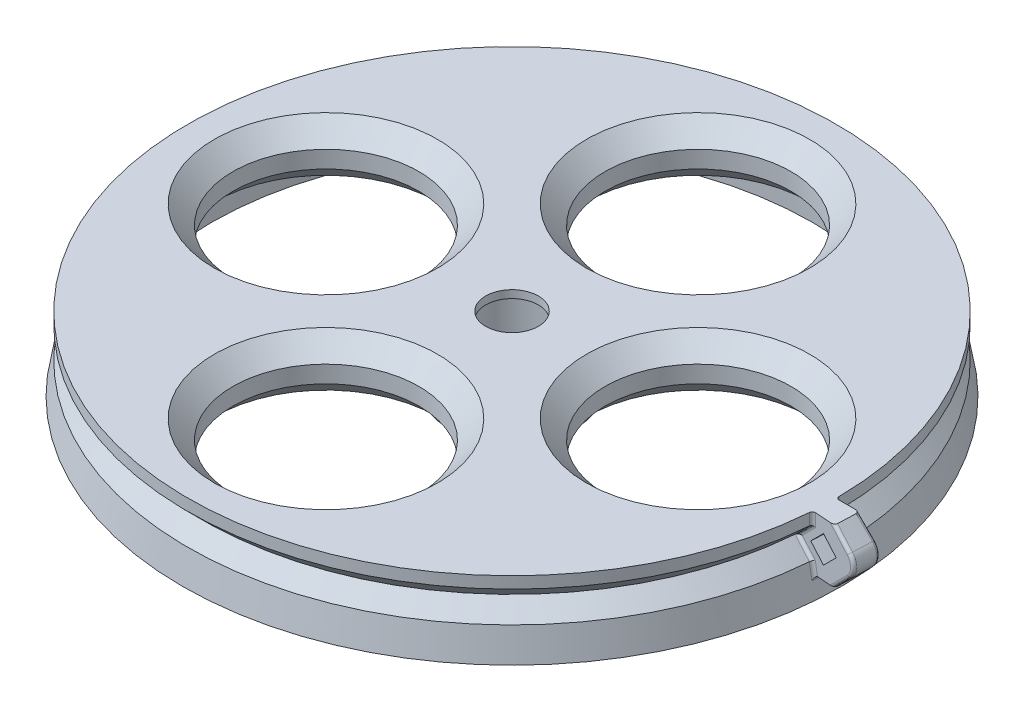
ISO-10303-21;
HEADER;
FILE_DESCRIPTION(('STEP AP214'),'2;1');
FILE_NAME('part.step','',(''),(''),'','','');
FILE_SCHEMA(('AUTOMOTIVE_DESIGN { 1 0 10303 214 1 1 1 1 }'));
ENDSEC;
DATA;
#1=APPLICATION_CONTEXT('core data for automotive mechanical design processes');
#2=APPLICATION_PROTOCOL_DEFINITION('international standard','automotive_design',2000,#1);
#3=PRODUCT_CONTEXT('',#1,'mechanical');
#4=PRODUCT('Part','Part','',(#3));
#5=PRODUCT_RELATED_PRODUCT_CATEGORY('part','',(#4));
#6=PRODUCT_DEFINITION_FORMATION('','',#4);
#7=PRODUCT_DEFINITION_CONTEXT('part definition',#1,'design');
#8=PRODUCT_DEFINITION('design','',#6,#7);
#9=PRODUCT_DEFINITION_SHAPE('','',#8);
#10=(LENGTH_UNIT() NAMED_UNIT(*) SI_UNIT(.MILLI.,.METRE.));
#11=(NAMED_UNIT(*) PLANE_ANGLE_UNIT() SI_UNIT($,.RADIAN.));
#12=(NAMED_UNIT(*) SI_UNIT($,.STERADIAN.) SOLID_ANGLE_UNIT());
#13=UNCERTAINTY_MEASURE_WITH_UNIT(LENGTH_MEASURE(1.E-05),#10,'distance_accuracy_value','');
#14=(GEOMETRIC_REPRESENTATION_CONTEXT(3) GLOBAL_UNCERTAINTY_ASSIGNED_CONTEXT((#13)) GLOBAL_UNIT_ASSIGNED_CONTEXT((#10,
#11,#12)) REPRESENTATION_CONTEXT('',''));
#15=CARTESIAN_POINT('',(0.,0.,0.));
#16=DIRECTION('',(0.,0.,1.));
#17=DIRECTION('',(1.,0.,0.));
#18=AXIS2_PLACEMENT_3D('',#15,#16,#17);
#19=CARTESIAN_POINT('',(0.,0.,0.));
#20=DIRECTION('',(0.,1.,0.));
#21=DIRECTION('',(0.,0.,1.));
#22=AXIS2_PLACEMENT_3D('',#19,#20,#21);
#23=CYLINDRICAL_SURFACE('',#22,2.9);
#24=CARTESIAN_POINT('',(0.,-2.75,0.));
#25=DIRECTION('',(0.,-1.,0.));
#26=DIRECTION('',(0.,0.,-1.));
#27=AXIS2_PLACEMENT_3D('',#24,#25,#26);
#28=CIRCLE('',#27,2.9);
#29=CARTESIAN_POINT('',(0.,-2.75,-2.9));
#30=VERTEX_POINT('',#29);
#31=EDGE_CURVE('E725',#30,#30,#28,.T.);
#32=ORIENTED_EDGE('',*,*,#31,.T.);
#33=EDGE_LOOP('',(#32));
#34=FACE_BOUND('',#33,.T.);
#35=CARTESIAN_POINT('',(0.,1.25,0.));
#36=DIRECTION('',(0.,1.,0.));
#37=DIRECTION('',(0.,0.,1.));
#38=AXIS2_PLACEMENT_3D('',#35,#36,#37);
#39=CIRCLE('',#38,2.9);
#40=CARTESIAN_POINT('',(0.,1.25,2.9));
#41=VERTEX_POINT('',#40);
#42=EDGE_CURVE('E723',#41,#41,#39,.T.);
#43=ORIENTED_EDGE('',*,*,#42,.T.);
#44=EDGE_LOOP('',(#43));
#45=FACE_BOUND('',#44,.T.);
#46=ADVANCED_FACE('F41',(#34,#45),#23,.F.);
#47=CARTESIAN_POINT('',(0.,-1.75,19.4));
#48=DIRECTION('',(0.,-1.,0.));
#49=DIRECTION('',(0.,0.,-1.));
#50=AXIS2_PLACEMENT_3D('',#47,#48,#49);
#51=PLANE('',#50);
#52=CARTESIAN_POINT('',(12.,-1.75,0.));
#53=DIRECTION('',(0.,-1.,0.));
#54=DIRECTION('',(0.,0.,-1.));
#55=AXIS2_PLACEMENT_3D('',#52,#53,#54);
#56=CIRCLE('',#55,7.2);
#57=CARTESIAN_POINT('',(12.,-1.75,-7.2));
#58=VERTEX_POINT('',#57);
#59=EDGE_CURVE('E306',#58,#58,#56,.F.);
#60=ORIENTED_EDGE('',*,*,#59,.T.);
#61=EDGE_LOOP('',(#60));
#62=FACE_BOUND('',#61,.T.);
#63=CARTESIAN_POINT('',(0.,-1.75,-12.));
#64=DIRECTION('',(0.,-1.,0.));
#65=DIRECTION('',(0.,0.,-1.));
#66=AXIS2_PLACEMENT_3D('',#63,#64,#65);
#67=CIRCLE('',#66,7.2);
#68=CARTESIAN_POINT('',(0.,-1.75,-19.2));
#69=VERTEX_POINT('',#68);
#70=EDGE_CURVE('E303',#69,#69,#67,.F.);
#71=ORIENTED_EDGE('',*,*,#70,.T.);
#72=EDGE_LOOP('',(#71));
#73=FACE_BOUND('',#72,.T.);
#74=CARTESIAN_POINT('',(-12.,-1.75,0.));
#75=DIRECTION('',(0.,-1.,0.));
#76=DIRECTION('',(0.,0.,-1.));
#77=AXIS2_PLACEMENT_3D('',#74,#75,#76);
#78=CIRCLE('',#77,7.19999999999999);
#79=CARTESIAN_POINT('',(-12.,-1.75,-7.19999999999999));
#80=VERTEX_POINT('',#79);
#81=EDGE_CURVE('E297',#80,#80,#78,.F.);
#82=ORIENTED_EDGE('',*,*,#81,.T.);
#83=EDGE_LOOP('',(#82));
#84=FACE_BOUND('',#83,.T.);
#85=CARTESIAN_POINT('',(0.,-1.75,12.));
#86=DIRECTION('',(0.,-1.,0.));
#87=DIRECTION('',(0.,0.,-1.));
#88=AXIS2_PLACEMENT_3D('',#85,#86,#87);
#89=CIRCLE('',#88,7.20000000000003);
#90=CARTESIAN_POINT('',(0.,-1.75,4.79999999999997));
#91=VERTEX_POINT('',#90);
#92=EDGE_CURVE('E300',#91,#91,#89,.F.);
#93=ORIENTED_EDGE('',*,*,#92,.T.);
#94=EDGE_LOOP('',(#93));
#95=FACE_BOUND('',#94,.T.);
#96=CARTESIAN_POINT('',(0.,-1.75,0.));
#97=DIRECTION('',(0.,1.,0.));
#98=DIRECTION('',(0.,0.,1.));
#99=AXIS2_PLACEMENT_3D('',#96,#97,#98);
#100=CIRCLE('',#99,19.4);
#101=CARTESIAN_POINT('',(0.,-1.75,19.4));
#102=VERTEX_POINT('',#101);
#103=EDGE_CURVE('E289',#102,#102,#100,.T.);
#104=ORIENTED_EDGE('',*,*,#103,.F.);
#105=EDGE_LOOP('',(#104));
#106=FACE_BOUND('',#105,.T.);
#107=CARTESIAN_POINT('',(0.,-1.75,0.));
#108=DIRECTION('',(0.,-1.,0.));
#109=DIRECTION('',(0.,0.,-1.));
#110=AXIS2_PLACEMENT_3D('',#107,#108,#109);
#111=CIRCLE('',#110,4.1);
#112=CARTESIAN_POINT('',(0.,-1.75,-4.1));
#113=VERTEX_POINT('',#112);
#114=EDGE_CURVE('E729',#113,#113,#111,.T.);
#115=ORIENTED_EDGE('',*,*,#114,.F.);
#116=EDGE_LOOP('',(#115));
#117=FACE_BOUND('',#116,.T.);
#118=ADVANCED_FACE('F712',(#62,#73,#84,#95,#106,#117),#51,.T.);
#119=CARTESIAN_POINT('',(0.,-1.,0.));
#120=DIRECTION('',(0.,-1.,0.));
#121=DIRECTION('',(0.,0.,-1.));
#122=AXIS2_PLACEMENT_3D('',#119,#120,#121);
#123=CONICAL_SURFACE('',#122,20.9,0.174532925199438);
#124=CARTESIAN_POINT('',(0.,-3.,0.));
#125=DIRECTION('',(0.,1.,0.));
#126=DIRECTION('',(0.,0.,1.));
#127=AXIS2_PLACEMENT_3D('',#124,#125,#126);
#128=CIRCLE('',#127,21.2526539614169);
#129=CARTESIAN_POINT('',(0.,-3.,21.2526539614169));
#130=VERTEX_POINT('',#129);
#131=EDGE_CURVE('E285',#130,#130,#128,.T.);
#132=ORIENTED_EDGE('',*,*,#131,.T.);
#133=EDGE_LOOP('',(#132));
#134=FACE_BOUND('',#133,.T.);
#135=CARTESIAN_POINT('',(0.,-1.,0.));
#136=DIRECTION('',(0.,1.,0.));
#137=DIRECTION('',(0.,0.,1.));
#138=AXIS2_PLACEMENT_3D('',#135,#136,#137);
#139=CIRCLE('',#138,20.9);
#140=CARTESIAN_POINT('',(20.8990558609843,-1.,-0.198655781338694));
#141=VERTEX_POINT('',#140);
#142=CARTESIAN_POINT('',(20.8342892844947,-1.,1.65601630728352));
#143=VERTEX_POINT('',#142);
#144=EDGE_CURVE('E279',#141,#143,#139,.T.);
#145=ORIENTED_EDGE('',*,*,#144,.F.);
#146=CARTESIAN_POINT('',(37.5586284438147,-17.3763182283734,0.));
#147=CARTESIAN_POINT('',(37.4177395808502,-17.5172090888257,0.));
#148=CARTESIAN_POINT('',(37.4172090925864,-17.5177395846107,-0.199246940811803));
#149=CARTESIAN_POINT('',(34.7223611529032,-14.5400942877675,0.));
#150=CARTESIAN_POINT('',(34.5815344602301,-14.680960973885,0.));
#151=CARTESIAN_POINT('',(34.5809421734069,-14.6815156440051,-0.19918563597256));
#152=CARTESIAN_POINT('',(31.8860926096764,-11.7038715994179,0.));
#153=CARTESIAN_POINT('',(31.745912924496,-11.8452939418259,0.));
#154=CARTESIAN_POINT('',(31.7446739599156,-11.8452929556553,-0.199120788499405));
#155=CARTESIAN_POINT('',(27.6316741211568,-7.44955325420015,0.));
#156=CARTESIAN_POINT('',(27.4911643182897,-7.59044615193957,0.));
#157=CARTESIAN_POINT('',(27.4902564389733,-7.59097461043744,-0.198979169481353));
#158=CARTESIAN_POINT('',(26.2135320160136,-6.03144975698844,0.));
#159=CARTESIAN_POINT('',(26.0731015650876,-6.17234519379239,0.));
#160=CARTESIAN_POINT('',(26.0721147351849,-6.1728711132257,-0.198924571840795));
#161=CARTESIAN_POINT('',(23.3772402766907,-3.19525028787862,0.));
#162=CARTESIAN_POINT('',(23.2369011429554,-3.33605355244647,0.));
#163=CARTESIAN_POINT('',(23.2358240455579,-3.33667164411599,-0.198794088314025));
#164=CARTESIAN_POINT('',(21.959090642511,-1.77715431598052,0.));
#165=CARTESIAN_POINT('',(21.818913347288,-1.91801275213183,0.));
#166=CARTESIAN_POINT('',(21.8176750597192,-1.91857567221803,-0.198718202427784));
#167=CARTESIAN_POINT('',(19.1227777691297,1.05902404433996,0.));
#168=CARTESIAN_POINT('',(18.9827293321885,0.918303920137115,0.));
#169=CARTESIAN_POINT('',(18.9813640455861,0.917602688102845,-0.198527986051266));
#170=CARTESIAN_POINT('',(17.704614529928,2.47710643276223,0.));
#171=CARTESIAN_POINT('',(17.5648033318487,2.33630954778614,0.));
#172=CARTESIAN_POINT('',(17.5632020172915,2.33568507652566,-0.198413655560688));
#173=CARTESIAN_POINT('',(14.8682626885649,5.31324583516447,0.));
#174=CARTESIAN_POINT('',(14.7287428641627,5.17257879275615,0.));
#175=CARTESIAN_POINT('',(14.7268538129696,5.1718244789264,-0.198113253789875));
#176=CARTESIAN_POINT('',(13.4500740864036,6.73130284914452,0.));
#177=CARTESIAN_POINT('',(13.311111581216,6.5903391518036,0.));
#178=CARTESIAN_POINT('',(13.3086676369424,6.58988149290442,-0.197927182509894));
#179=CARTESIAN_POINT('',(11.3227425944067,8.85833979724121,0.));
#180=CARTESIAN_POINT('',(11.1833147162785,8.71842372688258,0.));
#181=CARTESIAN_POINT('',(11.1813430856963,8.71691844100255,-0.19751072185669));
#182=CARTESIAN_POINT('',(10.6136239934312,9.56734402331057,0.));
#183=CARTESIAN_POINT('',(10.474429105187,9.42742081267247,0.));
#184=CARTESIAN_POINT('',(10.4722273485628,9.42592266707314,-0.19734900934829));
#185=CARTESIAN_POINT('',(9.19535678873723,10.9853224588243,0.));
#186=CARTESIAN_POINT('',(9.05646016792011,10.8456702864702,0.));
#187=CARTESIAN_POINT('',(9.05396836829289,10.8439011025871,-0.196940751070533));
#188=CARTESIAN_POINT('',(8.48620818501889,11.6942966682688,0.));
#189=CARTESIAN_POINT('',(8.34767225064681,11.5546271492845,0.));
#190=CARTESIAN_POINT('',(8.34482512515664,11.5528753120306,-0.196694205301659));
#191=CARTESIAN_POINT('',(7.06785197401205,13.112186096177,0.));
#192=CARTESIAN_POINT('',(6.92983540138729,12.9729138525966,0.));
#193=CARTESIAN_POINT('',(6.9264858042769,12.9707647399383,-0.1960344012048));
#194=CARTESIAN_POINT('',(6.35864436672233,13.8211013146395,0.));
#195=CARTESIAN_POINT('',(6.22136394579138,13.6816658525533,0.));
#196=CARTESIAN_POINT('',(6.21728972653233,13.6796799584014,-0.195621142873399));
#197=CARTESIAN_POINT('',(5.29472070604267,14.8843618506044,0.));
#198=CARTESIAN_POINT('',(5.15734656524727,14.7463139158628,0.));
#199=CARTESIAN_POINT('',(5.15339880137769,14.7429404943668,-0.19468418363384));
#200=CARTESIAN_POINT('',(4.94006077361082,15.2387633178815,0.));
#201=CARTESIAN_POINT('',(4.80313385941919,15.1007712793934,0.));
#202=CARTESIAN_POINT('',(4.79875235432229,15.0973419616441,-0.194319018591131));
#203=CARTESIAN_POINT('',(4.23065839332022,15.9474836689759,0.));
#204=CARTESIAN_POINT('',(4.09428547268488,15.8102592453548,0.));
#205=CARTESIAN_POINT('',(4.08939276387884,15.8060623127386,-0.19335592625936));
#206=CARTESIAN_POINT('',(3.87591594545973,16.3018025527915,0.));
#207=CARTESIAN_POINT('',(3.74004657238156,16.1648923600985,0.));
#208=CARTESIAN_POINT('',(3.73467962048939,16.1603811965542,-0.192757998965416));
#209=CARTESIAN_POINT('',(3.52110969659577,16.6560575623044,0.));
#210=CARTESIAN_POINT('',(3.3853594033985,16.5200884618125,0.));
#211=CARTESIAN_POINT('',(3.37991592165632,16.5146362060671,-0.191980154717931));
#212=(BOUNDED_SURFACE() B_SPLINE_SURFACE(3,2,((#146,#147,#148),(#149,#150,#151),(#152,#153,
#154),(#155,#156,#157),(#158,#159,#160),(#161,#162,#163),(#164,#165,#166),(#167,#168,#169),
(#170,#171,#172),(#173,#174,#175),(#176,#177,#178),(#179,#180,#181),(#182,#183,#184),(#185,#186,
#187),(#188,#189,#190),(#191,#192,#193),(#194,#195,#196),(#197,#198,#199),(#200,#201,#202),
(#203,#204,#205),(#206,#207,#208),(#209,#210,#211)),.UNSPECIFIED.,.F.,.F.,
.F.) B_SPLINE_SURFACE_WITH_KNOTS((4,2,2,2,2,2,2,2,2,2,4),(3,3),(0.,12.0331710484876,
18.0497565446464,24.066342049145,30.0829276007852,36.0995131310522,39.1078059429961,
42.1160987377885,45.1243915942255,46.6285380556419,48.132684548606),(0.,1.),
.UNSPECIFIED.) GEOMETRIC_REPRESENTATION_ITEM() RATIONAL_B_SPLINE_SURFACE(((1.,0.708436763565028,
1.),(1.,0.708544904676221,1.),(1.,0.708659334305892,1.),(1.,0.708909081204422,1.),(1.,
0.709005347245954,1.),(1.,0.70923535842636,1.),(1.,0.709369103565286,1.),(1.,0.709704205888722,
1.),(1.,0.70990556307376,1.),(1.,0.710434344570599,1.),(1.,0.710761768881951,1.),(1.,
0.711493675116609,1.),(1.,0.711777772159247,1.),(1.,0.712494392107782,1.),(1.,0.712926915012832,
1.),(1.,0.714082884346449,1.),(1.,0.714806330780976,1.),(1.,0.716442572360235,1.),(1.,
0.717079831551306,1.),(1.,0.718756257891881,1.),(1.,0.719795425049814,1.),(1.,0.721144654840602,1.))) REPRESENTATION_ITEM('') SURFACE());
#213=CARTESIAN_POINT('',(20.8990558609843,-1.,-0.198655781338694));
#214=CARTESIAN_POINT('',(20.899056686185,-0.999999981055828,-0.198568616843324));
#215=CARTESIAN_POINT('',(20.8990574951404,-0.999999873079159,-0.198481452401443));
#216=CARTESIAN_POINT('',(20.8990590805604,-0.999999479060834,-0.198307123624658));
#217=CARTESIAN_POINT('',(20.8990598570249,-0.999999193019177,-0.198219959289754));
#218=CARTESIAN_POINT('',(20.8990606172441,-0.999998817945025,-0.198132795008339));
#219=B_SPLINE_CURVE_WITH_KNOTS('',3,(#213,#214,#215,#216,#217,#218),.UNSPECIFIED.,.F.,.F.,(4,2,
4),(0.,0.000261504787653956,0.000523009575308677),.UNSPECIFIED.);
#220=CARTESIAN_POINT('',(20.8990608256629,-1.,-0.198132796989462));
#221=VERTEX_POINT('',#220);
#222=EDGE_CURVE('E1043',#141,#221,#219,.T.);
#223=ORIENTED_EDGE('',*,*,#222,.T.);
#224=CARTESIAN_POINT('',(27.4247918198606,-36.8563149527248,0.));
#225=CARTESIAN_POINT('',(27.2292398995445,-36.8907969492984,0.));
#226=CARTESIAN_POINT('',(27.2278355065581,-36.8910445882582,-0.198563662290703));
#227=CARTESIAN_POINT('',(26.3810288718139,-30.9369997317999,0.));
#228=CARTESIAN_POINT('',(26.1856450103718,-30.9721199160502,0.));
#229=CARTESIAN_POINT('',(26.1840729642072,-30.9717293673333,-0.198508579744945));
#230=CARTESIAN_POINT('',(25.3372632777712,-25.0176849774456,0.));
#231=CARTESIAN_POINT('',(25.1419999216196,-25.0531430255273,0.));
#232=CARTESIAN_POINT('',(25.1403078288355,-25.052414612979,-0.198448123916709));
#233=CARTESIAN_POINT('',(23.2497230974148,-13.1790570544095,0.));
#234=CARTESIAN_POINT('',(23.0546047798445,-13.2145426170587,0.));
#235=CARTESIAN_POINT('',(23.0527687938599,-13.2137866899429,-0.198308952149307));
#236=CARTESIAN_POINT('',(22.2059485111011,-7.2597438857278,0.));
#237=CARTESIAN_POINT('',(22.01094905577,-7.29545410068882,0.));
#238=CARTESIAN_POINT('',(22.008994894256,-7.29447352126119,-0.198230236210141));
#239=CARTESIAN_POINT('',(20.1183866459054,4.57888021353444,0.));
#240=CARTESIAN_POINT('',(19.9235864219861,4.54308547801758,0.));
#241=CARTESIAN_POINT('',(19.9214347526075,4.54415057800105,-0.198047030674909));
#242=CARTESIAN_POINT('',(19.0745993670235,10.498191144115,0.));
#243=CARTESIAN_POINT('',(18.8800124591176,10.4617824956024,0.));
#244=CARTESIAN_POINT('',(18.8776485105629,10.4634615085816,-0.197942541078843));
#245=CARTESIAN_POINT('',(16.9870025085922,22.3368090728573,0.));
#246=CARTESIAN_POINT('',(16.7926028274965,22.3007870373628,0.));
#247=CARTESIAN_POINT('',(16.7900544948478,22.3020794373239,-0.197688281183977));
#248=CARTESIAN_POINT('',(15.9431929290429,28.2561160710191,0.));
#249=CARTESIAN_POINT('',(15.7490002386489,28.2197725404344,0.));
#250=CARTESIAN_POINT('',(15.7462467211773,28.2213864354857,-0.197538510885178));
#251=CARTESIAN_POINT('',(14.8993673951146,34.1754202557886,0.));
#252=CARTESIAN_POINT('',(14.7049928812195,34.1411436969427,0.));
#253=CARTESIAN_POINT('',(14.7024235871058,34.1406906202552,-0.197356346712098));
#254=(BOUNDED_SURFACE() B_SPLINE_SURFACE(3,2,((#224,#225,#226),(#227,#228,#229),(#230,#231,
#232),(#233,#234,#235),(#236,#237,#238),(#239,#240,#241),(#242,#243,#244),(#245,#246,#247),
(#248,#249,#250),(#251,#252,#253)),.UNSPECIFIED.,.F.,.F.,.F.) B_SPLINE_SURFACE_WITH_KNOTS((4,2,
2,2,4),(3,3),(0.,18.0319051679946,36.063810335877,54.0957155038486,72.1276206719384),(0.,1.),
.UNSPECIFIED.) GEOMETRIC_REPRESENTATION_ITEM() RATIONAL_B_SPLINE_SURFACE(((1.,0.70964134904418,
1.),(1.,0.709738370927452,1.),(1.,0.70984484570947,1.),(1.,0.710089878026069,1.),(1.,
0.710228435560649,1.),(1.,0.710550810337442,1.),(1.,0.710734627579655,1.),(1.,0.711181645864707,
1.),(1.,0.711444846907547,1.),(1.,0.711764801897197,1.))) REPRESENTATION_ITEM('') SURFACE());
#255=CARTESIAN_POINT('',(14.7024235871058,34.1406906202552,-0.197356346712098));
#256=CARTESIAN_POINT('',(15.7462467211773,28.2213864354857,-0.197538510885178));
#257=CARTESIAN_POINT('',(16.7900544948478,22.3020794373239,-0.197688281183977));
#258=CARTESIAN_POINT('',(18.8776485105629,10.4634615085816,-0.197942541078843));
#259=CARTESIAN_POINT('',(19.9214347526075,4.54415057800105,-0.198047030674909));
#260=CARTESIAN_POINT('',(22.008994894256,-7.29447352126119,-0.198230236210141));
#261=CARTESIAN_POINT('',(23.0527687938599,-13.2137866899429,-0.198308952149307));
#262=CARTESIAN_POINT('',(25.1403078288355,-25.052414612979,-0.198448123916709));
#263=CARTESIAN_POINT('',(26.1840729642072,-30.9717293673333,-0.198508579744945));
#264=CARTESIAN_POINT('',(27.2278355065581,-36.8910445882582,-0.198563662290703));
#265=B_SPLINE_CURVE_WITH_KNOTS('',3,(#255,#256,#257,#258,#259,#260,#261,#262,#263,#264),
.UNSPECIFIED.,.F.,.F.,(4,2,2,2,4),(0.,18.0319051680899,36.0638103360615,54.0957155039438,
72.1276206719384),.UNSPECIFIED.);
#266=CARTESIAN_POINT('',(21.0727028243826,-1.98472963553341,-0.198148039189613));
#267=VERTEX_POINT('',#266);
#268=EDGE_CURVE('E1093',#221,#267,#265,.T.);
#269=ORIENTED_EDGE('',*,*,#268,.T.);
#270=CARTESIAN_POINT('',(0.,-1.98472963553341,0.));
#271=DIRECTION('',(0.,1.,0.));
#272=DIRECTION('',(0.,0.,1.));
#273=AXIS2_PLACEMENT_3D('',#270,#271,#272);
#274=CIRCLE('',#273,21.0736344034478);
#275=CARTESIAN_POINT('',(21.0075486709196,-1.98472963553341,1.66762280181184));
#276=VERTEX_POINT('',#275);
#277=EDGE_CURVE('E353',#267,#276,#274,.F.);
#278=ORIENTED_EDGE('',*,*,#277,.T.);
#279=CARTESIAN_POINT('',(19.2619249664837,9.16911269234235,1.34692500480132));
#280=CARTESIAN_POINT('',(19.0674375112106,9.13473372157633,1.33332511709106));
#281=CARTESIAN_POINT('',(19.0516447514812,9.13438305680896,1.53066418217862));
#282=CARTESIAN_POINT('',(19.5700418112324,7.41752218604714,1.36847063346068));
#283=CARTESIAN_POINT('',(19.3755476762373,7.38299514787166,1.35487027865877));
#284=CARTESIAN_POINT('',(19.3597589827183,7.38279255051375,1.55224234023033));
#285=CARTESIAN_POINT('',(19.8781578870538,5.6659315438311,1.39001620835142));
#286=CARTESIAN_POINT('',(19.6836313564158,5.63141152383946,1.37641358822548));
#287=CARTESIAN_POINT('',(19.6678725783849,5.63120190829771,1.57381888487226));
#288=CARTESIAN_POINT('',(20.4943886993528,2.16275002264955,1.43310726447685));
#289=CARTESIAN_POINT('',(20.299803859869,2.12822265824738,1.41950056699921));
#290=CARTESIAN_POINT('',(20.2840986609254,2.12802038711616,1.61696916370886));
#291=CARTESIAN_POINT('',(20.8025034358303,0.411159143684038,1.45465274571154));
#292=CARTESIAN_POINT('',(20.6078885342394,0.376641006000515,1.44104394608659));
#293=CARTESIAN_POINT('',(20.5922111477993,0.376429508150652,1.63854289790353));
#294=CARTESIAN_POINT('',(22.1518560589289,-7.25974386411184,1.54900867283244));
#295=CARTESIAN_POINT('',(21.9573449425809,-7.29553127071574,1.53540713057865));
#296=CARTESIAN_POINT('',(21.9415543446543,-7.29447349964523,1.73301748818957));
#297=CARTESIAN_POINT('',(23.1930880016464,-13.1790570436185,1.62181870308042));
#298=CARTESIAN_POINT('',(22.9984519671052,-13.2145830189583,1.60820842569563));
#299=CARTESIAN_POINT('',(22.9827801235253,-13.2137866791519,1.80590587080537));
#300=CARTESIAN_POINT('',(25.275542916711,-25.0176849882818,1.76743813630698));
#301=CARTESIAN_POINT('',(25.0807475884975,-25.0530989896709,1.75381672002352));
#302=CARTESIAN_POINT('',(25.0652242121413,-25.0524146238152,1.95166380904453));
#303=CARTESIAN_POINT('',(26.3167658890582,-30.9369997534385,1.84024753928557));
#304=CARTESIAN_POINT('',(26.1218420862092,-30.9720282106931,1.82661713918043));
#305=CARTESIAN_POINT('',(26.1064425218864,-30.9717293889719,2.0245333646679));
#306=CARTESIAN_POINT('',(27.3579864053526,-36.8563149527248,1.91305677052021));
#307=CARTESIAN_POINT('',(27.162910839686,-36.8907969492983,1.89941575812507));
#308=CARTESIAN_POINT('',(27.1476587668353,-36.8910445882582,2.09739776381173));
#309=(BOUNDED_SURFACE() B_SPLINE_SURFACE(3,2,((#279,#280,#281),(#282,#283,#284),(#285,#286,
#287),(#288,#289,#290),(#291,#292,#293),(#294,#295,#296),(#297,#298,#299),(#300,#301,#302),
(#303,#304,#305),(#306,#307,#308)),.UNSPECIFIED.,.F.,.F.,.F.) B_SPLINE_SURFACE_WITH_KNOTS((4,2,
2,2,4),(3,3),(0.,5.3358434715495,10.6716869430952,28.703592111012,46.7354972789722),(0.,1.),
.UNSPECIFIED.) GEOMETRIC_REPRESENTATION_ITEM() RATIONAL_B_SPLINE_SURFACE(((1.,0.710703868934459,
1.),(1.,0.710646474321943,1.),(1.,0.710591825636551,1.),(1.,0.710487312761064,1.),(1.,
0.710437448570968,1.),(1.,0.710228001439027,1.),(1.,0.710089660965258,1.),(1.,0.709845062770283,
1.),(1.,0.709738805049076,1.),(1.,0.709641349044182,1.))) REPRESENTATION_ITEM('') SURFACE());
#310=CARTESIAN_POINT('',(27.1476587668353,-36.8910445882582,2.09739776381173));
#311=CARTESIAN_POINT('',(26.1064425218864,-30.9717293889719,2.0245333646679));
#312=CARTESIAN_POINT('',(25.0652242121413,-25.0524146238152,1.95166380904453));
#313=CARTESIAN_POINT('',(22.9827801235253,-13.2137866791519,1.80590587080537));
#314=CARTESIAN_POINT('',(21.9415543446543,-7.29447349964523,1.73301748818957));
#315=CARTESIAN_POINT('',(20.5922111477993,0.376429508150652,1.63854289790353));
#316=CARTESIAN_POINT('',(20.2840986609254,2.12802038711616,1.61696916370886));
#317=CARTESIAN_POINT('',(19.6678725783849,5.63120190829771,1.57381888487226));
#318=CARTESIAN_POINT('',(19.3597589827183,7.38279255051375,1.55224234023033));
#319=CARTESIAN_POINT('',(19.0516447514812,9.13438305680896,1.53066418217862));
#320=B_SPLINE_CURVE_WITH_KNOTS('',3,(#310,#311,#312,#313,#314,#315,#316,#317,#318,#319),
.UNSPECIFIED.,.F.,.F.,(4,2,2,2,4),(0.,18.0319051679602,36.0638103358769,41.3996538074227,
46.7354972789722),.UNSPECIFIED.);
#321=CARTESIAN_POINT('',(20.8343307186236,-1.,1.65549494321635));
#322=VERTEX_POINT('',#321);
#323=EDGE_CURVE('E350',#276,#322,#320,.T.);
#324=ORIENTED_EDGE('',*,*,#323,.T.);
#325=CARTESIAN_POINT('',(37.3121638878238,-17.5177395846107,2.80885414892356));
#326=CARTESIAN_POINT('',(37.3265918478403,-17.5172090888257,2.6101295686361));
#327=CARTESIAN_POINT('',(37.4671375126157,-17.3763182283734,2.61995747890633));
#328=CARTESIAN_POINT('',(34.4828102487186,-14.6815156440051,2.61094501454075));
#329=CARTESIAN_POINT('',(34.4972955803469,-14.680960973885,2.41228590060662));
#330=CARTESIAN_POINT('',(34.6377792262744,-14.5400942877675,2.42210947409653));
#331=CARTESIAN_POINT('',(31.6534555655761,-11.8452929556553,2.41303225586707));
#332=CARTESIAN_POINT('',(31.6685814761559,-11.8452939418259,2.2144829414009));
#333=CARTESIAN_POINT('',(31.8084196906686,-11.7038715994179,2.22426138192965));
#334=CARTESIAN_POINT('',(27.4094114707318,-7.59097461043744,2.11611781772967));
#335=CARTESIAN_POINT('',(27.4241972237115,-7.59044615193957,1.91768668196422));
#336=CARTESIAN_POINT('',(27.5643647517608,-7.44955325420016,1.92748815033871));
#337=CARTESIAN_POINT('',(25.9947280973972,-6.1728711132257,2.01713878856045));
#338=CARTESIAN_POINT('',(26.0095888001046,-6.17234519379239,1.81876762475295));
#339=CARTESIAN_POINT('',(26.1496771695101,-6.03144975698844,1.82856355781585));
#340=CARTESIAN_POINT('',(23.1653555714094,-3.33667164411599,1.81915898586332));
#341=CARTESIAN_POINT('',(23.1802972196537,-3.33605355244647,1.62092428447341));
#342=CARTESIAN_POINT('',(23.3202944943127,-3.19525028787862,1.63071384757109));
#343=CARTESIAN_POINT('',(21.7506664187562,-1.91857567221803,1.72015821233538));
#344=CARTESIAN_POINT('',(21.7657635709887,-1.91801275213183,1.52201045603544));
#345=CARTESIAN_POINT('',(21.9055994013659,-1.77715431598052,1.53178872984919));
#346=CARTESIAN_POINT('',(18.9212777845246,0.917602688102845,1.52211740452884));
#347=CARTESIAN_POINT('',(18.9364883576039,0.918303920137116,1.32416826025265));
#348=CARTESIAN_POINT('',(19.0761956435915,1.05902404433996,1.33393754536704));
#349=CARTESIAN_POINT('',(17.5065783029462,2.33568507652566,1.42307737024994));
#350=CARTESIAN_POINT('',(17.5220163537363,2.33630954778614,1.22525874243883));
#351=CARTESIAN_POINT('',(17.6614869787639,2.47710643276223,1.23501147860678));
#352=CARTESIAN_POINT('',(14.6771602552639,5.1718244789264,1.22492405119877));
#353=CARTESIAN_POINT('',(14.6928643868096,5.17257879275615,1.02742516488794));
#354=CARTESIAN_POINT('',(14.8320443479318,5.31324583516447,1.03715757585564));
#355=CARTESIAN_POINT('',(13.2624416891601,6.58988149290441,1.12581076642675));
#356=CARTESIAN_POINT('',(13.2786863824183,6.59033915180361,0.92853620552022));
#357=CARTESIAN_POINT('',(13.4173103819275,6.73130284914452,0.938229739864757));
#358=CARTESIAN_POINT('',(11.1403282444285,8.71691844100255,0.977000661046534));
#359=CARTESIAN_POINT('',(11.1560727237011,8.71842372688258,0.780108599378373));
#360=CARTESIAN_POINT('',(11.2951609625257,8.85833979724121,0.78983459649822));
#361=CARTESIAN_POINT('',(10.432951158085,9.42592266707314,0.927373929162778));
#362=CARTESIAN_POINT('',(10.4489139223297,9.42742081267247,0.730659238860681));
#363=CARTESIAN_POINT('',(10.5877697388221,9.56734402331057,0.740368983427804));
#364=CARTESIAN_POINT('',(9.01817546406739,10.8439011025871,0.828033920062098));
#365=CARTESIAN_POINT('',(9.03439908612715,10.8456702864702,0.631746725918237));
#366=CARTESIAN_POINT('',(9.17295736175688,10.9853224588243,0.641435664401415));
#367=CARTESIAN_POINT('',(8.31077685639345,11.5528753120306,0.778320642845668));
#368=CARTESIAN_POINT('',(8.32733774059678,11.5546271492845,0.582304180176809));
#369=CARTESIAN_POINT('',(8.46553620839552,11.6942966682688,0.591967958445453));
#370=CARTESIAN_POINT('',(6.89593856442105,12.9707647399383,0.67872409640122));
#371=CARTESIAN_POINT('',(6.91295467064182,12.9729138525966,0.483400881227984));
#372=CARTESIAN_POINT('',(7.05063504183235,13.112186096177,0.493028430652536));
#373=CARTESIAN_POINT('',(6.18849888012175,13.6796799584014,0.628840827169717));
#374=CARTESIAN_POINT('',(6.20620901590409,13.6816658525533,0.433980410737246));
#375=CARTESIAN_POINT('',(6.34315502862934,13.8211013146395,0.443556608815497));
#376=CARTESIAN_POINT('',(5.1272648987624,14.7429404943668,0.553692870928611));
#377=CARTESIAN_POINT('',(5.14478352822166,14.7463139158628,0.359758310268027));
#378=CARTESIAN_POINT('',(5.28182303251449,14.8843618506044,0.369341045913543));
#379=CARTESIAN_POINT('',(4.77350782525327,15.0973419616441,0.528589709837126));
#380=CARTESIAN_POINT('',(4.79143366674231,15.1007712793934,0.335049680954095));
#381=CARTESIAN_POINT('',(4.92802703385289,15.2387633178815,0.344601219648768));
#382=CARTESIAN_POINT('',(4.06594338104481,15.8060623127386,0.478146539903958));
#383=CARTESIAN_POINT('',(4.08431199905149,15.8102592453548,0.285602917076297));
#384=CARTESIAN_POINT('',(4.22035272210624,15.9474836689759,0.295115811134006));
#385=CARTESIAN_POINT('',(3.71213601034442,16.1603811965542,0.452806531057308));
#386=CARTESIAN_POINT('',(3.73093600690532,16.1648923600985,0.260892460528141));
#387=CARTESIAN_POINT('',(3.86647440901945,16.3018025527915,0.270370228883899));
#388=CARTESIAN_POINT('',(3.35829075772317,16.5146362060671,0.427283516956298));
#389=CARTESIAN_POINT('',(3.3771128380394,16.5200884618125,0.236150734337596));
#390=CARTESIAN_POINT('',(3.51253245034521,16.6560575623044,0.245620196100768));
#391=(BOUNDED_SURFACE() B_SPLINE_SURFACE(3,2,((#325,#326,#327),(#328,#329,#330),(#331,#332,
#333),(#334,#335,#336),(#337,#338,#339),(#340,#341,#342),(#343,#344,#345),(#346,#347,#348),
(#349,#350,#351),(#352,#353,#354),(#355,#356,#357),(#358,#359,#360),(#361,#362,#363),(#364,#365,
#366),(#367,#368,#369),(#370,#371,#372),(#373,#374,#375),(#376,#377,#378),(#379,#380,#381),
(#382,#383,#384),(#385,#386,#387),(#388,#389,#390)),.UNSPECIFIED.,.F.,.F.,
.F.) B_SPLINE_SURFACE_WITH_KNOTS((4,2,2,2,2,2,2,2,2,2,4),(3,3),(0.,12.0331710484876,
18.0497565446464,24.066342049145,30.0829276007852,36.0995131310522,39.1078059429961,
42.1160987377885,45.1243915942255,46.6285380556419,48.132684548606),(0.,1.),
.UNSPECIFIED.) GEOMETRIC_REPRESENTATION_ITEM() RATIONAL_B_SPLINE_SURFACE(((1.,0.708436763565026,
1.),(1.,0.708544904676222,1.),(1.,0.708659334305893,1.),(1.,0.708909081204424,1.),(1.,
0.709005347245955,1.),(1.,0.709235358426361,1.),(1.,0.709369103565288,1.),(1.,0.709704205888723,
1.),(1.,0.709905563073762,1.),(1.,0.7104343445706,1.),(1.,0.710761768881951,1.),(1.,
0.711493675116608,1.),(1.,0.711777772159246,1.),(1.,0.712494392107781,1.),(1.,0.712926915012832,
1.),(1.,0.714082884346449,1.),(1.,0.714806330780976,1.),(1.,0.716442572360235,1.),(1.,
0.717079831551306,1.),(1.,0.718756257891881,1.),(1.,0.719795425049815,1.),(1.,0.721144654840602,1.))) REPRESENTATION_ITEM('') SURFACE());
#392=CARTESIAN_POINT('',(20.8343307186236,-1.,1.65549494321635));
#393=CARTESIAN_POINT('',(20.8343237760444,-0.999999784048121,1.65558183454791));
#394=CARTESIAN_POINT('',(20.8343168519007,-0.999999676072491,1.65566872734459));
#395=CARTESIAN_POINT('',(20.8343030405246,-0.999999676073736,1.655842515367));
#396=CARTESIAN_POINT('',(20.8342961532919,-0.999999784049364,1.6559294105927));
#397=CARTESIAN_POINT('',(20.8342892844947,-0.999999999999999,1.65601630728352));
#398=B_SPLINE_CURVE_WITH_KNOTS('',3,(#392,#393,#394,#395,#396,#397),.UNSPECIFIED.,.F.,.F.,(4,2,
4),(0.,0.00026150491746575,0.000523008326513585),.UNSPECIFIED.);
#399=EDGE_CURVE('E542',#322,#143,#398,.T.);
#400=ORIENTED_EDGE('',*,*,#399,.T.);
#401=EDGE_LOOP('',(#145,#223,#269,#278,#324,#400));
#402=FACE_BOUND('',#401,.T.);
#403=ADVANCED_FACE('F357',(#134,#402),#123,.T.);
#404=CARTESIAN_POINT('',(0.,0.,0.));
#405=DIRECTION('',(0.,-1.,0.));
#406=DIRECTION('',(0.,0.,-1.));
#407=AXIS2_PLACEMENT_3D('',#404,#405,#406);
#408=CONICAL_SURFACE('',#407,19.9,0.785398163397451);
#409=CARTESIAN_POINT('',(0.,0.,0.));
#410=DIRECTION('',(0.,1.,0.));
#411=DIRECTION('',(0.,0.,1.));
#412=AXIS2_PLACEMENT_3D('',#409,#410,#411);
#413=CIRCLE('',#412,19.9);
#414=CARTESIAN_POINT('',(19.8990090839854,0.,-0.198588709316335));
#415=VERTEX_POINT('',#414);
#416=CARTESIAN_POINT('',(19.8366832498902,0.,1.58618966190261));
#417=VERTEX_POINT('',#416);
#418=EDGE_CURVE('E277',#415,#417,#413,.T.);
#419=ORIENTED_EDGE('',*,*,#418,.F.);
#420=CARTESIAN_POINT('',(3.37991592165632,16.5146362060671,-0.191980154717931));
#421=CARTESIAN_POINT('',(3.73467962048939,16.1603811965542,-0.192757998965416));
#422=CARTESIAN_POINT('',(4.08939276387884,15.8060623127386,-0.19335592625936));
#423=CARTESIAN_POINT('',(4.79875235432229,15.0973419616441,-0.194319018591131));
#424=CARTESIAN_POINT('',(5.15339880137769,14.7429404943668,-0.19468418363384));
#425=CARTESIAN_POINT('',(6.21728972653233,13.6796799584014,-0.195621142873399));
#426=CARTESIAN_POINT('',(6.9264858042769,12.9707647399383,-0.1960344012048));
#427=CARTESIAN_POINT('',(8.34482512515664,11.5528753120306,-0.196694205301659));
#428=CARTESIAN_POINT('',(9.05396836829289,10.8439011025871,-0.196940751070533));
#429=CARTESIAN_POINT('',(10.4722273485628,9.42592266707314,-0.19734900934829));
#430=CARTESIAN_POINT('',(11.1813430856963,8.71691844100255,-0.19751072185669));
#431=CARTESIAN_POINT('',(13.3086676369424,6.58988149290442,-0.197927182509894));
#432=CARTESIAN_POINT('',(14.7268538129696,5.1718244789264,-0.198113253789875));
#433=CARTESIAN_POINT('',(17.5632020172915,2.33568507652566,-0.198413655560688));
#434=CARTESIAN_POINT('',(18.9813640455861,0.917602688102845,-0.198527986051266));
#435=CARTESIAN_POINT('',(21.8176750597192,-1.91857567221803,-0.198718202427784));
#436=CARTESIAN_POINT('',(23.2358240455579,-3.33667164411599,-0.198794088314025));
#437=CARTESIAN_POINT('',(26.0721147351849,-6.17287111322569,-0.198924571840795));
#438=CARTESIAN_POINT('',(27.4902564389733,-7.59097461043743,-0.198979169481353));
#439=CARTESIAN_POINT('',(31.7446739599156,-11.8452929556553,-0.199120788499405));
#440=CARTESIAN_POINT('',(34.5809421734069,-14.6815156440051,-0.19918563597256));
#441=CARTESIAN_POINT('',(37.4172090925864,-17.5177395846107,-0.199246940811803));
#442=B_SPLINE_CURVE_WITH_KNOTS('',3,(#420,#421,#422,#423,#424,#425,#426,#427,#428,#429,#430,
#431,#432,#433,#434,#435,#436,#437,#438,#439,#440,#441),.UNSPECIFIED.,.F.,.F.,(4,2,2,2,2,2,2,2,
2,2,4),(0.,1.50414649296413,3.00829295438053,6.01658581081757,9.02487860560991,12.0331714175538,
18.0497569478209,24.066342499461,30.0829280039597,36.0995135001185,48.132684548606),.UNSPECIFIED.);
#443=EDGE_CURVE('E1018',#415,#141,#442,.T.);
#444=ORIENTED_EDGE('',*,*,#443,.T.);
#445=ORIENTED_EDGE('',*,*,#144,.T.);
#446=CARTESIAN_POINT('',(37.3121638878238,-17.5177395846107,2.80885414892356));
#447=CARTESIAN_POINT('',(34.4828102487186,-14.6815156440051,2.61094501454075));
#448=CARTESIAN_POINT('',(31.6534555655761,-11.8452929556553,2.41303225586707));
#449=CARTESIAN_POINT('',(27.4094114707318,-7.59097461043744,2.11611781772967));
#450=CARTESIAN_POINT('',(25.9947280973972,-6.1728711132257,2.01713878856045));
#451=CARTESIAN_POINT('',(23.1653555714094,-3.33667164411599,1.81915898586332));
#452=CARTESIAN_POINT('',(21.7506664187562,-1.91857567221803,1.72015821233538));
#453=CARTESIAN_POINT('',(18.9212777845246,0.917602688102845,1.52211740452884));
#454=CARTESIAN_POINT('',(17.5065783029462,2.33568507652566,1.42307737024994));
#455=CARTESIAN_POINT('',(14.6771602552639,5.1718244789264,1.22492405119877));
#456=CARTESIAN_POINT('',(13.2624416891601,6.58988149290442,1.12581076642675));
#457=CARTESIAN_POINT('',(11.1403282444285,8.71691844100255,0.977000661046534));
#458=CARTESIAN_POINT('',(10.432951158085,9.42592266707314,0.927373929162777));
#459=CARTESIAN_POINT('',(9.01817546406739,10.8439011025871,0.828033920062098));
#460=CARTESIAN_POINT('',(8.31077685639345,11.5528753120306,0.778320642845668));
#461=CARTESIAN_POINT('',(6.89593856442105,12.9707647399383,0.67872409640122));
#462=CARTESIAN_POINT('',(6.18849888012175,13.6796799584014,0.628840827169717));
#463=CARTESIAN_POINT('',(5.1272648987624,14.7429404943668,0.553692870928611));
#464=CARTESIAN_POINT('',(4.77350782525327,15.0973419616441,0.528589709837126));
#465=CARTESIAN_POINT('',(4.06594338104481,15.8060623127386,0.478146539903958));
#466=CARTESIAN_POINT('',(3.71213601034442,16.1603811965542,0.452806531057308));
#467=CARTESIAN_POINT('',(3.35829075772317,16.5146362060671,0.427283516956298));
#468=B_SPLINE_CURVE_WITH_KNOTS('',3,(#446,#447,#448,#449,#450,#451,#452,#453,#454,#455,#456,
#457,#458,#459,#460,#461,#462,#463,#464,#465,#466,#467),.UNSPECIFIED.,.F.,.F.,(4,2,2,2,2,2,2,2,
2,2,4),(0.,12.0331710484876,18.0497565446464,24.066342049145,30.0829276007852,36.0995131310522,
39.1078059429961,42.1160987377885,45.1243915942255,46.6285380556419,48.132684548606),.UNSPECIFIED.);
#469=EDGE_CURVE('E1015',#143,#417,#468,.T.);
#470=ORIENTED_EDGE('',*,*,#469,.T.);
#471=EDGE_LOOP('',(#419,#444,#445,#470));
#472=FACE_BOUND('',#471,.T.);
#473=ADVANCED_FACE('F422',(#472),#408,.T.);
#474=CARTESIAN_POINT('',(0.,0.999999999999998,0.));
#475=DIRECTION('',(0.,1.,0.));
#476=DIRECTION('',(0.,0.,1.));
#477=AXIS2_PLACEMENT_3D('',#474,#475,#476);
#478=CONICAL_SURFACE('',#477,20.9,0.78539816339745);
#479=CARTESIAN_POINT('',(0.,0.999999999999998,0.));
#480=DIRECTION('',(0.,1.,0.));
#481=DIRECTION('',(0.,0.,1.));
#482=AXIS2_PLACEMENT_3D('',#479,#480,#481);
#483=CIRCLE('',#482,20.9);
#484=CARTESIAN_POINT('',(20.8990558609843,0.999999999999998,-0.198655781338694));
#485=VERTEX_POINT('',#484);
#486=CARTESIAN_POINT('',(20.8342892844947,0.999999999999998,1.65601630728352));
#487=VERTEX_POINT('',#486);
#488=EDGE_CURVE('E271',#485,#487,#483,.T.);
#489=ORIENTED_EDGE('',*,*,#488,.F.);
#490=CARTESIAN_POINT('',(37.4172090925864,17.5177395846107,-0.199246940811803));
#491=CARTESIAN_POINT('',(37.4177395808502,17.5172090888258,0.));
#492=CARTESIAN_POINT('',(37.5586284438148,17.3763182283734,0.));
#493=CARTESIAN_POINT('',(34.5809421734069,14.6815156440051,-0.19918563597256));
#494=CARTESIAN_POINT('',(34.5815344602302,14.680960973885,0.));
#495=CARTESIAN_POINT('',(34.7223611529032,14.5400942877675,0.));
#496=CARTESIAN_POINT('',(31.7446739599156,11.8452929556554,-0.199120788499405));
#497=CARTESIAN_POINT('',(31.745912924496,11.8452939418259,0.));
#498=CARTESIAN_POINT('',(31.8860926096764,11.7038715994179,0.));
#499=CARTESIAN_POINT('',(27.4902564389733,7.59097461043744,-0.198979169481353));
#500=CARTESIAN_POINT('',(27.4911643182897,7.59044615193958,0.));
#501=CARTESIAN_POINT('',(27.6316741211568,7.44955325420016,0.));
#502=CARTESIAN_POINT('',(26.0721147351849,6.1728711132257,-0.198924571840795));
#503=CARTESIAN_POINT('',(26.0731015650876,6.1723451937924,0.));
#504=CARTESIAN_POINT('',(26.2135320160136,6.03144975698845,0.));
#505=CARTESIAN_POINT('',(23.2358240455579,3.33667164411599,-0.198794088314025));
#506=CARTESIAN_POINT('',(23.2369011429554,3.33605355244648,0.));
#507=CARTESIAN_POINT('',(23.3772402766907,3.19525028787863,0.));
#508=CARTESIAN_POINT('',(21.8176750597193,1.91857567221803,-0.198718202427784));
#509=CARTESIAN_POINT('',(21.818913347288,1.91801275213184,0.));
#510=CARTESIAN_POINT('',(21.959090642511,1.77715431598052,0.));
#511=CARTESIAN_POINT('',(18.9813640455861,-0.917602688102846,-0.198527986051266));
#512=CARTESIAN_POINT('',(18.9827293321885,-0.918303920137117,0.));
#513=CARTESIAN_POINT('',(19.1227777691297,-1.05902404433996,0.));
#514=CARTESIAN_POINT('',(17.5632020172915,-2.33568507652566,-0.198413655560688));
#515=CARTESIAN_POINT('',(17.5648033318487,-2.33630954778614,0.));
#516=CARTESIAN_POINT('',(17.704614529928,-2.47710643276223,0.));
#517=CARTESIAN_POINT('',(14.7268538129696,-5.17182447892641,-0.198113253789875));
#518=CARTESIAN_POINT('',(14.7287428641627,-5.17257879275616,0.));
#519=CARTESIAN_POINT('',(14.8682626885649,-5.31324583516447,0.));
#520=CARTESIAN_POINT('',(13.3086676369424,-6.58988149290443,-0.197927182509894));
#521=CARTESIAN_POINT('',(13.311111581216,-6.59033915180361,0.));
#522=CARTESIAN_POINT('',(13.4500740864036,-6.73130284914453,0.));
#523=CARTESIAN_POINT('',(11.1813430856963,-8.71691844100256,-0.19751072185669));
#524=CARTESIAN_POINT('',(11.1833147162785,-8.71842372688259,0.));
#525=CARTESIAN_POINT('',(11.3227425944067,-8.85833979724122,0.));
#526=CARTESIAN_POINT('',(10.4722273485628,-9.42592266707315,-0.19734900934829));
#527=CARTESIAN_POINT('',(10.474429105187,-9.42742081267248,0.));
#528=CARTESIAN_POINT('',(10.6136239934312,-9.56734402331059,0.));
#529=CARTESIAN_POINT('',(9.05396836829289,-10.8439011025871,-0.196940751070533));
#530=CARTESIAN_POINT('',(9.05646016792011,-10.8456702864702,0.));
#531=CARTESIAN_POINT('',(9.19535678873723,-10.9853224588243,0.));
#532=CARTESIAN_POINT('',(8.34482512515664,-11.5528753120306,-0.196694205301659));
#533=CARTESIAN_POINT('',(8.34767225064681,-11.5546271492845,0.));
#534=CARTESIAN_POINT('',(8.48620818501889,-11.6942966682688,0.));
#535=CARTESIAN_POINT('',(6.9264858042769,-12.9707647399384,-0.1960344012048));
#536=CARTESIAN_POINT('',(6.92983540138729,-12.9729138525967,0.));
#537=CARTESIAN_POINT('',(7.06785197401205,-13.112186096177,0.));
#538=CARTESIAN_POINT('',(6.21728972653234,-13.6796799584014,-0.195621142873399));
#539=CARTESIAN_POINT('',(6.22136394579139,-13.6816658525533,0.));
#540=CARTESIAN_POINT('',(6.35864436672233,-13.8211013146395,0.));
#541=CARTESIAN_POINT('',(5.15339880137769,-14.7429404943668,-0.19468418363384));
#542=CARTESIAN_POINT('',(5.15734656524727,-14.7463139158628,0.));
#543=CARTESIAN_POINT('',(5.29472070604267,-14.8843618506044,0.));
#544=CARTESIAN_POINT('',(4.79875235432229,-15.0973419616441,-0.194319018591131));
#545=CARTESIAN_POINT('',(4.80313385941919,-15.1007712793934,0.));
#546=CARTESIAN_POINT('',(4.94006077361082,-15.2387633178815,0.));
#547=CARTESIAN_POINT('',(4.08939276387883,-15.8060623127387,-0.19335592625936));
#548=CARTESIAN_POINT('',(4.09428547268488,-15.8102592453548,0.));
#549=CARTESIAN_POINT('',(4.23065839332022,-15.947483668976,0.));
#550=CARTESIAN_POINT('',(3.73467962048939,-16.1603811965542,-0.192757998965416));
#551=CARTESIAN_POINT('',(3.74004657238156,-16.1648923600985,0.));
#552=CARTESIAN_POINT('',(3.87591594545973,-16.3018025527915,0.));
#553=CARTESIAN_POINT('',(3.37991592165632,-16.5146362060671,-0.191980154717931));
#554=CARTESIAN_POINT('',(3.38535940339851,-16.5200884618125,0.));
#555=CARTESIAN_POINT('',(3.52110969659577,-16.6560575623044,0.));
#556=(BOUNDED_SURFACE() B_SPLINE_SURFACE(3,2,((#490,#491,#492),(#493,#494,#495),(#496,#497,
#498),(#499,#500,#501),(#502,#503,#504),(#505,#506,#507),(#508,#509,#510),(#511,#512,#513),
(#514,#515,#516),(#517,#518,#519),(#520,#521,#522),(#523,#524,#525),(#526,#527,#528),(#529,#530,
#531),(#532,#533,#534),(#535,#536,#537),(#538,#539,#540),(#541,#542,#543),(#544,#545,#546),
(#547,#548,#549),(#550,#551,#552),(#553,#554,#555)),.UNSPECIFIED.,.F.,.F.,
.F.) B_SPLINE_SURFACE_WITH_KNOTS((4,2,2,2,2,2,2,2,2,2,4),(3,3),(0.,12.0331710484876,
18.0497565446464,24.066342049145,30.0829276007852,36.0995131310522,39.1078059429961,
42.1160987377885,45.1243915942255,46.6285380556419,48.1326845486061),(0.,1.),
.UNSPECIFIED.) GEOMETRIC_REPRESENTATION_ITEM() RATIONAL_B_SPLINE_SURFACE(((1.,0.708436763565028,
1.),(1.,0.708544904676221,1.),(1.,0.708659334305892,1.),(1.,0.708909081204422,1.),(1.,
0.709005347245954,1.),(1.,0.70923535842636,1.),(1.,0.709369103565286,1.),(1.,0.709704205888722,
1.),(1.,0.70990556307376,1.),(1.,0.710434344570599,1.),(1.,0.710761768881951,1.),(1.,
0.711493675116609,1.),(1.,0.711777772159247,1.),(1.,0.712494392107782,1.),(1.,0.712926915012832,
1.),(1.,0.714082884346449,1.),(1.,0.714806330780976,1.),(1.,0.716442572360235,1.),(1.,
0.717079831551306,1.),(1.,0.718756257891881,1.),(1.,0.719795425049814,1.),(1.,0.721144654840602,1.))) REPRESENTATION_ITEM('') SURFACE());
#557=CARTESIAN_POINT('',(37.4172090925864,17.5177395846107,-0.199246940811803));
#558=CARTESIAN_POINT('',(34.5809421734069,14.6815156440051,-0.19918563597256));
#559=CARTESIAN_POINT('',(31.7446739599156,11.8452929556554,-0.199120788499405));
#560=CARTESIAN_POINT('',(27.4902564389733,7.59097461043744,-0.198979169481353));
#561=CARTESIAN_POINT('',(26.0721147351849,6.1728711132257,-0.198924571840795));
#562=CARTESIAN_POINT('',(23.2358240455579,3.33667164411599,-0.198794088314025));
#563=CARTESIAN_POINT('',(21.8176750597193,1.91857567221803,-0.198718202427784));
#564=CARTESIAN_POINT('',(18.9813640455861,-0.917602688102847,-0.198527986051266));
#565=CARTESIAN_POINT('',(17.5632020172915,-2.33568507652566,-0.198413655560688));
#566=CARTESIAN_POINT('',(14.7268538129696,-5.17182447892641,-0.198113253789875));
#567=CARTESIAN_POINT('',(13.3086676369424,-6.58988149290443,-0.197927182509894));
#568=CARTESIAN_POINT('',(11.1813430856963,-8.71691844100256,-0.19751072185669));
#569=CARTESIAN_POINT('',(10.4722273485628,-9.42592266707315,-0.19734900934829));
#570=CARTESIAN_POINT('',(9.05396836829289,-10.8439011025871,-0.196940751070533));
#571=CARTESIAN_POINT('',(8.34482512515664,-11.5528753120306,-0.196694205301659));
#572=CARTESIAN_POINT('',(6.9264858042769,-12.9707647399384,-0.1960344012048));
#573=CARTESIAN_POINT('',(6.21728972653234,-13.6796799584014,-0.195621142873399));
#574=CARTESIAN_POINT('',(5.15339880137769,-14.7429404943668,-0.19468418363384));
#575=CARTESIAN_POINT('',(4.79875235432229,-15.0973419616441,-0.194319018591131));
#576=CARTESIAN_POINT('',(4.08939276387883,-15.8060623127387,-0.193355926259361));
#577=CARTESIAN_POINT('',(3.73467962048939,-16.1603811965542,-0.192757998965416));
#578=CARTESIAN_POINT('',(3.37991592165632,-16.5146362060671,-0.191980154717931));
#579=B_SPLINE_CURVE_WITH_KNOTS('',3,(#557,#558,#559,#560,#561,#562,#563,#564,#565,#566,#567,
#568,#569,#570,#571,#572,#573,#574,#575,#576,#577,#578),.UNSPECIFIED.,.F.,.F.,(4,2,2,2,2,2,2,2,
2,2,4),(0.,12.0331710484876,18.0497565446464,24.066342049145,30.0829276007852,36.0995131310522,
39.1078059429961,42.1160987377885,45.1243915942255,46.6285380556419,48.1326845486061),.UNSPECIFIED.);
#580=EDGE_CURVE('E1035',#485,#415,#579,.T.);
#581=ORIENTED_EDGE('',*,*,#580,.T.);
#582=ORIENTED_EDGE('',*,*,#418,.T.);
#583=CARTESIAN_POINT('',(37.4671375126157,17.3763182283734,2.61995747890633));
#584=CARTESIAN_POINT('',(37.3265918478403,17.5172090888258,2.6101295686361));
#585=CARTESIAN_POINT('',(37.3121638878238,17.5177395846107,2.80885414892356));
#586=CARTESIAN_POINT('',(34.6377792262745,14.5400942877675,2.42210947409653));
#587=CARTESIAN_POINT('',(34.4972955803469,14.680960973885,2.41228590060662));
#588=CARTESIAN_POINT('',(34.4828102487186,14.6815156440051,2.61094501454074));
#589=CARTESIAN_POINT('',(31.8084196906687,11.7038715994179,2.22426138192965));
#590=CARTESIAN_POINT('',(31.6685814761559,11.8452939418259,2.2144829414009));
#591=CARTESIAN_POINT('',(31.6534555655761,11.8452929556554,2.41303225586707));
#592=CARTESIAN_POINT('',(27.5643647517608,7.44955325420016,1.92748815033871));
#593=CARTESIAN_POINT('',(27.4241972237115,7.59044615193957,1.91768668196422));
#594=CARTESIAN_POINT('',(27.4094114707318,7.59097461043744,2.11611781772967));
#595=CARTESIAN_POINT('',(26.1496771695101,6.03144975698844,1.82856355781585));
#596=CARTESIAN_POINT('',(26.0095888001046,6.17234519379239,1.81876762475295));
#597=CARTESIAN_POINT('',(25.9947280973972,6.1728711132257,2.01713878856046));
#598=CARTESIAN_POINT('',(23.3202944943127,3.19525028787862,1.63071384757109));
#599=CARTESIAN_POINT('',(23.1802972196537,3.33605355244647,1.62092428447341));
#600=CARTESIAN_POINT('',(23.1653555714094,3.33667164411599,1.81915898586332));
#601=CARTESIAN_POINT('',(21.9055994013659,1.77715431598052,1.53178872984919));
#602=CARTESIAN_POINT('',(21.7657635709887,1.91801275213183,1.52201045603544));
#603=CARTESIAN_POINT('',(21.7506664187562,1.91857567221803,1.72015821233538));
#604=CARTESIAN_POINT('',(19.0761956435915,-1.05902404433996,1.33393754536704));
#605=CARTESIAN_POINT('',(18.9364883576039,-0.918303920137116,1.32416826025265));
#606=CARTESIAN_POINT('',(18.9212777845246,-0.917602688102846,1.52211740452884));
#607=CARTESIAN_POINT('',(17.6614869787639,-2.47710643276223,1.23501147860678));
#608=CARTESIAN_POINT('',(17.5220163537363,-2.33630954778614,1.22525874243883));
#609=CARTESIAN_POINT('',(17.5065783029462,-2.33568507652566,1.42307737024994));
#610=CARTESIAN_POINT('',(14.8320443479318,-5.31324583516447,1.03715757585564));
#611=CARTESIAN_POINT('',(14.6928643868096,-5.17257879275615,1.02742516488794));
#612=CARTESIAN_POINT('',(14.6771602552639,-5.1718244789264,1.22492405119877));
#613=CARTESIAN_POINT('',(13.4173103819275,-6.73130284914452,0.938229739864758));
#614=CARTESIAN_POINT('',(13.2786863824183,-6.59033915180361,0.92853620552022));
#615=CARTESIAN_POINT('',(13.2624416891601,-6.58988149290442,1.12581076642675));
#616=CARTESIAN_POINT('',(11.2951609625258,-8.85833979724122,0.78983459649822));
#617=CARTESIAN_POINT('',(11.1560727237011,-8.71842372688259,0.780108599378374));
#618=CARTESIAN_POINT('',(11.1403282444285,-8.71691844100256,0.977000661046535));
#619=CARTESIAN_POINT('',(10.5877697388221,-9.56734402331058,0.740368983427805));
#620=CARTESIAN_POINT('',(10.4489139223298,-9.42742081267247,0.730659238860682));
#621=CARTESIAN_POINT('',(10.432951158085,-9.42592266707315,0.927373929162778));
#622=CARTESIAN_POINT('',(9.17295736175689,-10.9853224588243,0.641435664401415));
#623=CARTESIAN_POINT('',(9.03439908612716,-10.8456702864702,0.631746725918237));
#624=CARTESIAN_POINT('',(9.0181754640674,-10.8439011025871,0.828033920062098));
#625=CARTESIAN_POINT('',(8.46553620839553,-11.6942966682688,0.591967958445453));
#626=CARTESIAN_POINT('',(8.32733774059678,-11.5546271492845,0.582304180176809));
#627=CARTESIAN_POINT('',(8.31077685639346,-11.5528753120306,0.778320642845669));
#628=CARTESIAN_POINT('',(7.05063504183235,-13.112186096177,0.493028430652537));
#629=CARTESIAN_POINT('',(6.91295467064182,-12.9729138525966,0.483400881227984));
#630=CARTESIAN_POINT('',(6.89593856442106,-12.9707647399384,0.67872409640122));
#631=CARTESIAN_POINT('',(6.34315502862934,-13.8211013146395,0.443556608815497));
#632=CARTESIAN_POINT('',(6.2062090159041,-13.6816658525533,0.433980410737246));
#633=CARTESIAN_POINT('',(6.18849888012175,-13.6796799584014,0.628840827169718));
#634=CARTESIAN_POINT('',(5.28182303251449,-14.8843618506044,0.369341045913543));
#635=CARTESIAN_POINT('',(5.14478352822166,-14.7463139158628,0.359758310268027));
#636=CARTESIAN_POINT('',(5.1272648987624,-14.7429404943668,0.553692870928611));
#637=CARTESIAN_POINT('',(4.92802703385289,-15.2387633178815,0.344601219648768));
#638=CARTESIAN_POINT('',(4.79143366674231,-15.1007712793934,0.335049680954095));
#639=CARTESIAN_POINT('',(4.77350782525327,-15.0973419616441,0.528589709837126));
#640=CARTESIAN_POINT('',(4.22035272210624,-15.947483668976,0.295115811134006));
#641=CARTESIAN_POINT('',(4.08431199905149,-15.8102592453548,0.285602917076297));
#642=CARTESIAN_POINT('',(4.06594338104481,-15.8060623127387,0.478146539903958));
#643=CARTESIAN_POINT('',(3.86647440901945,-16.3018025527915,0.270370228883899));
#644=CARTESIAN_POINT('',(3.73093600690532,-16.1648923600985,0.260892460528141));
#645=CARTESIAN_POINT('',(3.71213601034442,-16.1603811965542,0.452806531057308));
#646=CARTESIAN_POINT('',(3.51253245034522,-16.6560575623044,0.245620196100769));
#647=CARTESIAN_POINT('',(3.3771128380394,-16.5200884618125,0.236150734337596));
#648=CARTESIAN_POINT('',(3.35829075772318,-16.5146362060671,0.427283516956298));
#649=(BOUNDED_SURFACE() B_SPLINE_SURFACE(3,2,((#583,#584,#585),(#586,#587,#588),(#589,#590,
#591),(#592,#593,#594),(#595,#596,#597),(#598,#599,#600),(#601,#602,#603),(#604,#605,#606),
(#607,#608,#609),(#610,#611,#612),(#613,#614,#615),(#616,#617,#618),(#619,#620,#621),(#622,#623,
#624),(#625,#626,#627),(#628,#629,#630),(#631,#632,#633),(#634,#635,#636),(#637,#638,#639),
(#640,#641,#642),(#643,#644,#645),(#646,#647,#648)),.UNSPECIFIED.,.F.,.F.,
.F.) B_SPLINE_SURFACE_WITH_KNOTS((4,2,2,2,2,2,2,2,2,2,4),(3,3),(0.,12.0331710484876,
18.0497565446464,24.066342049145,30.0829276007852,36.0995131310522,39.1078059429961,
42.1160987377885,45.1243915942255,46.6285380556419,48.132684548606),(0.,1.),
.UNSPECIFIED.) GEOMETRIC_REPRESENTATION_ITEM() RATIONAL_B_SPLINE_SURFACE(((1.,0.708436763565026,
1.),(1.,0.708544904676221,1.),(1.,0.708659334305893,1.),(1.,0.708909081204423,1.),(1.,
0.709005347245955,1.),(1.,0.709235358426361,1.),(1.,0.709369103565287,1.),(1.,0.709704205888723,
1.),(1.,0.709905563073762,1.),(1.,0.710434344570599,1.),(1.,0.710761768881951,1.),(1.,
0.711493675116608,1.),(1.,0.711777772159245,1.),(1.,0.712494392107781,1.),(1.,0.712926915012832,
1.),(1.,0.714082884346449,1.),(1.,0.714806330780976,1.),(1.,0.716442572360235,1.),(1.,
0.717079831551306,1.),(1.,0.718756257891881,1.),(1.,0.719795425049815,1.),(1.,0.721144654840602,1.))) REPRESENTATION_ITEM('') SURFACE());
#650=CARTESIAN_POINT('',(3.35829075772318,-16.5146362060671,0.427283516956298));
#651=CARTESIAN_POINT('',(3.71213601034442,-16.1603811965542,0.452806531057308));
#652=CARTESIAN_POINT('',(4.06594338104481,-15.8060623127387,0.478146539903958));
#653=CARTESIAN_POINT('',(4.77350782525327,-15.0973419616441,0.528589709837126));
#654=CARTESIAN_POINT('',(5.1272648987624,-14.7429404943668,0.553692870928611));
#655=CARTESIAN_POINT('',(6.18849888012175,-13.6796799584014,0.628840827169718));
#656=CARTESIAN_POINT('',(6.89593856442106,-12.9707647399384,0.67872409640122));
#657=CARTESIAN_POINT('',(8.31077685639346,-11.5528753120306,0.778320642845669));
#658=CARTESIAN_POINT('',(9.01817546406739,-10.8439011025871,0.828033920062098));
#659=CARTESIAN_POINT('',(10.432951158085,-9.42592266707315,0.927373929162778));
#660=CARTESIAN_POINT('',(11.1403282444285,-8.71691844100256,0.977000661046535));
#661=CARTESIAN_POINT('',(13.2624416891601,-6.58988149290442,1.12581076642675));
#662=CARTESIAN_POINT('',(14.6771602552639,-5.1718244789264,1.22492405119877));
#663=CARTESIAN_POINT('',(17.5065783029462,-2.33568507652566,1.42307737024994));
#664=CARTESIAN_POINT('',(18.9212777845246,-0.917602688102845,1.52211740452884));
#665=CARTESIAN_POINT('',(21.7506664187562,1.91857567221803,1.72015821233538));
#666=CARTESIAN_POINT('',(23.1653555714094,3.33667164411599,1.81915898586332));
#667=CARTESIAN_POINT('',(25.9947280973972,6.1728711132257,2.01713878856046));
#668=CARTESIAN_POINT('',(27.4094114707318,7.59097461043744,2.11611781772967));
#669=CARTESIAN_POINT('',(31.6534555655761,11.8452929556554,2.41303225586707));
#670=CARTESIAN_POINT('',(34.4828102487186,14.6815156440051,2.61094501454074));
#671=CARTESIAN_POINT('',(37.3121638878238,17.5177395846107,2.80885414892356));
#672=B_SPLINE_CURVE_WITH_KNOTS('',3,(#650,#651,#652,#653,#654,#655,#656,#657,#658,#659,#660,
#661,#662,#663,#664,#665,#666,#667,#668,#669,#670,#671),.UNSPECIFIED.,.F.,.F.,(4,2,2,2,2,2,2,2,
2,2,4),(0.,1.50414649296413,3.00829295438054,6.01658581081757,9.02487860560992,12.0331714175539,
18.0497569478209,24.066342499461,30.0829280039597,36.0995135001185,48.132684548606),.UNSPECIFIED.);
#673=EDGE_CURVE('E1022',#417,#487,#672,.T.);
#674=ORIENTED_EDGE('',*,*,#673,.T.);
#675=EDGE_LOOP('',(#489,#581,#582,#674));
#676=FACE_BOUND('',#675,.T.);
#677=ADVANCED_FACE('F473',(#676),#478,.T.);
#678=CARTESIAN_POINT('',(0.,0.,0.));
#679=DIRECTION('',(0.,1.,0.));
#680=DIRECTION('',(0.,0.,1.));
#681=AXIS2_PLACEMENT_3D('',#678,#679,#680);
#682=CYLINDRICAL_SURFACE('',#681,20.9);
#683=CARTESIAN_POINT('',(0.,1.75,0.));
#684=DIRECTION('',(0.,1.,0.));
#685=DIRECTION('',(0.,0.,1.));
#686=AXIS2_PLACEMENT_3D('',#683,#684,#685);
#687=CIRCLE('',#686,20.9);
#688=CARTESIAN_POINT('',(20.8990610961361,1.75,-0.198104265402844));
#689=VERTEX_POINT('',#688);
#690=CARTESIAN_POINT('',(20.8343329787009,1.75,1.6554664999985));
#691=VERTEX_POINT('',#690);
#692=EDGE_CURVE('E268',#689,#691,#687,.T.);
#693=ORIENTED_EDGE('',*,*,#692,.F.);
#694=DIRECTION('',(0.,1.,0.));
#695=VECTOR('',#694,1.);
#696=CARTESIAN_POINT('',(20.8990610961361,0.,-0.198104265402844));
#697=LINE('',#696,#695);
#698=CARTESIAN_POINT('',(20.8990610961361,0.999999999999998,-0.198104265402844));
#699=VERTEX_POINT('',#698);
#700=EDGE_CURVE('E1036',#689,#699,#697,.F.);
#701=ORIENTED_EDGE('',*,*,#700,.T.);
#702=CARTESIAN_POINT('',(20.8990610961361,0.999998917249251,-0.198104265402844));
#703=CARTESIAN_POINT('',(20.8990602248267,0.99999926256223,-0.198196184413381));
#704=CARTESIAN_POINT('',(20.8990593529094,0.999999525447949,-0.19828810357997));
#705=CARTESIAN_POINT('',(20.8990576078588,0.999999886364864,-0.198471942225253));
#706=CARTESIAN_POINT('',(20.8990567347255,0.99999998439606,-0.198563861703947));
#707=CARTESIAN_POINT('',(20.8990558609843,0.999999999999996,-0.198655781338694));
#708=B_SPLINE_CURVE_WITH_KNOTS('',3,(#702,#703,#704,#705,#706,#707),.UNSPECIFIED.,.F.,.F.,(4,2,
4),(0.,0.000275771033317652,0.000551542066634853),.UNSPECIFIED.);
#709=EDGE_CURVE('E924',#699,#485,#708,.T.);
#710=ORIENTED_EDGE('',*,*,#709,.T.);
#711=ORIENTED_EDGE('',*,*,#488,.T.);
#712=CARTESIAN_POINT('',(20.8342892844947,0.999999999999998,1.65601630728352));
#713=CARTESIAN_POINT('',(20.8342965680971,0.999999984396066,1.65592467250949));
#714=CARTESIAN_POINT('',(20.8343038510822,0.999999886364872,1.65583303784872));
#715=CARTESIAN_POINT('',(20.8343184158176,0.999999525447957,1.65564976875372));
#716=CARTESIAN_POINT('',(20.8343256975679,0.999999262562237,1.65555813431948));
#717=CARTESIAN_POINT('',(20.8343329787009,0.999998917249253,1.6554664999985));
#718=B_SPLINE_CURVE_WITH_KNOTS('',3,(#712,#713,#714,#715,#716,#717),.UNSPECIFIED.,.F.,.F.,(4,2,
4),(0.,0.000275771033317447,0.000551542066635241),.UNSPECIFIED.);
#719=CARTESIAN_POINT('',(20.8343329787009,0.999999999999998,1.6554664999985));
#720=VERTEX_POINT('',#719);
#721=EDGE_CURVE('E935',#487,#720,#718,.T.);
#722=ORIENTED_EDGE('',*,*,#721,.T.);
#723=DIRECTION('',(0.,1.,0.));
#724=VECTOR('',#723,1.);
#725=CARTESIAN_POINT('',(20.8343329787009,0.,1.6554664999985));
#726=LINE('',#725,#724);
#727=EDGE_CURVE('E1038',#720,#691,#726,.T.);
#728=ORIENTED_EDGE('',*,*,#727,.T.);
#729=EDGE_LOOP('',(#693,#701,#710,#711,#722,#728));
#730=FACE_BOUND('',#729,.T.);
#731=ADVANCED_FACE('F641',(#730),#682,.T.);
#732=CARTESIAN_POINT('',(0.,1.75,20.9));
#733=DIRECTION('',(0.,1.,0.));
#734=DIRECTION('',(0.,0.,1.));
#735=AXIS2_PLACEMENT_3D('',#732,#733,#734);
#736=PLANE('',#735);
#737=CARTESIAN_POINT('',(-12.,1.75,0.));
#738=DIRECTION('',(0.,1.,0.));
#739=DIRECTION('',(0.,0.,1.));
#740=AXIS2_PLACEMENT_3D('',#737,#738,#739);
#741=CIRCLE('',#740,7.19999999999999);
#742=CARTESIAN_POINT('',(-12.,1.75,7.19999999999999));
#743=VERTEX_POINT('',#742);
#744=EDGE_CURVE('E337',#743,#743,#741,.F.);
#745=ORIENTED_EDGE('',*,*,#744,.T.);
#746=EDGE_LOOP('',(#745));
#747=FACE_BOUND('',#746,.T.);
#748=CARTESIAN_POINT('',(0.,1.75,-12.));
#749=DIRECTION('',(0.,1.,0.));
#750=DIRECTION('',(0.,0.,1.));
#751=AXIS2_PLACEMENT_3D('',#748,#749,#750);
#752=CIRCLE('',#751,7.20000000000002);
#753=CARTESIAN_POINT('',(0.,1.75,-4.79999999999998));
#754=VERTEX_POINT('',#753);
#755=EDGE_CURVE('E334',#754,#754,#752,.F.);
#756=ORIENTED_EDGE('',*,*,#755,.T.);
#757=EDGE_LOOP('',(#756));
#758=FACE_BOUND('',#757,.T.);
#759=CARTESIAN_POINT('',(12.,1.75,0.));
#760=DIRECTION('',(0.,1.,0.));
#761=DIRECTION('',(0.,0.,1.));
#762=AXIS2_PLACEMENT_3D('',#759,#760,#761);
#763=CIRCLE('',#762,7.20000000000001);
#764=CARTESIAN_POINT('',(12.,1.75,7.20000000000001));
#765=VERTEX_POINT('',#764);
#766=EDGE_CURVE('E328',#765,#765,#763,.F.);
#767=ORIENTED_EDGE('',*,*,#766,.T.);
#768=EDGE_LOOP('',(#767));
#769=FACE_BOUND('',#768,.T.);
#770=CARTESIAN_POINT('',(0.,1.75,12.));
#771=DIRECTION('',(0.,1.,0.));
#772=DIRECTION('',(0.,0.,1.));
#773=AXIS2_PLACEMENT_3D('',#770,#771,#772);
#774=CIRCLE('',#773,7.20000000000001);
#775=CARTESIAN_POINT('',(0.,1.75,19.2));
#776=VERTEX_POINT('',#775);
#777=EDGE_CURVE('E330',#776,#776,#774,.F.);
#778=ORIENTED_EDGE('',*,*,#777,.T.);
#779=EDGE_LOOP('',(#778));
#780=FACE_BOUND('',#779,.T.);
#781=DIRECTION('',(-0.997564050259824,0.,-0.0697564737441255));
#782=VECTOR('',#781,1.);
#783=CARTESIAN_POINT('',(20.8490886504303,1.75,1.45791030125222));
#784=LINE('',#783,#782);
#785=CARTESIAN_POINT('',(22.0623789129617,1.75,1.54275182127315));
#786=VERTEX_POINT('',#785);
#787=CARTESIAN_POINT('',(21.0476558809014,1.75,1.47179547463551));
#788=VERTEX_POINT('',#787);
#789=EDGE_CURVE('E252',#786,#788,#784,.T.);
#790=ORIENTED_EDGE('',*,*,#789,.F.);
#791=CARTESIAN_POINT('',(37.3447768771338,-13.2724691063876,2.41015228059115));
#792=CARTESIAN_POINT('',(37.3313098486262,-13.2719305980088,2.61045948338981));
#793=CARTESIAN_POINT('',(37.1896978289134,-13.4138904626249,2.60055700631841));
#794=CARTESIAN_POINT('',(35.0204814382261,-10.9425312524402,2.24756987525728));
#795=CARTESIAN_POINT('',(35.0071479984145,-10.9420565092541,2.44793825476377));
#796=CARTESIAN_POINT('',(34.86539911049,-11.0839526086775,2.43802620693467));
#797=CARTESIAN_POINT('',(32.6961857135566,-8.61259382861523,2.084986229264));
#798=CARTESIAN_POINT('',(32.6824804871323,-8.61167467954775,2.28538166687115));
#799=CARTESIAN_POINT('',(32.5410999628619,-8.75401518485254,2.27549537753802));
#800=CARTESIAN_POINT('',(28.0475839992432,-3.95273135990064,1.75978312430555));
#801=CARTESIAN_POINT('',(28.0337574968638,-3.95149945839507,1.96031128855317));
#802=CARTESIAN_POINT('',(27.8924893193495,-4.09415271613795,1.95043285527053));
#803=CARTESIAN_POINT('',(25.7232780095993,-1.62280631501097,1.59716366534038));
#804=CARTESIAN_POINT('',(25.7092927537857,-1.62129578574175,1.79776887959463));
#805=CARTESIAN_POINT('',(25.5681778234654,-1.76422767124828,1.7879011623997));
#806=CARTESIAN_POINT('',(22.624190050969,1.48374447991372,1.38029162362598));
#807=CARTESIAN_POINT('',(22.6109695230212,1.48470937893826,1.58111301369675));
#808=CARTESIAN_POINT('',(22.4690799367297,1.34232312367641,1.57119112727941));
#809=CARTESIAN_POINT('',(21.8494169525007,2.26038085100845,1.32606977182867));
#810=CARTESIAN_POINT('',(21.8361995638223,2.26140299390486,1.52693582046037));
#811=CARTESIAN_POINT('',(21.6943041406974,2.11895949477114,1.51701352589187));
#812=CARTESIAN_POINT('',(20.2998674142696,3.81364961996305,1.21761457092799));
#813=CARTESIAN_POINT('',(20.2867147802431,3.81474305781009,1.4185852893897));
#814=CARTESIAN_POINT('',(20.1447485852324,3.67222826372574,1.40865804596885));
#815=CARTESIAN_POINT('',(19.5250909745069,4.59028201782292,1.16338122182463));
#816=CARTESIAN_POINT('',(19.5119560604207,4.59143351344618,1.36440888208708));
#817=CARTESIAN_POINT('',(19.3699688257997,4.44886066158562,1.35448016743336));
#818=CARTESIAN_POINT('',(18.750312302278,5.36691177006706,1.10914021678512));
#819=CARTESIAN_POINT('',(18.7373335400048,5.36799283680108,1.31024199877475));
#820=CARTESIAN_POINT('',(18.5951864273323,5.22549041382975,1.30030210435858));
#821=(BOUNDED_SURFACE() B_SPLINE_SURFACE(3,2,((#791,#792,#793),(#794,#795,#796),(#797,#798,
#799),(#800,#801,#802),(#803,#804,#805),(#806,#807,#808),(#809,#810,#811),(#812,#813,#814),
(#815,#816,#817),(#818,#819,#820)),.UNSPECIFIED.,.F.,.F.,.F.) B_SPLINE_SURFACE_WITH_KNOTS((4,2,
2,2,4),(3,3),(0.,9.88516670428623,19.7703334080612,23.0653889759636,26.3604445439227),(0.,1.),
.UNSPECIFIED.) GEOMETRIC_REPRESENTATION_ITEM() RATIONAL_B_SPLINE_SURFACE(((1.,0.705764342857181,
1.),(1.,0.705672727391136,1.),(1.,0.705578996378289,1.),(1.,0.705329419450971,1.),(1.,
0.705173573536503,1.),(1.,0.704885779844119,1.),(1.,0.704807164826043,1.),(1.,0.704629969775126,
1.),(1.,0.704531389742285,1.),(1.,0.704419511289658,1.))) REPRESENTATION_ITEM('') SURFACE());
#822=CARTESIAN_POINT('',(22.0623789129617,1.75,1.54275182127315));
#823=CARTESIAN_POINT('',(22.0839483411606,1.75,1.54422991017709));
#824=CARTESIAN_POINT('',(22.1057148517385,1.75,1.54401837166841));
#825=CARTESIAN_POINT('',(22.1491078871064,1.75,1.53990942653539));
#826=CARTESIAN_POINT('',(22.170730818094,1.75,1.5359750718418));
#827=CARTESIAN_POINT('',(22.2064621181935,1.75,1.52587497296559));
#828=CARTESIAN_POINT('',(22.2208627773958,1.75,1.52074608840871));
#829=CARTESIAN_POINT('',(22.2486864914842,1.75,1.50835355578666));
#830=CARTESIAN_POINT('',(22.262112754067,1.75,1.50109734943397));
#831=CARTESIAN_POINT('',(22.2841581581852,1.75,1.48644413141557));
#832=CARTESIAN_POINT('',(22.2931227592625,1.75,1.47956840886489));
#833=CARTESIAN_POINT('',(22.3098667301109,1.75,1.46448668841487));
#834=CARTESIAN_POINT('',(22.3176472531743,1.75,1.45628200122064));
#835=CARTESIAN_POINT('',(22.330166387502,1.75,1.44037225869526));
#836=CARTESIAN_POINT('',(22.3352019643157,1.75,1.43290172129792));
#837=CARTESIAN_POINT('',(22.3439702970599,1.75,1.4172389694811));
#838=CARTESIAN_POINT('',(22.347705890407,1.75,1.40904837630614));
#839=CARTESIAN_POINT('',(22.3528667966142,1.75,1.39433969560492));
#840=CARTESIAN_POINT('',(22.3546405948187,1.75,1.38794285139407));
#841=CARTESIAN_POINT('',(22.3572961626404,1.75,1.37494377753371));
#842=CARTESIAN_POINT('',(22.3581747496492,1.75,1.36834090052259));
#843=CARTESIAN_POINT('',(22.3585726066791,1.75,1.36170150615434));
#844=B_SPLINE_CURVE_WITH_KNOTS('',3,(#822,#823,#824,#825,#826,#827,#828,#829,#830,#831,#832,
#833,#834,#835,#836,#837,#838,#839,#840,#841,#842,#843),.UNSPECIFIED.,.F.,.F.,(4,2,2,2,2,2,2,2,
2,2,4),(0.,0.064928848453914,0.130508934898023,0.176224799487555,0.221782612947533,
0.255563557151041,0.289311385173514,0.316234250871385,0.343097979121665,0.36295217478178,
0.382876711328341),.UNSPECIFIED.);
#845=CARTESIAN_POINT('',(22.3585726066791,1.75,1.36170150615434));
#846=VERTEX_POINT('',#845);
#847=EDGE_CURVE('E69',#786,#846,#844,.T.);
#848=ORIENTED_EDGE('',*,*,#847,.T.);
#849=CARTESIAN_POINT('',(0.,1.75,0.));
#850=DIRECTION('',(0.,1.,0.));
#851=DIRECTION('',(0.,0.,1.));
#852=AXIS2_PLACEMENT_3D('',#849,#850,#851);
#853=CIRCLE('',#852,22.4);
#854=CARTESIAN_POINT('',(22.3990957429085,1.75,0.201270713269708));
#855=VERTEX_POINT('',#854);
#856=EDGE_CURVE('E228',#846,#855,#853,.T.);
#857=ORIENTED_EDGE('',*,*,#856,.T.);
#858=CARTESIAN_POINT('',(37.276548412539,-13.409927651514,0.));
#859=CARTESIAN_POINT('',(37.418506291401,-13.2679677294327,0.));
#860=CARTESIAN_POINT('',(37.4179677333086,-13.2685062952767,0.200758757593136));
#861=CARTESIAN_POINT('',(34.9472344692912,-11.0806502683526,0.));
#862=CARTESIAN_POINT('',(35.0893292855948,-10.938753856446,0.));
#863=CARTESIAN_POINT('',(35.088653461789,-10.9392289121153,0.200810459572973));
#864=CARTESIAN_POINT('',(32.6179200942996,-8.75137331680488,0.));
#865=CARTESIAN_POINT('',(32.7596459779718,-8.60903283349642,0.));
#866=CARTESIAN_POINT('',(32.7593388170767,-8.60995196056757,0.200863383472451));
#867=CARTESIAN_POINT('',(27.9592789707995,-4.09283178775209,0.));
#868=CARTESIAN_POINT('',(28.1008924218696,-3.95017876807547,0.));
#869=CARTESIAN_POINT('',(28.1006967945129,-3.95141043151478,0.20100422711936));
#870=CARTESIAN_POINT('',(25.6299522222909,-1.76356721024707,0.));
#871=CARTESIAN_POINT('',(25.771412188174,-1.62063572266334,0.));
#872=CARTESIAN_POINT('',(25.7713694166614,-1.62214585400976,0.20109214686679));
#873=CARTESIAN_POINT('',(22.5241673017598,1.34210297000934,0.));
#874=CARTESIAN_POINT('',(22.6664033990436,1.48448917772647,0.));
#875=CARTESIAN_POINT('',(22.6655830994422,1.48352432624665,0.201254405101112));
#876=CARTESIAN_POINT('',(21.747719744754,2.11851918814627,0.));
#877=CARTESIAN_POINT('',(21.8899617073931,2.26096260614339,0.));
#878=CARTESIAN_POINT('',(21.8891351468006,2.25994054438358,0.201298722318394));
#879=CARTESIAN_POINT('',(20.1948206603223,3.67134765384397,0.));
#880=CARTESIAN_POINT('',(20.337133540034,3.81386234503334,0.));
#881=CARTESIAN_POINT('',(20.3362351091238,3.81276901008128,0.201398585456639));
#882=CARTESIAN_POINT('',(19.4183691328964,4.44775990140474,0.));
#883=CARTESIAN_POINT('',(19.560703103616,4.59033262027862,0.));
#884=CARTESIAN_POINT('',(19.5597830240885,4.58918125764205,0.201454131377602));
#885=CARTESIAN_POINT('',(18.6419149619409,5.22416950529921,0.));
#886=CARTESIAN_POINT('',(18.7844091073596,5.36667185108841,0.));
#887=CARTESIAN_POINT('',(18.7833281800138,5.36559086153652,0.201517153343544));
#888=(BOUNDED_SURFACE() B_SPLINE_SURFACE(3,2,((#858,#859,#860),(#861,#862,#863),(#864,#865,
#866),(#867,#868,#869),(#870,#871,#872),(#873,#874,#875),(#876,#877,#878),(#879,#880,#881),
(#882,#883,#884),(#885,#886,#887)),.UNSPECIFIED.,.F.,.F.,.F.) B_SPLINE_SURFACE_WITH_KNOTS((4,2,
2,2,4),(3,3),(0.,9.88236455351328,19.7647291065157,23.0588506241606,26.3529721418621),(0.,1.),
.UNSPECIFIED.) GEOMETRIC_REPRESENTATION_ITEM() RATIONAL_B_SPLINE_SURFACE(((1.,0.705764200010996,
1.),(1.,0.705672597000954,1.),(1.,0.70557887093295,1.),(1.,0.70532932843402,1.),(1.,
0.705173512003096,1.),(1.,0.704885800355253,1.),(1.,0.704807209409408,1.),(1.,0.704630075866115,
1.),(1.,0.704531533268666,1.),(1.,0.704419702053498,1.))) REPRESENTATION_ITEM('') SURFACE());
#889=CARTESIAN_POINT('',(22.3990957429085,1.75,0.201270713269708));
#890=CARTESIAN_POINT('',(22.3991976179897,1.75,0.192326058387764));
#891=CARTESIAN_POINT('',(22.3984091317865,1.75,0.183395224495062));
#892=CARTESIAN_POINT('',(22.3952301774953,1.75,0.165898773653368));
#893=CARTESIAN_POINT('',(22.3928534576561,1.75,0.157330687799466));
#894=CARTESIAN_POINT('',(22.3866809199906,1.75,0.140757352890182));
#895=CARTESIAN_POINT('',(22.3828888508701,1.75,0.132750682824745));
#896=CARTESIAN_POINT('',(22.3741198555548,1.75,0.117402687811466));
#897=CARTESIAN_POINT('',(22.3691403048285,1.75,0.110062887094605));
#898=CARTESIAN_POINT('',(22.3560374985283,1.75,0.0933349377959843));
#899=CARTESIAN_POINT('',(22.3474546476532,1.75,0.0843070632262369));
#900=CARTESIAN_POINT('',(22.3289573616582,1.75,0.0677459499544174));
#901=CARTESIAN_POINT('',(22.3190406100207,1.75,0.0602153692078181));
#902=CARTESIAN_POINT('',(22.2942674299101,1.75,0.0439590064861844));
#903=CARTESIAN_POINT('',(22.2789802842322,1.75,0.0358912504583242));
#904=CARTESIAN_POINT('',(22.2473103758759,1.75,0.0222798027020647));
#905=CARTESIAN_POINT('',(22.2309250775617,1.75,0.0167422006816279));
#906=CARTESIAN_POINT('',(22.198206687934,1.75,0.00819758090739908));
#907=CARTESIAN_POINT('',(22.1818968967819,1.75,0.00509958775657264));
#908=CARTESIAN_POINT('',(22.1491364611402,1.75,0.00101413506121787));
#909=CARTESIAN_POINT('',(22.1326877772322,1.75,1.10917963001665E-05));
#910=CARTESIAN_POINT('',(22.1162529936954,1.75,0.));
#911=B_SPLINE_CURVE_WITH_KNOTS('',3,(#889,#890,#891,#892,#893,#894,#895,#896,#897,#898,#899,
#900,#901,#902,#903,#904,#905,#906,#907,#908,#909,#910),.UNSPECIFIED.,.F.,.F.,(4,2,2,2,2,2,2,2,
2,2,4),(0.,0.0267588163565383,0.0532889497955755,0.0797493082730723,0.106268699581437,
0.143432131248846,0.18066095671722,0.232238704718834,0.283939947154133,0.33360745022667,
0.382904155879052),.UNSPECIFIED.);
#912=CARTESIAN_POINT('',(22.1162529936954,1.75,0.));
#913=VERTEX_POINT('',#912);
#914=EDGE_CURVE('E626',#855,#913,#911,.T.);
#915=ORIENTED_EDGE('',*,*,#914,.T.);
#916=DIRECTION('',(-1.,0.,0.));
#917=VECTOR('',#916,1.);
#918=CARTESIAN_POINT('',(20.9,1.75,0.));
#919=LINE('',#918,#917);
#920=CARTESIAN_POINT('',(21.0990521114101,1.75,0.));
#921=VERTEX_POINT('',#920);
#922=EDGE_CURVE('E237',#913,#921,#919,.T.);
#923=ORIENTED_EDGE('',*,*,#922,.T.);
#924=CARTESIAN_POINT('',(21.0990521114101,1.75,-0.2));
#925=DIRECTION('',(0.,1.,0.));
#926=DIRECTION('',(0.,0.,1.));
#927=AXIS2_PLACEMENT_3D('',#924,#925,#926);
#928=CIRCLE('',#927,0.2);
#929=EDGE_CURVE('E1054',#921,#689,#928,.F.);
#930=ORIENTED_EDGE('',*,*,#929,.T.);
#931=ORIENTED_EDGE('',*,*,#692,.T.);
#932=CARTESIAN_POINT('',(21.0337045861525,1.75,1.67130828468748));
#933=DIRECTION('',(0.,1.,0.));
#934=DIRECTION('',(0.,0.,1.));
#935=AXIS2_PLACEMENT_3D('',#932,#933,#934);
#936=CIRCLE('',#935,0.2);
#937=EDGE_CURVE('E868',#691,#788,#936,.F.);
#938=ORIENTED_EDGE('',*,*,#937,.T.);
#939=EDGE_LOOP('',(#790,#848,#857,#915,#923,#930,#931,#938));
#940=FACE_BOUND('',#939,.T.);
#941=CARTESIAN_POINT('',(0.,1.75,0.));
#942=DIRECTION('',(0.,1.,0.));
#943=DIRECTION('',(0.,0.,1.));
#944=AXIS2_PLACEMENT_3D('',#941,#942,#943);
#945=CIRCLE('',#944,1.7);
#946=CARTESIAN_POINT('',(0.,1.75,1.7));
#947=VERTEX_POINT('',#946);
#948=EDGE_CURVE('E535',#947,#947,#945,.T.);
#949=ORIENTED_EDGE('',*,*,#948,.F.);
#950=EDGE_LOOP('',(#949));
#951=FACE_BOUND('',#950,.T.);
#952=ADVANCED_FACE('F637',(#747,#758,#769,#780,#940,#951),#736,.T.);
#953=CARTESIAN_POINT('',(0.,0.,0.));
#954=DIRECTION('',(0.,1.,0.));
#955=DIRECTION('',(0.,0.,1.));
#956=AXIS2_PLACEMENT_3D('',#953,#954,#955);
#957=CYLINDRICAL_SURFACE('',#956,19.4);
#958=ORIENTED_EDGE('',*,*,#103,.T.);
#959=EDGE_LOOP('',(#958));
#960=FACE_BOUND('',#959,.T.);
#961=CARTESIAN_POINT('',(0.,-3.,0.));
#962=DIRECTION('',(0.,1.,0.));
#963=DIRECTION('',(0.,0.,1.));
#964=AXIS2_PLACEMENT_3D('',#961,#962,#963);
#965=CIRCLE('',#964,19.4);
#966=CARTESIAN_POINT('',(0.,-3.,19.4));
#967=VERTEX_POINT('',#966);
#968=EDGE_CURVE('E283',#967,#967,#965,.T.);
#969=ORIENTED_EDGE('',*,*,#968,.F.);
#970=EDGE_LOOP('',(#969));
#971=FACE_BOUND('',#970,.T.);
#972=ADVANCED_FACE('F644',(#960,#971),#957,.F.);
#973=CARTESIAN_POINT('',(0.,-3.,21.2526539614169));
#974=DIRECTION('',(0.,-1.,0.));
#975=DIRECTION('',(0.,0.,-1.));
#976=AXIS2_PLACEMENT_3D('',#973,#974,#975);
#977=PLANE('',#976);
#978=ORIENTED_EDGE('',*,*,#968,.T.);
#979=EDGE_LOOP('',(#978));
#980=FACE_BOUND('',#979,.T.);
#981=ORIENTED_EDGE('',*,*,#131,.F.);
#982=EDGE_LOOP('',(#981));
#983=FACE_BOUND('',#982,.T.);
#984=ADVANCED_FACE('F1114',(#980,#983),#977,.T.);
#985=CARTESIAN_POINT('',(0.,0.,0.));
#986=DIRECTION('',(0.,-1.,0.));
#987=DIRECTION('',(0.,0.,-1.));
#988=AXIS2_PLACEMENT_3D('',#985,#986,#987);
#989=CONICAL_SURFACE('',#988,20.7661165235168,0.785398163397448);
#990=CARTESIAN_POINT('',(0.,-0.883883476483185,0.));
#991=DIRECTION('',(0.,1.,0.));
#992=DIRECTION('',(0.,0.,1.));
#993=AXIS2_PLACEMENT_3D('',#990,#991,#992);
#994=CIRCLE('',#993,21.65);
#995=CARTESIAN_POINT('',(21.5972616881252,-0.883883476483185,1.51022765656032));
#996=VERTEX_POINT('',#995);
#997=CARTESIAN_POINT('',(21.65,-0.883883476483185,0.));
#998=VERTEX_POINT('',#997);
#999=EDGE_CURVE('E240',#996,#998,#994,.T.);
#1000=ORIENTED_EDGE('',*,*,#999,.T.);
#1001=DIRECTION('',(0.707106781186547,-0.707106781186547,0.));
#1002=VECTOR('',#1001,1.);
#1003=CARTESIAN_POINT('',(21.65,-0.883883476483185,0.));
#1004=LINE('',#1003,#1002);
#1005=CARTESIAN_POINT('',(20.7661165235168,0.,0.));
#1006=VERTEX_POINT('',#1005);
#1007=EDGE_CURVE('E235',#1006,#998,#1004,.T.);
#1008=ORIENTED_EDGE('',*,*,#1007,.F.);
#1009=CARTESIAN_POINT('',(0.,0.,0.));
#1010=DIRECTION('',(0.,1.,0.));
#1011=DIRECTION('',(0.,0.,1.));
#1012=AXIS2_PLACEMENT_3D('',#1009,#1010,#1011);
#1013=CIRCLE('',#1012,20.7661165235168);
#1014=CARTESIAN_POINT('',(20.7155313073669,0.,1.44857106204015));
#1015=VERTEX_POINT('',#1014);
#1016=EDGE_CURVE('E214',#1015,#1006,#1013,.T.);
#1017=ORIENTED_EDGE('',*,*,#1016,.F.);
#1018=DIRECTION('',(0.70538430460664,-0.707106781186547,0.0493252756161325));
#1019=VECTOR('',#1018,1.);
#1020=CARTESIAN_POINT('',(21.5972616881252,-0.883883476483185,1.51022765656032));
#1021=LINE('',#1020,#1019);
#1022=EDGE_CURVE('E254',#1015,#996,#1021,.T.);
#1023=ORIENTED_EDGE('',*,*,#1022,.T.);
#1024=EDGE_LOOP('',(#1000,#1008,#1017,#1023));
#1025=FACE_BOUND('',#1024,.T.);
#1026=ADVANCED_FACE('F236',(#1025),#989,.T.);
#1027=CARTESIAN_POINT('',(0.,-0.883883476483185,0.));
#1028=DIRECTION('',(0.,1.,0.));
#1029=DIRECTION('',(0.,0.,1.));
#1030=AXIS2_PLACEMENT_3D('',#1027,#1028,#1029);
#1031=CONICAL_SURFACE('',#1030,21.65,0.785398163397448);
#1032=CARTESIAN_POINT('',(0.,0.,0.));
#1033=DIRECTION('',(0.,1.,0.));
#1034=DIRECTION('',(0.,0.,1.));
#1035=AXIS2_PLACEMENT_3D('',#1032,#1033,#1034);
#1036=CIRCLE('',#1035,22.5338834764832);
#1037=CARTESIAN_POINT('',(22.4789920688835,0.,1.57188425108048));
#1038=VERTEX_POINT('',#1037);
#1039=CARTESIAN_POINT('',(22.5338834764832,0.,0.));
#1040=VERTEX_POINT('',#1039);
#1041=EDGE_CURVE('E270',#1038,#1040,#1036,.T.);
#1042=ORIENTED_EDGE('',*,*,#1041,.T.);
#1043=DIRECTION('',(0.707106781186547,0.707106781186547,0.));
#1044=VECTOR('',#1043,1.);
#1045=CARTESIAN_POINT('',(22.5338834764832,0.,0.));
#1046=LINE('',#1045,#1044);
#1047=EDGE_CURVE('E246',#998,#1040,#1046,.T.);
#1048=ORIENTED_EDGE('',*,*,#1047,.F.);
#1049=ORIENTED_EDGE('',*,*,#999,.F.);
#1050=DIRECTION('',(0.70538430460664,0.707106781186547,0.0493252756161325));
#1051=VECTOR('',#1050,1.);
#1052=CARTESIAN_POINT('',(22.4789920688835,0.,1.57188425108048));
#1053=LINE('',#1052,#1051);
#1054=EDGE_CURVE('E259',#996,#1038,#1053,.T.);
#1055=ORIENTED_EDGE('',*,*,#1054,.T.);
#1056=EDGE_LOOP('',(#1042,#1048,#1049,#1055));
#1057=FACE_BOUND('',#1056,.T.);
#1058=ADVANCED_FACE('F913',(#1057),#1031,.F.);
#1059=CARTESIAN_POINT('',(0.,0.,0.));
#1060=DIRECTION('',(0.,-1.,0.));
#1061=DIRECTION('',(0.,0.,-1.));
#1062=AXIS2_PLACEMENT_3D('',#1059,#1060,#1061);
#1063=CONICAL_SURFACE('',#1062,22.5338834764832,0.785398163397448);
#1064=CARTESIAN_POINT('',(0.,0.883883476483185,0.));
#1065=DIRECTION('',(0.,1.,0.));
#1066=DIRECTION('',(0.,0.,1.));
#1067=AXIS2_PLACEMENT_3D('',#1064,#1065,#1066);
#1068=CIRCLE('',#1067,21.65);
#1069=CARTESIAN_POINT('',(21.5972616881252,0.883883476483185,1.51022765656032));
#1070=VERTEX_POINT('',#1069);
#1071=CARTESIAN_POINT('',(21.65,0.883883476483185,0.));
#1072=VERTEX_POINT('',#1071);
#1073=EDGE_CURVE('E223',#1070,#1072,#1068,.T.);
#1074=ORIENTED_EDGE('',*,*,#1073,.T.);
#1075=DIRECTION('',(-0.707106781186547,0.707106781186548,0.));
#1076=VECTOR('',#1075,1.);
#1077=CARTESIAN_POINT('',(21.65,0.883883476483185,0.));
#1078=LINE('',#1077,#1076);
#1079=EDGE_CURVE('E234',#1040,#1072,#1078,.T.);
#1080=ORIENTED_EDGE('',*,*,#1079,.F.);
#1081=ORIENTED_EDGE('',*,*,#1041,.F.);
#1082=DIRECTION('',(-0.705384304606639,0.707106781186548,-0.0493252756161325));
#1083=VECTOR('',#1082,1.);
#1084=CARTESIAN_POINT('',(21.5972616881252,0.883883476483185,1.51022765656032));
#1085=LINE('',#1084,#1083);
#1086=EDGE_CURVE('E257',#1038,#1070,#1085,.T.);
#1087=ORIENTED_EDGE('',*,*,#1086,.T.);
#1088=EDGE_LOOP('',(#1074,#1080,#1081,#1087));
#1089=FACE_BOUND('',#1088,.T.);
#1090=ADVANCED_FACE('F914',(#1089),#1063,.F.);
#1091=CARTESIAN_POINT('',(0.,0.,0.));
#1092=DIRECTION('',(0.,-1.,0.));
#1093=DIRECTION('',(0.,0.,-1.));
#1094=AXIS2_PLACEMENT_3D('',#1091,#1092,#1093);
#1095=CONICAL_SURFACE('',#1094,24.15,0.785398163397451);
#1096=ORIENTED_EDGE('',*,*,#856,.F.);
#1097=CARTESIAN_POINT('',(18.750312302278,5.36691177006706,1.10914021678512));
#1098=CARTESIAN_POINT('',(19.5250909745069,4.59028201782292,1.16338122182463));
#1099=CARTESIAN_POINT('',(20.2998674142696,3.81364961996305,1.21761457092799));
#1100=CARTESIAN_POINT('',(21.8494169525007,2.26038085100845,1.32606977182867));
#1101=CARTESIAN_POINT('',(22.624190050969,1.48374447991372,1.38029162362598));
#1102=CARTESIAN_POINT('',(25.7232780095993,-1.62280631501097,1.59716366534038));
#1103=CARTESIAN_POINT('',(28.0475839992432,-3.95273135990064,1.75978312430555));
#1104=CARTESIAN_POINT('',(32.6961857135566,-8.61259382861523,2.084986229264));
#1105=CARTESIAN_POINT('',(35.0204814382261,-10.9425312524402,2.24756987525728));
#1106=CARTESIAN_POINT('',(37.3447768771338,-13.2724691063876,2.41015228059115));
#1107=B_SPLINE_CURVE_WITH_KNOTS('',3,(#1097,#1098,#1099,#1100,#1101,#1102,#1103,#1104,#1105,
#1106),.UNSPECIFIED.,.F.,.F.,(4,2,2,2,4),(0.,3.29505556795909,6.59011113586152,16.4752778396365,
26.3604445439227),.UNSPECIFIED.);
#1108=CARTESIAN_POINT('',(23.3989620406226,0.707106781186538,1.4345096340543));
#1109=VERTEX_POINT('',#1108);
#1110=EDGE_CURVE('E11',#846,#1109,#1107,.T.);
#1111=ORIENTED_EDGE('',*,*,#1110,.T.);
#1112=CARTESIAN_POINT('',(0.,0.707106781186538,0.));
#1113=DIRECTION('',(0.,1.,0.));
#1114=DIRECTION('',(0.,0.,1.));
#1115=AXIS2_PLACEMENT_3D('',#1112,#1113,#1114);
#1116=CIRCLE('',#1115,23.4428932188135);
#1117=CARTESIAN_POINT('',(23.442029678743,0.707106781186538,0.201213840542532));
#1118=VERTEX_POINT('',#1117);
#1119=EDGE_CURVE('E339',#1109,#1118,#1116,.T.);
#1120=ORIENTED_EDGE('',*,*,#1119,.T.);
#1121=CARTESIAN_POINT('',(37.4179677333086,-13.2685062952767,0.200758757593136));
#1122=CARTESIAN_POINT('',(35.088653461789,-10.9392289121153,0.200810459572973));
#1123=CARTESIAN_POINT('',(32.7593388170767,-8.60995196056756,0.200863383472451));
#1124=CARTESIAN_POINT('',(28.1006967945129,-3.95141043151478,0.20100422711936));
#1125=CARTESIAN_POINT('',(25.7713694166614,-1.62214585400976,0.20109214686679));
#1126=CARTESIAN_POINT('',(22.6655830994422,1.48352432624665,0.201254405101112));
#1127=CARTESIAN_POINT('',(21.8891351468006,2.25994054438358,0.201298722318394));
#1128=CARTESIAN_POINT('',(20.3362351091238,3.81276901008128,0.201398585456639));
#1129=CARTESIAN_POINT('',(19.5597830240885,4.58918125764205,0.201454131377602));
#1130=CARTESIAN_POINT('',(18.7833281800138,5.36559086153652,0.201517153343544));
#1131=B_SPLINE_CURVE_WITH_KNOTS('',3,(#1121,#1122,#1123,#1124,#1125,#1126,#1127,#1128,#1129,
#1130),.UNSPECIFIED.,.F.,.F.,(4,2,2,2,4),(0.,9.88236455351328,19.7647291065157,23.0588506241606,
26.3529721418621),.UNSPECIFIED.);
#1132=EDGE_CURVE('E53',#1118,#855,#1131,.T.);
#1133=ORIENTED_EDGE('',*,*,#1132,.T.);
#1134=EDGE_LOOP('',(#1096,#1111,#1120,#1133));
#1135=FACE_BOUND('',#1134,.T.);
#1136=ADVANCED_FACE('F552',(#1135),#1095,.T.);
#1137=CARTESIAN_POINT('',(0.,-1.75000000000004,0.));
#1138=DIRECTION('',(0.,1.,0.));
#1139=DIRECTION('',(0.,0.,1.));
#1140=AXIS2_PLACEMENT_3D('',#1137,#1138,#1139);
#1141=CONICAL_SURFACE('',#1140,22.4000000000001,0.785398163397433);
#1142=CARTESIAN_POINT('',(0.,-1.75000000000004,0.));
#1143=DIRECTION('',(0.,1.,0.));
#1144=DIRECTION('',(0.,0.,1.));
#1145=AXIS2_PLACEMENT_3D('',#1142,#1143,#1144);
#1146=CIRCLE('',#1145,22.4000000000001);
#1147=CARTESIAN_POINT('',(22.3585726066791,-1.75000000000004,1.36170150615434));
#1148=VERTEX_POINT('',#1147);
#1149=CARTESIAN_POINT('',(22.3990957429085,-1.75000000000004,0.201270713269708));
#1150=VERTEX_POINT('',#1149);
#1151=EDGE_CURVE('E265',#1148,#1150,#1146,.T.);
#1152=ORIENTED_EDGE('',*,*,#1151,.T.);
#1153=CARTESIAN_POINT('',(37.4179677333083,13.268506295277,0.200758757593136));
#1154=CARTESIAN_POINT('',(37.4185062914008,13.267967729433,0.));
#1155=CARTESIAN_POINT('',(37.2765484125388,13.4099276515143,0.));
#1156=CARTESIAN_POINT('',(35.0886534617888,10.9392289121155,0.200810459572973));
#1157=CARTESIAN_POINT('',(35.0893292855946,10.9387538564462,0.));
#1158=CARTESIAN_POINT('',(34.947234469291,11.0806502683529,0.));
#1159=CARTESIAN_POINT('',(32.7593388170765,8.60995196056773,0.200863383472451));
#1160=CARTESIAN_POINT('',(32.7596459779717,8.60903283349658,0.));
#1161=CARTESIAN_POINT('',(32.6179200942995,8.75137331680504,0.));
#1162=CARTESIAN_POINT('',(28.1006967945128,3.95141043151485,0.20100422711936));
#1163=CARTESIAN_POINT('',(28.1008924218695,3.95017876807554,0.));
#1164=CARTESIAN_POINT('',(27.9592789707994,4.09283178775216,0.));
#1165=CARTESIAN_POINT('',(25.7713694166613,1.62214585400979,0.20109214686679));
#1166=CARTESIAN_POINT('',(25.771412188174,1.62063572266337,0.));
#1167=CARTESIAN_POINT('',(25.6299522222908,1.7635672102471,0.));
#1168=CARTESIAN_POINT('',(22.6655830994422,-1.48352432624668,0.201254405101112));
#1169=CARTESIAN_POINT('',(22.6664033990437,-1.48448917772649,0.));
#1170=CARTESIAN_POINT('',(22.5241673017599,-1.34210297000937,0.));
#1171=CARTESIAN_POINT('',(21.8891351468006,-2.25994054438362,0.201298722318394));
#1172=CARTESIAN_POINT('',(21.8899617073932,-2.26096260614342,0.));
#1173=CARTESIAN_POINT('',(21.747719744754,-2.11851918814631,0.));
#1174=CARTESIAN_POINT('',(20.3362351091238,-3.81276901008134,0.201398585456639));
#1175=CARTESIAN_POINT('',(20.3371335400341,-3.81386234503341,0.));
#1176=CARTESIAN_POINT('',(20.1948206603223,-3.67134765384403,0.));
#1177=CARTESIAN_POINT('',(19.5597830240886,-4.58918125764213,0.201454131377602));
#1178=CARTESIAN_POINT('',(19.5607031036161,-4.5903326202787,0.));
#1179=CARTESIAN_POINT('',(19.4183691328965,-4.44775990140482,0.));
#1180=CARTESIAN_POINT('',(18.7833281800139,-5.36559086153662,0.201517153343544));
#1181=CARTESIAN_POINT('',(18.7844091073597,-5.3666718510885,0.));
#1182=CARTESIAN_POINT('',(18.641914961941,-5.22416950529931,0.));
#1183=(BOUNDED_SURFACE() B_SPLINE_SURFACE(3,2,((#1153,#1154,#1155),(#1156,#1157,#1158),(#1159,
#1160,#1161),(#1162,#1163,#1164),(#1165,#1166,#1167),(#1168,#1169,#1170),(#1171,#1172,#1173),
(#1174,#1175,#1176),(#1177,#1178,#1179),(#1180,#1181,#1182)),.UNSPECIFIED.,.F.,.F.,
.F.) B_SPLINE_SURFACE_WITH_KNOTS((4,2,2,2,4),(3,3),(0.,9.88236455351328,19.7647291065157,
23.0588506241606,26.3529721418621),(0.,1.),
.UNSPECIFIED.) GEOMETRIC_REPRESENTATION_ITEM() RATIONAL_B_SPLINE_SURFACE(((1.,0.705764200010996,
1.),(1.,0.705672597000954,1.),(1.,0.70557887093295,1.),(1.,0.70532932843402,1.),(1.,
0.705173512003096,1.),(1.,0.704885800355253,1.),(1.,0.704807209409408,1.),(1.,0.704630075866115,
1.),(1.,0.704531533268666,1.),(1.,0.704419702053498,1.))) REPRESENTATION_ITEM('') SURFACE());
#1184=CARTESIAN_POINT('',(18.7833281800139,-5.36559086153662,0.201517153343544));
#1185=CARTESIAN_POINT('',(19.5597830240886,-4.58918125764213,0.201454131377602));
#1186=CARTESIAN_POINT('',(20.3362351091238,-3.81276901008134,0.201398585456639));
#1187=CARTESIAN_POINT('',(21.8891351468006,-2.25994054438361,0.201298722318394));
#1188=CARTESIAN_POINT('',(22.6655830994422,-1.48352432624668,0.201254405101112));
#1189=CARTESIAN_POINT('',(25.7713694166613,1.62214585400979,0.20109214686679));
#1190=CARTESIAN_POINT('',(28.1006967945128,3.95141043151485,0.20100422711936));
#1191=CARTESIAN_POINT('',(32.7593388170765,8.60995196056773,0.200863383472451));
#1192=CARTESIAN_POINT('',(35.0886534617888,10.9392289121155,0.200810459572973));
#1193=CARTESIAN_POINT('',(37.4179677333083,13.268506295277,0.200758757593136));
#1194=B_SPLINE_CURVE_WITH_KNOTS('',3,(#1184,#1185,#1186,#1187,#1188,#1189,#1190,#1191,#1192,
#1193),.UNSPECIFIED.,.F.,.F.,(4,2,2,2,4),(0.,3.29412151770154,6.58824303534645,16.4706075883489,
26.3529721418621),.UNSPECIFIED.);
#1195=CARTESIAN_POINT('',(23.442029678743,-0.707106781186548,0.201213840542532));
#1196=VERTEX_POINT('',#1195);
#1197=EDGE_CURVE('E536',#1150,#1196,#1194,.T.);
#1198=ORIENTED_EDGE('',*,*,#1197,.T.);
#1199=CARTESIAN_POINT('',(0.,-0.707106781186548,0.));
#1200=DIRECTION('',(0.,-1.,0.));
#1201=DIRECTION('',(0.,0.,-1.));
#1202=AXIS2_PLACEMENT_3D('',#1199,#1200,#1201);
#1203=CIRCLE('',#1202,23.4428932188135);
#1204=CARTESIAN_POINT('',(23.3989620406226,-0.707106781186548,1.4345096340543));
#1205=VERTEX_POINT('',#1204);
#1206=EDGE_CURVE('E342',#1196,#1205,#1203,.T.);
#1207=ORIENTED_EDGE('',*,*,#1206,.T.);
#1208=CARTESIAN_POINT('',(37.1896978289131,13.4138904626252,2.60055700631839));
#1209=CARTESIAN_POINT('',(37.3313098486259,13.271930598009,2.61045948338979));
#1210=CARTESIAN_POINT('',(37.3447768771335,13.2724691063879,2.41015228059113));
#1211=CARTESIAN_POINT('',(34.8653991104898,11.0839526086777,2.43802620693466));
#1212=CARTESIAN_POINT('',(35.0071479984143,10.9420565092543,2.44793825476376));
#1213=CARTESIAN_POINT('',(35.0204814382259,10.9425312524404,2.24756987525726));
#1214=CARTESIAN_POINT('',(32.5410999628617,8.7540151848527,2.27549537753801));
#1215=CARTESIAN_POINT('',(32.6824804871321,8.6116746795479,2.28538166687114));
#1216=CARTESIAN_POINT('',(32.6961857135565,8.61259382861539,2.08498622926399));
#1217=CARTESIAN_POINT('',(27.8924893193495,4.09415271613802,1.95043285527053));
#1218=CARTESIAN_POINT('',(28.0337574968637,3.95149945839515,1.96031128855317));
#1219=CARTESIAN_POINT('',(28.0475839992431,3.95273135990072,1.75978312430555));
#1220=CARTESIAN_POINT('',(25.5681778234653,1.76422767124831,1.7879011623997));
#1221=CARTESIAN_POINT('',(25.7092927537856,1.62129578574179,1.79776887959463));
#1222=CARTESIAN_POINT('',(25.7232780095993,1.622806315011,1.59716366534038));
#1223=CARTESIAN_POINT('',(22.4690799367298,-1.34232312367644,1.57119112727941));
#1224=CARTESIAN_POINT('',(22.6109695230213,-1.48470937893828,1.58111301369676));
#1225=CARTESIAN_POINT('',(22.624190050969,-1.48374447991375,1.38029162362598));
#1226=CARTESIAN_POINT('',(21.6943041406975,-2.11895949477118,1.51701352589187));
#1227=CARTESIAN_POINT('',(21.8361995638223,-2.2614029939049,1.52693582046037));
#1228=CARTESIAN_POINT('',(21.8494169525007,-2.26038085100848,1.32606977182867));
#1229=CARTESIAN_POINT('',(20.1447485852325,-3.6722282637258,1.40865804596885));
#1230=CARTESIAN_POINT('',(20.2867147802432,-3.81474305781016,1.4185852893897));
#1231=CARTESIAN_POINT('',(20.2998674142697,-3.81364961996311,1.217614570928));
#1232=CARTESIAN_POINT('',(19.3699688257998,-4.4488606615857,1.35448016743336));
#1233=CARTESIAN_POINT('',(19.5119560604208,-4.59143351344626,1.36440888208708));
#1234=CARTESIAN_POINT('',(19.525090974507,-4.590282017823,1.16338122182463));
#1235=CARTESIAN_POINT('',(18.5951864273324,-5.22549041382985,1.30030210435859));
#1236=CARTESIAN_POINT('',(18.7373335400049,-5.36799283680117,1.31024199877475));
#1237=CARTESIAN_POINT('',(18.7503123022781,-5.36691177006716,1.10914021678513));
#1238=(BOUNDED_SURFACE() B_SPLINE_SURFACE(3,2,((#1208,#1209,#1210),(#1211,#1212,#1213),(#1214,
#1215,#1216),(#1217,#1218,#1219),(#1220,#1221,#1222),(#1223,#1224,#1225),(#1226,#1227,#1228),
(#1229,#1230,#1231),(#1232,#1233,#1234),(#1235,#1236,#1237)),.UNSPECIFIED.,.F.,.F.,
.F.) B_SPLINE_SURFACE_WITH_KNOTS((4,2,2,2,4),(3,3),(0.,9.88516670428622,19.7703334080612,
23.0653889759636,26.3604445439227),(0.,1.),
.UNSPECIFIED.) GEOMETRIC_REPRESENTATION_ITEM() RATIONAL_B_SPLINE_SURFACE(((1.,0.705764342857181,
1.),(1.,0.705672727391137,1.),(1.,0.70557899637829,1.),(1.,0.705329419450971,1.),(1.,
0.705173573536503,1.),(1.,0.704885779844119,1.),(1.,0.704807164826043,1.),(1.,0.704629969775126,
1.),(1.,0.704531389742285,1.),(1.,0.704419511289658,1.))) REPRESENTATION_ITEM('') SURFACE());
#1239=CARTESIAN_POINT('',(37.3447768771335,13.2724691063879,2.41015228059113));
#1240=CARTESIAN_POINT('',(35.0204814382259,10.9425312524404,2.24756987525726));
#1241=CARTESIAN_POINT('',(32.6961857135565,8.61259382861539,2.08498622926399));
#1242=CARTESIAN_POINT('',(28.0475839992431,3.95273135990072,1.75978312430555));
#1243=CARTESIAN_POINT('',(25.7232780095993,1.622806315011,1.59716366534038));
#1244=CARTESIAN_POINT('',(22.624190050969,-1.48374447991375,1.38029162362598));
#1245=CARTESIAN_POINT('',(21.8494169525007,-2.26038085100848,1.32606977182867));
#1246=CARTESIAN_POINT('',(20.2998674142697,-3.81364961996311,1.217614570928));
#1247=CARTESIAN_POINT('',(19.525090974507,-4.590282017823,1.16338122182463));
#1248=CARTESIAN_POINT('',(18.7503123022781,-5.36691177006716,1.10914021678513));
#1249=B_SPLINE_CURVE_WITH_KNOTS('',3,(#1239,#1240,#1241,#1242,#1243,#1244,#1245,#1246,#1247,
#1248),.UNSPECIFIED.,.F.,.F.,(4,2,2,2,4),(0.,9.88516670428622,19.7703334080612,23.0653889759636,
26.3604445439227),.UNSPECIFIED.);
#1250=EDGE_CURVE('E531',#1205,#1148,#1249,.T.);
#1251=ORIENTED_EDGE('',*,*,#1250,.T.);
#1252=EDGE_LOOP('',(#1152,#1198,#1207,#1251));
#1253=FACE_BOUND('',#1252,.T.);
#1254=ADVANCED_FACE('F550',(#1253),#1141,.T.);
#1255=CARTESIAN_POINT('',(22.3454347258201,-1.75000000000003,1.56254501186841));
#1256=DIRECTION('',(0.,1.,0.));
#1257=DIRECTION('',(0.,0.,1.));
#1258=AXIS2_PLACEMENT_3D('',#1255,#1256,#1257);
#1259=PLANE('',#1258);
#1260=DIRECTION('',(1.,0.,0.));
#1261=VECTOR('',#1260,1.);
#1262=CARTESIAN_POINT('',(22.4000000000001,-1.75000000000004,0.));
#1263=LINE('',#1262,#1261);
#1264=CARTESIAN_POINT('',(21.2705959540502,-1.75000000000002,0.));
#1265=VERTEX_POINT('',#1264);
#1266=CARTESIAN_POINT('',(22.1162529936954,-1.75000000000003,0.));
#1267=VERTEX_POINT('',#1266);
#1268=EDGE_CURVE('E241',#1265,#1267,#1263,.T.);
#1269=ORIENTED_EDGE('',*,*,#1268,.T.);
#1270=CARTESIAN_POINT('',(22.1162529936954,-1.75000000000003,0.));
#1271=CARTESIAN_POINT('',(22.13787298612,-1.75000000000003,3.01188895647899E-05));
#1272=CARTESIAN_POINT('',(22.1595717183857,-1.75000000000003,0.00175949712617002));
#1273=CARTESIAN_POINT('',(22.2025724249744,-1.75000000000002,0.00888537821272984));
#1274=CARTESIAN_POINT('',(22.2238682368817,-1.75000000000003,0.0143184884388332));
#1275=CARTESIAN_POINT('',(22.2588079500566,-1.75000000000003,0.0268864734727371));
#1276=CARTESIAN_POINT('',(22.2728157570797,-1.75000000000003,0.0330074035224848));
#1277=CARTESIAN_POINT('',(22.2997072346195,-1.75000000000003,0.0473106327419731));
#1278=CARTESIAN_POINT('',(22.3125946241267,-1.75000000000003,0.0554857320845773));
#1279=CARTESIAN_POINT('',(22.3335641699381,-1.75000000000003,0.0716410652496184));
#1280=CARTESIAN_POINT('',(22.3420273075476,-1.75000000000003,0.0791253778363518));
#1281=CARTESIAN_POINT('',(22.3576784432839,-1.75000000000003,0.0953383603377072));
#1282=CARTESIAN_POINT('',(22.3648676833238,-1.75000000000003,0.104065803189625));
#1283=CARTESIAN_POINT('',(22.3762465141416,-1.75000000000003,0.120810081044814));
#1284=CARTESIAN_POINT('',(22.3807487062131,-1.75000000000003,0.128613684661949));
#1285=CARTESIAN_POINT('',(22.3884031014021,-1.75000000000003,0.144849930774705));
#1286=CARTESIAN_POINT('',(22.3915582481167,-1.75000000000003,0.153281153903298));
#1287=CARTESIAN_POINT('',(22.3956805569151,-1.75000000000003,0.168314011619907));
#1288=CARTESIAN_POINT('',(22.3970038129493,-1.75000000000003,0.174819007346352));
#1289=CARTESIAN_POINT('',(22.3987461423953,-1.75000000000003,0.187971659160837));
#1290=CARTESIAN_POINT('',(22.3991619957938,-1.75000000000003,0.194619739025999));
#1291=CARTESIAN_POINT('',(22.3990957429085,-1.75000000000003,0.201270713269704));
#1292=B_SPLINE_CURVE_WITH_KNOTS('',3,(#1270,#1271,#1272,#1273,#1274,#1275,#1276,#1277,#1278,
#1279,#1280,#1281,#1282,#1283,#1284,#1285,#1286,#1287,#1288,#1289,#1290,#1291),.UNSPECIFIED.,
.F.,.F.,(4,2,2,2,2,2,2,2,2,2,4),(0.,0.0649288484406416,0.130508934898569,0.176224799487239,
0.221782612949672,0.255563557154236,0.289311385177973,0.316234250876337,0.343097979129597,
0.362952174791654,0.382876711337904),.UNSPECIFIED.);
#1293=EDGE_CURVE('E741',#1267,#1150,#1292,.T.);
#1294=ORIENTED_EDGE('',*,*,#1293,.T.);
#1295=ORIENTED_EDGE('',*,*,#1151,.F.);
#1296=CARTESIAN_POINT('',(22.3585726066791,-1.75000000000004,1.36170150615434));
#1297=CARTESIAN_POINT('',(22.3580502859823,-1.75000000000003,1.3706314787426));
#1298=CARTESIAN_POINT('',(22.3566407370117,-1.75000000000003,1.37948555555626));
#1299=CARTESIAN_POINT('',(22.3522490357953,-1.75000000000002,1.39671763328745));
#1300=CARTESIAN_POINT('',(22.3492804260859,-1.75000000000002,1.40509905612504));
#1301=CARTESIAN_POINT('',(22.3419668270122,-1.75000000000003,1.42120144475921));
#1302=CARTESIAN_POINT('',(22.3376254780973,-1.75000000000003,1.42892408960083));
#1303=CARTESIAN_POINT('',(22.3278072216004,-1.75000000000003,1.44362300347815));
#1304=CARTESIAN_POINT('',(22.3223278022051,-1.75000000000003,1.4505975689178));
#1305=CARTESIAN_POINT('',(22.3080900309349,-1.75000000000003,1.46637076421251));
#1306=CARTESIAN_POINT('',(22.2988983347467,-1.75000000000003,1.47477793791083));
#1307=CARTESIAN_POINT('',(22.2792908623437,-1.75000000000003,1.49000840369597));
#1308=CARTESIAN_POINT('',(22.268872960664,-1.75000000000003,1.49682888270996));
#1309=CARTESIAN_POINT('',(22.2430261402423,-1.75000000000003,1.51131755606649));
#1310=CARTESIAN_POINT('',(22.2272134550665,-1.75000000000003,1.51829928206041));
#1311=CARTESIAN_POINT('',(22.194671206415,-1.75000000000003,1.52966839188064));
#1312=CARTESIAN_POINT('',(22.1779395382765,-1.75000000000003,1.53404952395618));
#1313=CARTESIAN_POINT('',(22.1447048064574,-1.75000000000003,1.54029100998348));
#1314=CARTESIAN_POINT('',(22.1282186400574,-1.75000000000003,1.54224374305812));
#1315=CARTESIAN_POINT('',(22.0952530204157,-1.75000000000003,1.54403399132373));
#1316=CARTESIAN_POINT('',(22.0787744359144,-1.75000000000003,1.54388718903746));
#1317=CARTESIAN_POINT('',(22.0623789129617,-1.75000000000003,1.54275182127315));
#1318=B_SPLINE_CURVE_WITH_KNOTS('',3,(#1296,#1297,#1298,#1299,#1300,#1301,#1302,#1303,#1304,
#1305,#1306,#1307,#1308,#1309,#1310,#1311,#1312,#1313,#1314,#1315,#1316,#1317),.UNSPECIFIED.,
.F.,.F.,(4,2,2,2,2,2,2,2,2,2,4),(0.,0.026758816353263,0.0532889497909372,0.079749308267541,
0.106268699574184,0.143432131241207,0.180660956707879,0.232238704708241,0.283939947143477,
0.33360745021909,0.382904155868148),.UNSPECIFIED.);
#1319=CARTESIAN_POINT('',(22.0623789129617,-1.75000000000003,1.54275182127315));
#1320=VERTEX_POINT('',#1319);
#1321=EDGE_CURVE('E756',#1148,#1320,#1318,.T.);
#1322=ORIENTED_EDGE('',*,*,#1321,.T.);
#1323=DIRECTION('',(0.997564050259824,0.,0.0697564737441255));
#1324=VECTOR('',#1323,1.);
#1325=CARTESIAN_POINT('',(22.3454347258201,-1.75000000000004,1.56254501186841));
#1326=LINE('',#1325,#1324);
#1327=CARTESIAN_POINT('',(21.2187818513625,-1.75000000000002,1.4837617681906));
#1328=VERTEX_POINT('',#1327);
#1329=EDGE_CURVE('E247',#1328,#1320,#1326,.T.);
#1330=ORIENTED_EDGE('',*,*,#1329,.F.);
#1331=CARTESIAN_POINT('',(0.,-1.75000000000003,0.));
#1332=DIRECTION('',(0.,1.,0.));
#1333=DIRECTION('',(0.,0.,1.));
#1334=AXIS2_PLACEMENT_3D('',#1331,#1332,#1333);
#1335=CIRCLE('',#1334,21.2705959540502);
#1336=EDGE_CURVE('E344',#1328,#1265,#1335,.T.);
#1337=ORIENTED_EDGE('',*,*,#1336,.T.);
#1338=EDGE_LOOP('',(#1269,#1294,#1295,#1322,#1330,#1337));
#1339=FACE_BOUND('',#1338,.T.);
#1340=ADVANCED_FACE('F553',(#1339),#1259,.F.);
#1341=CARTESIAN_POINT('',(0.,0.883883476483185,0.));
#1342=DIRECTION('',(0.,1.,0.));
#1343=DIRECTION('',(0.,0.,1.));
#1344=AXIS2_PLACEMENT_3D('',#1341,#1342,#1343);
#1345=CONICAL_SURFACE('',#1344,21.65,0.785398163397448);
#1346=DIRECTION('',(-0.705384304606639,-0.707106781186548,-0.0493252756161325));
#1347=VECTOR('',#1346,1.);
#1348=CARTESIAN_POINT('',(20.7155313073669,0.,1.44857106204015));
#1349=LINE('',#1348,#1347);
#1350=EDGE_CURVE('E218',#1070,#1015,#1349,.T.);
#1351=ORIENTED_EDGE('',*,*,#1350,.T.);
#1352=ORIENTED_EDGE('',*,*,#1016,.T.);
#1353=DIRECTION('',(-0.707106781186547,-0.707106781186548,0.));
#1354=VECTOR('',#1353,1.);
#1355=CARTESIAN_POINT('',(20.7661165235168,0.,0.));
#1356=LINE('',#1355,#1354);
#1357=EDGE_CURVE('E220',#1072,#1006,#1356,.T.);
#1358=ORIENTED_EDGE('',*,*,#1357,.F.);
#1359=ORIENTED_EDGE('',*,*,#1073,.F.);
#1360=EDGE_LOOP('',(#1351,#1352,#1358,#1359));
#1361=FACE_BOUND('',#1360,.T.);
#1362=ADVANCED_FACE('F217',(#1361),#1345,.T.);
#1363=CARTESIAN_POINT('',(0.,0.,0.));
#1364=DIRECTION('',(0.0697564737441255,0.,-0.997564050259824));
#1365=DIRECTION('',(-0.997564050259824,0.,-0.0697564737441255));
#1366=AXIS2_PLACEMENT_3D('',#1363,#1364,#1365);
#1367=PLANE('',#1366);
#1368=ORIENTED_EDGE('',*,*,#1329,.T.);
#1369=CARTESIAN_POINT('',(18.5951864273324,-5.22549041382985,1.30030210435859));
#1370=CARTESIAN_POINT('',(19.3699688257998,-4.44886066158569,1.35448016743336));
#1371=CARTESIAN_POINT('',(20.1447485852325,-3.6722282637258,1.40865804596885));
#1372=CARTESIAN_POINT('',(21.6943041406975,-2.11895949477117,1.51701352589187));
#1373=CARTESIAN_POINT('',(22.4690799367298,-1.34232312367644,1.57119112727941));
#1374=CARTESIAN_POINT('',(25.5681778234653,1.76422767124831,1.7879011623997));
#1375=CARTESIAN_POINT('',(27.8924893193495,4.09415271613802,1.95043285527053));
#1376=CARTESIAN_POINT('',(32.5410999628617,8.7540151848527,2.27549537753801));
#1377=CARTESIAN_POINT('',(34.8653991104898,11.0839526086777,2.43802620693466));
#1378=CARTESIAN_POINT('',(37.1896978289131,13.4138904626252,2.60055700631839));
#1379=B_SPLINE_CURVE_WITH_KNOTS('',3,(#1369,#1370,#1371,#1372,#1373,#1374,#1375,#1376,#1377,
#1378),.UNSPECIFIED.,.F.,.F.,(4,2,2,2,4),(0.,3.29505556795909,6.59011113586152,16.4752778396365,
26.3604445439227),.UNSPECIFIED.);
#1380=CARTESIAN_POINT('',(23.2438544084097,-0.565685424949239,1.6253686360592));
#1381=VERTEX_POINT('',#1380);
#1382=EDGE_CURVE('E849',#1320,#1381,#1379,.T.);
#1383=ORIENTED_EDGE('',*,*,#1382,.T.);
#1384=CARTESIAN_POINT('',(23.0252418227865,0.721044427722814,1.61008175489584));
#1385=CARTESIAN_POINT('',(23.1119899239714,0.901984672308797,1.61614777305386));
#1386=CARTESIAN_POINT('',(23.1256679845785,0.901305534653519,1.41586334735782));
#1387=CARTESIAN_POINT('',(23.0657251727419,0.701583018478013,1.61291262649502));
#1388=CARTESIAN_POINT('',(23.1626805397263,0.877712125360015,1.61969240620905));
#1389=CARTESIAN_POINT('',(23.1762774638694,0.876978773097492,1.41931550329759));
#1390=CARTESIAN_POINT('',(23.1045251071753,0.678636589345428,1.61562578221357));
#1391=CARTESIAN_POINT('',(23.2112632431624,0.849075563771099,1.62308963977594));
#1392=CARTESIAN_POINT('',(23.224782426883,0.84829573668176,1.42262457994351));
#1393=CARTESIAN_POINT('',(23.1777271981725,0.626582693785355,1.6207445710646));
#1394=CARTESIAN_POINT('',(23.3029463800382,0.784071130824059,1.62950074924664));
#1395=CARTESIAN_POINT('',(23.3162945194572,0.78322836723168,1.42886835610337));
#1396=CARTESIAN_POINT('',(23.2121325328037,0.597479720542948,1.62315042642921));
#1397=CARTESIAN_POINT('',(23.3460463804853,0.747707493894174,1.63251459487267));
#1398=CARTESIAN_POINT('',(23.359305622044,0.746849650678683,1.43180332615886));
#1399=CARTESIAN_POINT('',(23.275589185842,0.533878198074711,1.62758774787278));
#1400=CARTESIAN_POINT('',(23.425558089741,0.668203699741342,1.6380745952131));
#1401=CARTESIAN_POINT('',(23.4386345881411,0.667347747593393,1.4372170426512));
#1402=CARTESIAN_POINT('',(23.3046383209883,0.499377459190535,1.62961906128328));
#1403=CARTESIAN_POINT('',(23.4619624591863,0.625060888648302,1.64062023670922));
#1404=CARTESIAN_POINT('',(23.4749497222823,0.624221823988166,1.43969560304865));
#1405=CARTESIAN_POINT('',(23.3565424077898,0.425985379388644,1.63324854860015));
#1406=CARTESIAN_POINT('',(23.5270220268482,0.533255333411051,1.64516964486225));
#1407=CARTESIAN_POINT('',(23.5398364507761,0.5324817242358,1.44412453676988));
#1408=CARTESIAN_POINT('',(23.3793985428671,0.387094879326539,1.63484680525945));
#1409=CARTESIAN_POINT('',(23.555674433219,0.484595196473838,1.64717321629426));
#1410=CARTESIAN_POINT('',(23.5684095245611,0.483868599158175,1.44607501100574));
#1411=CARTESIAN_POINT('',(23.4182589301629,0.306049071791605,1.63756418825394));
#1412=CARTESIAN_POINT('',(23.6043979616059,0.383166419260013,1.650580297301));
#1413=CARTESIAN_POINT('',(23.6169899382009,0.38256133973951,1.44939140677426));
#1414=CARTESIAN_POINT('',(23.4342682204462,0.263896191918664,1.63868366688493));
#1415=CARTESIAN_POINT('',(23.624471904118,0.330403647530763,1.65198400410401));
#1416=CARTESIAN_POINT('',(23.6370035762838,0.329870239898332,1.45075775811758));
#1417=CARTESIAN_POINT('',(23.4590268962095,0.177423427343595,1.640414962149));
#1418=CARTESIAN_POINT('',(23.6555206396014,0.222148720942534,1.65415514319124));
#1419=CARTESIAN_POINT('',(23.667955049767,0.221779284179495,1.4528709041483));
#1420=CARTESIAN_POINT('',(23.467764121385,0.133100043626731,1.64102592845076));
#1421=CARTESIAN_POINT('',(23.6664778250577,0.166655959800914,1.65492134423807));
#1422=CARTESIAN_POINT('',(23.6788776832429,0.166375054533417,1.45361666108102));
#1423=CARTESIAN_POINT('',(23.477684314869,0.0436128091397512,1.64171961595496));
#1424=CARTESIAN_POINT('',(23.6789196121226,0.0546085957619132,1.6557913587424));
#1425=CARTESIAN_POINT('',(23.6912791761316,0.0545160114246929,1.45446339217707));
#1426=CARTESIAN_POINT('',(23.4788675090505,-0.00155101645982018,1.64180235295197));
#1427=CARTESIAN_POINT('',(23.6804035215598,-0.00194163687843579,1.65589512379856));
#1428=CARTESIAN_POINT('',(23.6927583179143,-0.00193877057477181,1.45456438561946));
#1429=CARTESIAN_POINT('',(23.4736524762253,-0.0913605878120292,1.64143768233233));
#1430=CARTESIAN_POINT('',(23.673862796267,-0.114395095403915,1.65543775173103));
#1431=CARTESIAN_POINT('',(23.6862388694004,-0.114200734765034,1.45411925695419));
#1432=CARTESIAN_POINT('',(23.4672667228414,-0.136007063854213,1.64099114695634));
#1433=CARTESIAN_POINT('',(23.6658543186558,-0.17029483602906,1.65487774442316));
#1434=CARTESIAN_POINT('',(23.6782558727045,-0.170008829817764,1.4535741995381));
#1435=CARTESIAN_POINT('',(23.4470970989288,-0.223654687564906,1.63958074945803));
#1436=CARTESIAN_POINT('',(23.6405594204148,-0.280027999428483,1.65310895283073));
#1437=CARTESIAN_POINT('',(23.653041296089,-0.279568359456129,1.45185269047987));
#1438=CARTESIAN_POINT('',(23.4333035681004,-0.266653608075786,1.63861621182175));
#1439=CARTESIAN_POINT('',(23.623262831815,-0.333854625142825,1.65189945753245));
#1440=CARTESIAN_POINT('',(23.6357976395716,-0.333317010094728,1.45067541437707));
#1441=CARTESIAN_POINT('',(23.3987402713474,-0.349663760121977,1.63619931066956));
#1442=CARTESIAN_POINT('',(23.5799239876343,-0.437753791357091,1.64886891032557));
#1443=CARTESIAN_POINT('',(23.5925891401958,-0.437079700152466,1.44772563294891));
#1444=CARTESIAN_POINT('',(23.3779773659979,-0.389677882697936,1.63474742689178));
#1445=CARTESIAN_POINT('',(23.5538935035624,-0.487826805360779,1.64704868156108));
#1446=CARTESIAN_POINT('',(23.566632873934,-0.487097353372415,1.44595371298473));
#1447=CARTESIAN_POINT('',(23.3225088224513,-0.477547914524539,1.63086868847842));
#1448=CARTESIAN_POINT('',(23.4843620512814,-0.5977573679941,1.64218656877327));
#1449=CARTESIAN_POINT('',(23.4972901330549,-0.596934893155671,1.44122039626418));
#1450=CARTESIAN_POINT('',(23.2854743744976,-0.523958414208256,1.62827898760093));
#1451=CARTESIAN_POINT('',(23.437949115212,-0.655798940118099,1.638941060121));
#1452=CARTESIAN_POINT('',(23.4509923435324,-0.654948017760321,1.43806038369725));
#1453=CARTESIAN_POINT('',(23.2121722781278,-0.597449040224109,1.62315320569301));
#1454=CARTESIAN_POINT('',(23.3460961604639,-0.747669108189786,1.63251807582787));
#1455=CARTESIAN_POINT('',(23.359355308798,-0.746811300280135,1.43180671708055));
#1456=CARTESIAN_POINT('',(23.1778330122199,-0.62649874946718,1.62075197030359));
#1457=CARTESIAN_POINT('',(23.303078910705,-0.783966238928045,1.62951001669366));
#1458=CARTESIAN_POINT('',(23.3164268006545,-0.783123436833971,1.42887738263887));
#1459=CARTESIAN_POINT('',(23.1046569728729,-0.678551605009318,1.61563500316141));
#1460=CARTESIAN_POINT('',(23.2114283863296,-0.848969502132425,1.62310118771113));
#1461=CARTESIAN_POINT('',(23.2249472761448,-0.848189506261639,1.42263582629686));
#1462=CARTESIAN_POINT('',(23.065802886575,-0.701530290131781,1.61291806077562));
#1463=CARTESIAN_POINT('',(23.1627778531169,-0.877646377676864,1.61969921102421));
#1464=CARTESIAN_POINT('',(23.1763746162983,-0.876912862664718,1.41932213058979));
#1465=CARTESIAN_POINT('',(23.0252418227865,-0.721044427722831,1.61008175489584));
#1466=CARTESIAN_POINT('',(23.1119899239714,-0.901984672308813,1.61614777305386));
#1467=CARTESIAN_POINT('',(23.1256679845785,-0.901305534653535,1.41586334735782));
#1468=(BOUNDED_SURFACE() B_SPLINE_SURFACE(3,2,((#1384,#1385,#1386),(#1387,#1388,#1389),(#1390,
#1391,#1392),(#1393,#1394,#1395),(#1396,#1397,#1398),(#1399,#1400,#1401),(#1402,#1403,#1404),
(#1405,#1406,#1407),(#1408,#1409,#1410),(#1411,#1412,#1413),(#1414,#1415,#1416),(#1417,#1418,
#1419),(#1420,#1421,#1422),(#1423,#1424,#1425),(#1426,#1427,#1428),(#1429,#1430,#1431),(#1432,
#1433,#1434),(#1435,#1436,#1437),(#1438,#1439,#1440),(#1441,#1442,#1443),(#1444,#1445,#1446),
(#1447,#1448,#1449),(#1450,#1451,#1452),(#1453,#1454,#1455),(#1456,#1457,#1458),(#1459,#1460,
#1461),(#1462,#1463,#1464),(#1465,#1466,#1467)),.UNSPECIFIED.,.F.,.F.,
.F.) B_SPLINE_SURFACE_WITH_KNOTS((4,2,2,2,2,2,2,2,2,2,2,2,2,4),(3,3),(0.,0.13484272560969,
0.269587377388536,0.404386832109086,0.539160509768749,0.673834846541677,0.808733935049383,
0.943628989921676,1.07830204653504,1.21315115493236,1.34786790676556,1.52459198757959,
1.6591186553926,1.79417936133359),(0.,1.),
.UNSPECIFIED.) GEOMETRIC_REPRESENTATION_ITEM() RATIONAL_B_SPLINE_SURFACE(((1.,0.705778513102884,
1.),(1.,0.705625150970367,1.),(1.,0.705478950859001,1.),(1.,0.705204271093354,1.),(1.,
0.705075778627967,1.),(1.,0.704839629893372,1.),(1.,0.704731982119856,1.),(1.,0.704540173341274,
1.),(1.,0.704456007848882,1.),(1.,0.704313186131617,1.),(1.,0.704254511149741,1.),(1.,
0.704163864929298,1.),(1.,0.704131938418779,1.),(1.,0.704095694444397,1.),(1.,0.704091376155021,
1.),(1.,0.704110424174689,1.),(1.,0.704133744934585,1.),(1.,0.704207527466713,1.),(1.,
0.704258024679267,1.),(1.,0.704384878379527,1.),(1.,0.704461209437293,1.),(1.,0.704665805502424,
1.),(1.,0.704802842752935,1.),(1.,0.70507563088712,1.),(1.,0.705203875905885,1.),(1.,
0.705478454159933,1.),(1.,0.705624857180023,1.),(1.,0.705778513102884,1.))) REPRESENTATION_ITEM('') SURFACE());
#1469=CARTESIAN_POINT('',(23.0252418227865,-0.721044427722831,1.61008175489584));
#1470=CARTESIAN_POINT('',(23.065802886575,-0.701530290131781,1.61291806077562));
#1471=CARTESIAN_POINT('',(23.1046569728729,-0.678551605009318,1.61563500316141));
#1472=CARTESIAN_POINT('',(23.1778330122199,-0.62649874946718,1.62075197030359));
#1473=CARTESIAN_POINT('',(23.2121722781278,-0.597449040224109,1.62315320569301));
#1474=CARTESIAN_POINT('',(23.2854743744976,-0.523958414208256,1.62827898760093));
#1475=CARTESIAN_POINT('',(23.3225088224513,-0.477547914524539,1.63086868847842));
#1476=CARTESIAN_POINT('',(23.3779773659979,-0.389677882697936,1.63474742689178));
#1477=CARTESIAN_POINT('',(23.3987402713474,-0.349663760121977,1.63619931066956));
#1478=CARTESIAN_POINT('',(23.4333035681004,-0.266653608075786,1.63861621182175));
#1479=CARTESIAN_POINT('',(23.4470970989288,-0.223654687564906,1.63958074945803));
#1480=CARTESIAN_POINT('',(23.4672667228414,-0.136007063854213,1.64099114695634));
#1481=CARTESIAN_POINT('',(23.4736524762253,-0.0913605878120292,1.64143768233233));
#1482=CARTESIAN_POINT('',(23.4788675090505,-0.00155101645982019,1.64180235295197));
#1483=CARTESIAN_POINT('',(23.477684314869,0.0436128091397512,1.64171961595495));
#1484=CARTESIAN_POINT('',(23.467764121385,0.133100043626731,1.64102592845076));
#1485=CARTESIAN_POINT('',(23.4590268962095,0.177423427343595,1.640414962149));
#1486=CARTESIAN_POINT('',(23.4342682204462,0.263896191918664,1.63868366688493));
#1487=CARTESIAN_POINT('',(23.4182589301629,0.306049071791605,1.63756418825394));
#1488=CARTESIAN_POINT('',(23.3793985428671,0.387094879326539,1.63484680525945));
#1489=CARTESIAN_POINT('',(23.3565424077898,0.425985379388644,1.63324854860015));
#1490=CARTESIAN_POINT('',(23.3046383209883,0.499377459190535,1.62961906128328));
#1491=CARTESIAN_POINT('',(23.275589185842,0.533878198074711,1.62758774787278));
#1492=CARTESIAN_POINT('',(23.2121325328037,0.597479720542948,1.62315042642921));
#1493=CARTESIAN_POINT('',(23.1777271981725,0.626582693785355,1.6207445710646));
#1494=CARTESIAN_POINT('',(23.1045251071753,0.678636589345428,1.61562578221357));
#1495=CARTESIAN_POINT('',(23.0657251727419,0.701583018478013,1.61291262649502));
#1496=CARTESIAN_POINT('',(23.0252418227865,0.721044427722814,1.61008175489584));
#1497=B_SPLINE_CURVE_WITH_KNOTS('',3,(#1469,#1470,#1471,#1472,#1473,#1474,#1475,#1476,#1477,
#1478,#1479,#1480,#1481,#1482,#1483,#1484,#1485,#1486,#1487,#1488,#1489,#1490,#1491,#1492,#1493,
#1494,#1495,#1496),.UNSPECIFIED.,.F.,.F.,(4,2,2,2,2,2,2,2,2,2,2,2,2,4),(0.,0.13506070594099,
0.269587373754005,0.446311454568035,0.581028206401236,0.715877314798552,0.850550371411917,
0.985445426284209,1.12034451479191,1.25501885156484,1.38979252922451,1.52459198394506,
1.6593366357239,1.79417936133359),.UNSPECIFIED.);
#1498=CARTESIAN_POINT('',(23.2438544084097,0.565685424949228,1.6253686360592));
#1499=VERTEX_POINT('',#1498);
#1500=EDGE_CURVE('E846',#1381,#1499,#1497,.T.);
#1501=ORIENTED_EDGE('',*,*,#1500,.T.);
#1502=CARTESIAN_POINT('',(37.1896978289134,-13.4138904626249,2.60055700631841));
#1503=CARTESIAN_POINT('',(34.86539911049,-11.0839526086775,2.43802620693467));
#1504=CARTESIAN_POINT('',(32.5410999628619,-8.75401518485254,2.27549537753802));
#1505=CARTESIAN_POINT('',(27.8924893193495,-4.09415271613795,1.95043285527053));
#1506=CARTESIAN_POINT('',(25.5681778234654,-1.76422767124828,1.7879011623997));
#1507=CARTESIAN_POINT('',(22.4690799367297,1.34232312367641,1.57119112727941));
#1508=CARTESIAN_POINT('',(21.6943041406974,2.11895949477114,1.51701352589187));
#1509=CARTESIAN_POINT('',(20.1447485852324,3.67222826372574,1.40865804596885));
#1510=CARTESIAN_POINT('',(19.3699688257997,4.44886066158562,1.35448016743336));
#1511=CARTESIAN_POINT('',(18.5951864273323,5.22549041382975,1.30030210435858));
#1512=B_SPLINE_CURVE_WITH_KNOTS('',3,(#1502,#1503,#1504,#1505,#1506,#1507,#1508,#1509,#1510,
#1511),.UNSPECIFIED.,.F.,.F.,(4,2,2,2,4),(0.,9.88516670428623,19.7703334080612,23.0653889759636,
26.3604445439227),.UNSPECIFIED.);
#1513=EDGE_CURVE('E855',#1499,#786,#1512,.T.);
#1514=ORIENTED_EDGE('',*,*,#1513,.T.);
#1515=ORIENTED_EDGE('',*,*,#789,.T.);
#1516=DIRECTION('',(0.,1.,0.));
#1517=VECTOR('',#1516,1.);
#1518=CARTESIAN_POINT('',(21.0476558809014,0.,1.47179547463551));
#1519=LINE('',#1518,#1517);
#1520=CARTESIAN_POINT('',(21.0476558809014,0.917157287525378,1.47179547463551));
#1521=VERTEX_POINT('',#1520);
#1522=EDGE_CURVE('E999',#788,#1521,#1519,.F.);
#1523=ORIENTED_EDGE('',*,*,#1522,.T.);
#1524=CARTESIAN_POINT('',(37.4671375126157,17.3763182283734,2.61995747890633));
#1525=CARTESIAN_POINT('',(34.6377792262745,14.5400942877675,2.42210947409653));
#1526=CARTESIAN_POINT('',(31.8084196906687,11.7038715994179,2.22426138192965));
#1527=CARTESIAN_POINT('',(27.5643647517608,7.44955325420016,1.92748815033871));
#1528=CARTESIAN_POINT('',(26.1496771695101,6.03144975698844,1.82856355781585));
#1529=CARTESIAN_POINT('',(23.3202944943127,3.19525028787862,1.63071384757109));
#1530=CARTESIAN_POINT('',(21.9055994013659,1.77715431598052,1.53178872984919));
#1531=CARTESIAN_POINT('',(19.0761956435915,-1.05902404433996,1.33393754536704));
#1532=CARTESIAN_POINT('',(17.6614869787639,-2.47710643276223,1.23501147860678));
#1533=CARTESIAN_POINT('',(14.8320443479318,-5.31324583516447,1.03715757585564));
#1534=CARTESIAN_POINT('',(13.4173103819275,-6.73130284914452,0.938229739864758));
#1535=CARTESIAN_POINT('',(11.2951609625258,-8.85833979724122,0.78983459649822));
#1536=CARTESIAN_POINT('',(10.5877697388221,-9.56734402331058,0.740368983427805));
#1537=CARTESIAN_POINT('',(9.17295736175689,-10.9853224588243,0.641435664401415));
#1538=CARTESIAN_POINT('',(8.46553620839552,-11.6942966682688,0.591967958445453));
#1539=CARTESIAN_POINT('',(7.05063504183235,-13.112186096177,0.493028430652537));
#1540=CARTESIAN_POINT('',(6.34315502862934,-13.8211013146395,0.443556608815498));
#1541=CARTESIAN_POINT('',(5.28182303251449,-14.8843618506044,0.369341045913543));
#1542=CARTESIAN_POINT('',(4.92802703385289,-15.2387633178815,0.344601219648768));
#1543=CARTESIAN_POINT('',(4.22035272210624,-15.947483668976,0.295115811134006));
#1544=CARTESIAN_POINT('',(3.86647440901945,-16.3018025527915,0.270370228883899));
#1545=CARTESIAN_POINT('',(3.51253245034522,-16.6560575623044,0.245620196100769));
#1546=B_SPLINE_CURVE_WITH_KNOTS('',3,(#1524,#1525,#1526,#1527,#1528,#1529,#1530,#1531,#1532,
#1533,#1534,#1535,#1536,#1537,#1538,#1539,#1540,#1541,#1542,#1543,#1544,#1545),.UNSPECIFIED.,
.F.,.F.,(4,2,2,2,2,2,2,2,2,2,4),(0.,12.0331710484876,18.0497565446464,24.066342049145,
30.0829276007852,36.0995131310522,39.1078059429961,42.1160987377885,45.1243915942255,
46.6285380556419,48.132684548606),.UNSPECIFIED.);
#1547=CARTESIAN_POINT('',(20.1326897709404,0.,1.40781481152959));
#1548=VERTEX_POINT('',#1547);
#1549=EDGE_CURVE('E995',#1521,#1548,#1546,.T.);
#1550=ORIENTED_EDGE('',*,*,#1549,.T.);
#1551=CARTESIAN_POINT('',(3.51253245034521,16.6560575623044,0.245620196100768));
#1552=CARTESIAN_POINT('',(3.86647440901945,16.3018025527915,0.270370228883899));
#1553=CARTESIAN_POINT('',(4.22035272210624,15.9474836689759,0.295115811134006));
#1554=CARTESIAN_POINT('',(4.92802703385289,15.2387633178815,0.344601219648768));
#1555=CARTESIAN_POINT('',(5.28182303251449,14.8843618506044,0.369341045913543));
#1556=CARTESIAN_POINT('',(6.34315502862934,13.8211013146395,0.443556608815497));
#1557=CARTESIAN_POINT('',(7.05063504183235,13.112186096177,0.493028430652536));
#1558=CARTESIAN_POINT('',(8.46553620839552,11.6942966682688,0.591967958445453));
#1559=CARTESIAN_POINT('',(9.17295736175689,10.9853224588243,0.641435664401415));
#1560=CARTESIAN_POINT('',(10.5877697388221,9.56734402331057,0.740368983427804));
#1561=CARTESIAN_POINT('',(11.2951609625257,8.85833979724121,0.78983459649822));
#1562=CARTESIAN_POINT('',(13.4173103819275,6.73130284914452,0.938229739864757));
#1563=CARTESIAN_POINT('',(14.8320443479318,5.31324583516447,1.03715757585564));
#1564=CARTESIAN_POINT('',(17.6614869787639,2.47710643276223,1.23501147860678));
#1565=CARTESIAN_POINT('',(19.0761956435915,1.05902404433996,1.33393754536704));
#1566=CARTESIAN_POINT('',(21.9055994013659,-1.77715431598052,1.53178872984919));
#1567=CARTESIAN_POINT('',(23.3202944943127,-3.19525028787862,1.63071384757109));
#1568=CARTESIAN_POINT('',(26.1496771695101,-6.03144975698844,1.82856355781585));
#1569=CARTESIAN_POINT('',(27.5643647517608,-7.44955325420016,1.92748815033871));
#1570=CARTESIAN_POINT('',(31.8084196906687,-11.7038715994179,2.22426138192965));
#1571=CARTESIAN_POINT('',(34.6377792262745,-14.5400942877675,2.42210947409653));
#1572=CARTESIAN_POINT('',(37.4671375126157,-17.3763182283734,2.61995747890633));
#1573=B_SPLINE_CURVE_WITH_KNOTS('',3,(#1551,#1552,#1553,#1554,#1555,#1556,#1557,#1558,#1559,
#1560,#1561,#1562,#1563,#1564,#1565,#1566,#1567,#1568,#1569,#1570,#1571,#1572),.UNSPECIFIED.,
.F.,.F.,(4,2,2,2,2,2,2,2,2,2,4),(0.,1.50414649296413,3.00829295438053,6.01658581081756,
9.0248786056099,12.0331714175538,18.0497569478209,24.066342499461,30.0829280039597,
36.0995135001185,48.132684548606),.UNSPECIFIED.);
#1574=CARTESIAN_POINT('',(21.0337006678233,-0.903168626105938,1.47081963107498));
#1575=VERTEX_POINT('',#1574);
#1576=EDGE_CURVE('E978',#1548,#1575,#1573,.T.);
#1577=ORIENTED_EDGE('',*,*,#1576,.T.);
#1578=CARTESIAN_POINT('',(19.2619249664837,9.16911269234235,1.34692500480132));
#1579=CARTESIAN_POINT('',(19.5700418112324,7.41752218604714,1.36847063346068));
#1580=CARTESIAN_POINT('',(19.8781578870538,5.6659315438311,1.39001620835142));
#1581=CARTESIAN_POINT('',(20.4943886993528,2.16275002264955,1.43310726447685));
#1582=CARTESIAN_POINT('',(20.8025034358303,0.411159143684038,1.45465274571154));
#1583=CARTESIAN_POINT('',(22.1518560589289,-7.25974386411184,1.54900867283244));
#1584=CARTESIAN_POINT('',(23.1930880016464,-13.1790570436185,1.62181870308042));
#1585=CARTESIAN_POINT('',(25.275542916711,-25.0176849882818,1.76743813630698));
#1586=CARTESIAN_POINT('',(26.3167658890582,-30.9369997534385,1.84024753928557));
#1587=CARTESIAN_POINT('',(27.3579864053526,-36.8563149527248,1.91305677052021));
#1588=B_SPLINE_CURVE_WITH_KNOTS('',3,(#1578,#1579,#1580,#1581,#1582,#1583,#1584,#1585,#1586,
#1587),.UNSPECIFIED.,.F.,.F.,(4,2,2,2,4),(0.,5.3358434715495,10.6716869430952,28.703592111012,
46.7354972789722),.UNSPECIFIED.);
#1589=CARTESIAN_POINT('',(21.1832259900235,-1.75320162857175,1.48127546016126));
#1590=VERTEX_POINT('',#1589);
#1591=EDGE_CURVE('E1008',#1575,#1590,#1588,.T.);
#1592=ORIENTED_EDGE('',*,*,#1591,.T.);
#1593=CARTESIAN_POINT('',(21.2187818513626,-1.95000000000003,1.4837617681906));
#1594=DIRECTION('',(0.0697564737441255,0.,-0.997564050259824));
#1595=DIRECTION('',(-0.997564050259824,0.,-0.0697564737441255));
#1596=AXIS2_PLACEMENT_3D('',#1593,#1594,#1595);
#1597=CIRCLE('',#1596,0.2);
#1598=EDGE_CURVE('E1041',#1590,#1328,#1597,.T.);
#1599=ORIENTED_EDGE('',*,*,#1598,.T.);
#1600=EDGE_LOOP('',(#1368,#1383,#1501,#1514,#1515,#1523,#1550,#1577,#1592,#1599));
#1601=FACE_BOUND('',#1600,.T.);
#1602=ORIENTED_EDGE('',*,*,#1022,.F.);
#1603=ORIENTED_EDGE('',*,*,#1350,.F.);
#1604=ORIENTED_EDGE('',*,*,#1086,.F.);
#1605=ORIENTED_EDGE('',*,*,#1054,.F.);
#1606=EDGE_LOOP('',(#1602,#1603,#1604,#1605));
#1607=FACE_BOUND('',#1606,.T.);
#1608=ADVANCED_FACE('F389',(#1601,#1607),#1367,.F.);
#1609=CARTESIAN_POINT('',(0.,0.,0.));
#1610=DIRECTION('',(0.,0.,-1.));
#1611=DIRECTION('',(-1.,0.,0.));
#1612=AXIS2_PLACEMENT_3D('',#1609,#1610,#1611);
#1613=PLANE('',#1612);
#1614=CARTESIAN_POINT('',(23.1681006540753,0.901305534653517,0.200750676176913));
#1615=CARTESIAN_POINT('',(23.1684270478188,0.901984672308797,0.));
#1616=CARTESIAN_POINT('',(23.081467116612,0.721044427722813,0.));
#1617=CARTESIAN_POINT('',(23.2188276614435,0.876978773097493,0.200837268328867));
#1618=CARTESIAN_POINT('',(23.2192414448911,0.877712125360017,0.));
#1619=CARTESIAN_POINT('',(23.1220493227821,0.701583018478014,0.));
#1620=CARTESIAN_POINT('',(23.2674452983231,0.84829573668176,0.200919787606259));
#1621=CARTESIAN_POINT('',(23.2679427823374,0.8490755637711,0.));
#1622=CARTESIAN_POINT('',(23.1609440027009,0.678636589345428,0.));
#1623=CARTESIAN_POINT('',(23.359170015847,0.78322836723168,0.201074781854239));
#1624=CARTESIAN_POINT('',(23.3598498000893,0.784071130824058,0.));
#1625=CARTESIAN_POINT('',(23.2343248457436,0.626582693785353,0.));
#1626=CARTESIAN_POINT('',(23.4022810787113,0.746849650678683,0.201147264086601));
#1627=CARTESIAN_POINT('',(23.4030550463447,0.747707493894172,0.));
#1628=CARTESIAN_POINT('',(23.2688141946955,0.597479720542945,0.));
#1629=CARTESIAN_POINT('',(23.4817944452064,0.667347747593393,0.201280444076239));
#1630=CARTESIAN_POINT('',(23.4827609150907,0.668203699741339,0.));
#1631=CARTESIAN_POINT('',(23.332425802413,0.533878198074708,0.));
#1632=CARTESIAN_POINT('',(23.5181940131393,0.624221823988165,0.201341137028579));
#1633=CARTESIAN_POINT('',(23.5192541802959,0.6250608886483,0.));
#1634=CARTESIAN_POINT('',(23.3615458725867,0.499377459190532,0.));
#1635=CARTESIAN_POINT('',(23.5832316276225,0.532481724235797,0.20144926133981));
#1636=CARTESIAN_POINT('',(23.5844726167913,0.533255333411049,0.));
#1637=CARTESIAN_POINT('',(23.4135767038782,0.425985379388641,0.));
#1638=CARTESIAN_POINT('',(23.6118711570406,0.483868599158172,0.201496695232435));
#1639=CARTESIAN_POINT('',(23.6131949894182,0.484595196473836,0.));
#1640=CARTESIAN_POINT('',(23.4364886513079,0.387094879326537,0.));
#1641=CARTESIAN_POINT('',(23.6605645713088,0.382561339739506,0.201577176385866));
#1642=CARTESIAN_POINT('',(23.6620374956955,0.383166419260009,0.));
#1643=CARTESIAN_POINT('',(23.4754439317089,0.306049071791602,0.));
#1644=CARTESIAN_POINT('',(23.6806247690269,0.329870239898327,0.201610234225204));
#1645=CARTESIAN_POINT('',(23.6821604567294,0.330403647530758,0.));
#1646=CARTESIAN_POINT('',(23.4914923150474,0.26389619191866,0.));
#1647=CARTESIAN_POINT('',(23.7116482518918,0.221779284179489,0.201661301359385));
#1648=CARTESIAN_POINT('',(23.7132850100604,0.222148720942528,0.));
#1649=CARTESIAN_POINT('',(23.5163114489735,0.17742342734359,0.));
#1650=CARTESIAN_POINT('',(23.7225962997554,0.166375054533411,0.201679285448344));
#1651=CARTESIAN_POINT('',(23.7242689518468,0.166655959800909,0.));
#1652=CARTESIAN_POINT('',(23.5250700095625,0.133100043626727,0.));
#1653=CARTESIAN_POINT('',(23.7350266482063,0.0545160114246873,0.201699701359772));
#1654=CARTESIAN_POINT('',(23.7367411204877,0.0546085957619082,0.));
#1655=CARTESIAN_POINT('',(23.5350144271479,0.0436128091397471,0.));
#1656=CARTESIAN_POINT('',(23.7365092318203,-0.00193877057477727,0.201702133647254));
#1657=CARTESIAN_POINT('',(23.7382286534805,-0.00194163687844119,0.));
#1658=CARTESIAN_POINT('',(23.5362005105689,-0.00155101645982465,0.));
#1659=CARTESIAN_POINT('',(23.7299746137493,-0.11420073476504,0.201691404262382));
#1660=CARTESIAN_POINT('',(23.7316719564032,-0.114395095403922,0.));
#1661=CARTESIAN_POINT('',(23.5309727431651,-0.0913605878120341,0.));
#1662=CARTESIAN_POINT('',(23.7219730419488,-0.17000882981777,0.20167826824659));
#1663=CARTESIAN_POINT('',(23.7236439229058,-0.170294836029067,0.));
#1664=CARTESIAN_POINT('',(23.5245713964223,-0.136007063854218,0.));
#1665=CARTESIAN_POINT('',(23.6966998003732,-0.279568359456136,0.201636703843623));
#1666=CARTESIAN_POINT('',(23.6982872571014,-0.28002799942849,0.));
#1667=CARTESIAN_POINT('',(23.5043525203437,-0.223654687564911,0.));
#1668=CARTESIAN_POINT('',(23.6794160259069,-0.333317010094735,0.201608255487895));
#1669=CARTESIAN_POINT('',(23.6809484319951,-0.33385462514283,0.));
#1670=CARTESIAN_POINT('',(23.4905253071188,-0.26665360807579,0.));
#1671=CARTESIAN_POINT('',(23.6361070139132,-0.437079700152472,0.201536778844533));
#1672=CARTESIAN_POINT('',(23.6375037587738,-0.437753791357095,0.));
#1673=CARTESIAN_POINT('',(23.4558776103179,-0.34966376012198,0.));
#1674=CARTESIAN_POINT('',(23.610090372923,-0.48709735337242,0.201493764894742));
#1675=CARTESIAN_POINT('',(23.6114097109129,-0.487826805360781,0.));
#1676=CARTESIAN_POINT('',(23.4350640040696,-0.389677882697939,0.));
#1677=CARTESIAN_POINT('',(23.5405863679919,-0.596934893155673,0.20137844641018));
#1678=CARTESIAN_POINT('',(23.541708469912,-0.597757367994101,0.));
#1679=CARTESIAN_POINT('',(23.3794600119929,-0.477547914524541,0.));
#1680=CARTESIAN_POINT('',(23.4941809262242,-0.65494801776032,0.201301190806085));
#1681=CARTESIAN_POINT('',(23.4951821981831,-0.655798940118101,0.));
#1682=CARTESIAN_POINT('',(23.3423351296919,-0.523958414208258,0.));
#1683=CARTESIAN_POINT('',(23.4023308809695,-0.746811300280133,0.201147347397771));
#1684=CARTESIAN_POINT('',(23.403104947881,-0.747669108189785,0.));
#1685=CARTESIAN_POINT('',(23.2688540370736,-0.597449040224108,0.));
#1686=CARTESIAN_POINT('',(23.3593026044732,-0.783123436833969,0.201075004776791));
#1687=CARTESIAN_POINT('',(23.3599826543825,-0.783966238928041,0.));
#1688=CARTESIAN_POINT('',(23.2344309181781,-0.626498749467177,0.));
#1689=CARTESIAN_POINT('',(23.2676105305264,-0.848189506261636,0.200920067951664));
#1690=CARTESIAN_POINT('',(23.2681083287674,-0.848969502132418,0.));
#1691=CARTESIAN_POINT('',(23.1610761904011,-0.678551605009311,0.));
#1692=CARTESIAN_POINT('',(23.2189250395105,-0.876912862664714,0.200837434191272));
#1693=CARTESIAN_POINT('',(23.219338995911,-0.877646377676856,0.));
#1694=CARTESIAN_POINT('',(23.1221272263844,-0.701530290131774,0.));
#1695=CARTESIAN_POINT('',(23.1681006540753,-0.901305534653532,0.200750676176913));
#1696=CARTESIAN_POINT('',(23.1684270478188,-0.90198467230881,0.));
#1697=CARTESIAN_POINT('',(23.0814671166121,-0.721044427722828,0.));
#1698=(BOUNDED_SURFACE() B_SPLINE_SURFACE(3,2,((#1614,#1615,#1616),(#1617,#1618,#1619),(#1620,
#1621,#1622),(#1623,#1624,#1625),(#1626,#1627,#1628),(#1629,#1630,#1631),(#1632,#1633,#1634),
(#1635,#1636,#1637),(#1638,#1639,#1640),(#1641,#1642,#1643),(#1644,#1645,#1646),(#1647,#1648,
#1649),(#1650,#1651,#1652),(#1653,#1654,#1655),(#1656,#1657,#1658),(#1659,#1660,#1661),(#1662,
#1663,#1664),(#1665,#1666,#1667),(#1668,#1669,#1670),(#1671,#1672,#1673),(#1674,#1675,#1676),
(#1677,#1678,#1679),(#1680,#1681,#1682),(#1683,#1684,#1685),(#1686,#1687,#1688),(#1689,#1690,
#1691),(#1692,#1693,#1694),(#1695,#1696,#1697)),.UNSPECIFIED.,.F.,.F.,
.F.) B_SPLINE_SURFACE_WITH_KNOTS((4,2,2,2,2,2,2,2,2,2,2,2,2,4),(3,3),(0.,0.134842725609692,
0.269587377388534,0.40438683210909,0.539160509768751,0.673834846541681,0.808733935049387,
0.94362898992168,1.07830204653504,1.21315115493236,1.34786790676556,1.52459198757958,
1.6591186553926,1.79417936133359),(0.,1.),
.UNSPECIFIED.) GEOMETRIC_REPRESENTATION_ITEM() RATIONAL_B_SPLINE_SURFACE(((1.,0.705778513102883,
1.),(1.,0.705625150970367,1.),(1.,0.705478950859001,1.),(1.,0.705204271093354,1.),(1.,
0.705075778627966,1.),(1.,0.704839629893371,1.),(1.,0.704731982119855,1.),(1.,0.704540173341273,
1.),(1.,0.704456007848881,1.),(1.,0.704313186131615,1.),(1.,0.704254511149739,1.),(1.,
0.704163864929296,1.),(1.,0.704131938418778,1.),(1.,0.704095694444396,1.),(1.,0.704091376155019,
1.),(1.,0.704110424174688,1.),(1.,0.704133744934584,1.),(1.,0.704207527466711,1.),(1.,
0.704258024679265,1.),(1.,0.704384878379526,1.),(1.,0.704461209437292,1.),(1.,0.704665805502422,
1.),(1.,0.704802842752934,1.),(1.,0.70507563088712,1.),(1.,0.705203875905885,1.),(1.,
0.705478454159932,1.),(1.,0.705624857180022,1.),(1.,0.705778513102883,1.))) REPRESENTATION_ITEM('') SURFACE());
#1699=CARTESIAN_POINT('',(23.081467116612,0.721044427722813,0.));
#1700=CARTESIAN_POINT('',(23.1220493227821,0.701583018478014,0.));
#1701=CARTESIAN_POINT('',(23.1609440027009,0.678636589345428,0.));
#1702=CARTESIAN_POINT('',(23.2343248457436,0.626582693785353,0.));
#1703=CARTESIAN_POINT('',(23.2688141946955,0.597479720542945,0.));
#1704=CARTESIAN_POINT('',(23.332425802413,0.533878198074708,0.));
#1705=CARTESIAN_POINT('',(23.3615458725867,0.499377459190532,0.));
#1706=CARTESIAN_POINT('',(23.4135767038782,0.425985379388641,0.));
#1707=CARTESIAN_POINT('',(23.4364886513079,0.387094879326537,0.));
#1708=CARTESIAN_POINT('',(23.4754439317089,0.306049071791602,0.));
#1709=CARTESIAN_POINT('',(23.4914923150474,0.26389619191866,0.));
#1710=CARTESIAN_POINT('',(23.5163114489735,0.17742342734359,0.));
#1711=CARTESIAN_POINT('',(23.5250700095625,0.133100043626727,0.));
#1712=CARTESIAN_POINT('',(23.5350144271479,0.043612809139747,0.));
#1713=CARTESIAN_POINT('',(23.5362005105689,-0.00155101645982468,0.));
#1714=CARTESIAN_POINT('',(23.5309727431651,-0.0913605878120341,0.));
#1715=CARTESIAN_POINT('',(23.5245713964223,-0.136007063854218,0.));
#1716=CARTESIAN_POINT('',(23.5043525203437,-0.223654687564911,0.));
#1717=CARTESIAN_POINT('',(23.4905253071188,-0.26665360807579,0.));
#1718=CARTESIAN_POINT('',(23.4558776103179,-0.34966376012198,0.));
#1719=CARTESIAN_POINT('',(23.4350640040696,-0.389677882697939,0.));
#1720=CARTESIAN_POINT('',(23.3794600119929,-0.477547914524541,0.));
#1721=CARTESIAN_POINT('',(23.3423351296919,-0.523958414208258,0.));
#1722=CARTESIAN_POINT('',(23.2688540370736,-0.597449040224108,0.));
#1723=CARTESIAN_POINT('',(23.2344309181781,-0.626498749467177,0.));
#1724=CARTESIAN_POINT('',(23.1610761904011,-0.678551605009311,0.));
#1725=CARTESIAN_POINT('',(23.1221272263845,-0.701530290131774,0.));
#1726=CARTESIAN_POINT('',(23.0814671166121,-0.721044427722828,0.));
#1727=B_SPLINE_CURVE_WITH_KNOTS('',3,(#1699,#1700,#1701,#1702,#1703,#1704,#1705,#1706,#1707,
#1708,#1709,#1710,#1711,#1712,#1713,#1714,#1715,#1716,#1717,#1718,#1719,#1720,#1721,#1722,#1723,
#1724,#1725,#1726),.UNSPECIFIED.,.F.,.F.,(4,2,2,2,2,2,2,2,2,2,2,2,2,4),(0.,0.134842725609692,
0.269587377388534,0.40438683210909,0.539160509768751,0.673834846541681,0.808733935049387,
0.94362898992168,1.07830204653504,1.21315115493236,1.34786790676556,1.52459198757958,
1.6591186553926,1.79417936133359),.UNSPECIFIED.);
#1728=CARTESIAN_POINT('',(23.3006135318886,0.565685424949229,0.));
#1729=VERTEX_POINT('',#1728);
#1730=CARTESIAN_POINT('',(23.3006135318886,-0.565685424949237,0.));
#1731=VERTEX_POINT('',#1730);
#1732=EDGE_CURVE('E876',#1729,#1731,#1727,.T.);
#1733=ORIENTED_EDGE('',*,*,#1732,.T.);
#1734=CARTESIAN_POINT('',(37.2765484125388,13.4099276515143,0.));
#1735=CARTESIAN_POINT('',(34.947234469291,11.0806502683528,0.));
#1736=CARTESIAN_POINT('',(32.6179200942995,8.75137331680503,0.));
#1737=CARTESIAN_POINT('',(27.9592789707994,4.09283178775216,0.));
#1738=CARTESIAN_POINT('',(25.6299522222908,1.7635672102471,0.));
#1739=CARTESIAN_POINT('',(22.5241673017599,-1.34210297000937,0.));
#1740=CARTESIAN_POINT('',(21.747719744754,-2.11851918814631,0.));
#1741=CARTESIAN_POINT('',(20.1948206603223,-3.67134765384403,0.));
#1742=CARTESIAN_POINT('',(19.4183691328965,-4.44775990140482,0.));
#1743=CARTESIAN_POINT('',(18.641914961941,-5.22416950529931,0.));
#1744=B_SPLINE_CURVE_WITH_KNOTS('',3,(#1734,#1735,#1736,#1737,#1738,#1739,#1740,#1741,#1742,
#1743),.UNSPECIFIED.,.F.,.F.,(4,2,2,2,4),(0.,9.88236455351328,19.7647291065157,23.0588506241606,
26.3529721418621),.UNSPECIFIED.);
#1745=EDGE_CURVE('E755',#1731,#1267,#1744,.T.);
#1746=ORIENTED_EDGE('',*,*,#1745,.T.);
#1747=ORIENTED_EDGE('',*,*,#1268,.F.);
#1748=CARTESIAN_POINT('',(21.2705959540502,-1.95000000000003,0.));
#1749=DIRECTION('',(0.,0.,-1.));
#1750=DIRECTION('',(-1.,0.,0.));
#1751=AXIS2_PLACEMENT_3D('',#1748,#1749,#1750);
#1752=CIRCLE('',#1751,0.2);
#1753=CARTESIAN_POINT('',(21.2349532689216,-1.75320162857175,0.));
#1754=VERTEX_POINT('',#1753);
#1755=EDGE_CURVE('E1045',#1265,#1754,#1752,.F.);
#1756=ORIENTED_EDGE('',*,*,#1755,.T.);
#1757=CARTESIAN_POINT('',(27.4247918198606,-36.8563149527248,0.));
#1758=CARTESIAN_POINT('',(26.3810288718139,-30.9369997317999,0.));
#1759=CARTESIAN_POINT('',(25.3372632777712,-25.0176849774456,0.));
#1760=CARTESIAN_POINT('',(23.2497230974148,-13.1790570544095,0.));
#1761=CARTESIAN_POINT('',(22.2059485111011,-7.2597438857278,0.));
#1762=CARTESIAN_POINT('',(20.1183866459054,4.57888021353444,0.));
#1763=CARTESIAN_POINT('',(19.0745993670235,10.498191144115,0.));
#1764=CARTESIAN_POINT('',(16.9870025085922,22.3368090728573,0.));
#1765=CARTESIAN_POINT('',(15.9431929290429,28.2561160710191,0.));
#1766=CARTESIAN_POINT('',(14.8993673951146,34.1754202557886,0.));
#1767=B_SPLINE_CURVE_WITH_KNOTS('',3,(#1757,#1758,#1759,#1760,#1761,#1762,#1763,#1764,#1765,
#1766),.UNSPECIFIED.,.F.,.F.,(4,2,2,2,4),(0.,18.0319051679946,36.063810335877,54.0957155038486,
72.1276206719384),.UNSPECIFIED.);
#1768=CARTESIAN_POINT('',(21.0850628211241,-0.90316862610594,0.));
#1769=VERTEX_POINT('',#1768);
#1770=EDGE_CURVE('E973',#1754,#1769,#1767,.T.);
#1771=ORIENTED_EDGE('',*,*,#1770,.T.);
#1772=CARTESIAN_POINT('',(37.5586284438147,-17.3763182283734,0.));
#1773=CARTESIAN_POINT('',(34.7223611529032,-14.5400942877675,0.));
#1774=CARTESIAN_POINT('',(31.8860926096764,-11.7038715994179,0.));
#1775=CARTESIAN_POINT('',(27.6316741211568,-7.44955325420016,0.));
#1776=CARTESIAN_POINT('',(26.2135320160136,-6.03144975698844,0.));
#1777=CARTESIAN_POINT('',(23.3772402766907,-3.19525028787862,0.));
#1778=CARTESIAN_POINT('',(21.959090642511,-1.77715431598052,0.));
#1779=CARTESIAN_POINT('',(19.1227777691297,1.05902404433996,0.));
#1780=CARTESIAN_POINT('',(17.704614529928,2.47710643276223,0.));
#1781=CARTESIAN_POINT('',(14.8682626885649,5.31324583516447,0.));
#1782=CARTESIAN_POINT('',(13.4500740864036,6.73130284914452,0.));
#1783=CARTESIAN_POINT('',(11.3227425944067,8.85833979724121,0.));
#1784=CARTESIAN_POINT('',(10.6136239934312,9.56734402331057,0.));
#1785=CARTESIAN_POINT('',(9.19535678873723,10.9853224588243,0.));
#1786=CARTESIAN_POINT('',(8.48620818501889,11.6942966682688,0.));
#1787=CARTESIAN_POINT('',(7.06785197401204,13.112186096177,0.));
#1788=CARTESIAN_POINT('',(6.35864436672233,13.8211013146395,0.));
#1789=CARTESIAN_POINT('',(5.29472070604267,14.8843618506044,0.));
#1790=CARTESIAN_POINT('',(4.94006077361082,15.2387633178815,0.));
#1791=CARTESIAN_POINT('',(4.23065839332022,15.9474836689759,0.));
#1792=CARTESIAN_POINT('',(3.87591594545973,16.3018025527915,0.));
#1793=CARTESIAN_POINT('',(3.52110969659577,16.6560575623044,0.));
#1794=B_SPLINE_CURVE_WITH_KNOTS('',3,(#1772,#1773,#1774,#1775,#1776,#1777,#1778,#1779,#1780,
#1781,#1782,#1783,#1784,#1785,#1786,#1787,#1788,#1789,#1790,#1791,#1792,#1793),.UNSPECIFIED.,
.F.,.F.,(4,2,2,2,2,2,2,2,2,2,4),(0.,12.0331710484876,18.0497565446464,24.066342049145,
30.0829276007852,36.0995131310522,39.1078059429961,42.1160987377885,45.1243915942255,
46.6285380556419,48.132684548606),.UNSPECIFIED.);
#1795=CARTESIAN_POINT('',(20.1818517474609,0.,0.));
#1796=VERTEX_POINT('',#1795);
#1797=EDGE_CURVE('E982',#1769,#1796,#1794,.T.);
#1798=ORIENTED_EDGE('',*,*,#1797,.T.);
#1799=CARTESIAN_POINT('',(3.52110969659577,-16.6560575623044,0.));
#1800=CARTESIAN_POINT('',(3.87591594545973,-16.3018025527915,0.));
#1801=CARTESIAN_POINT('',(4.23065839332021,-15.947483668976,0.));
#1802=CARTESIAN_POINT('',(4.94006077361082,-15.2387633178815,0.));
#1803=CARTESIAN_POINT('',(5.29472070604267,-14.8843618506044,0.));
#1804=CARTESIAN_POINT('',(6.35864436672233,-13.8211013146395,0.));
#1805=CARTESIAN_POINT('',(7.06785197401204,-13.112186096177,0.));
#1806=CARTESIAN_POINT('',(8.48620818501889,-11.6942966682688,0.));
#1807=CARTESIAN_POINT('',(9.19535678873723,-10.9853224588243,0.));
#1808=CARTESIAN_POINT('',(10.6136239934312,-9.56734402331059,0.));
#1809=CARTESIAN_POINT('',(11.3227425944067,-8.85833979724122,0.));
#1810=CARTESIAN_POINT('',(13.4500740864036,-6.73130284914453,0.));
#1811=CARTESIAN_POINT('',(14.8682626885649,-5.31324583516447,0.));
#1812=CARTESIAN_POINT('',(17.704614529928,-2.47710643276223,0.));
#1813=CARTESIAN_POINT('',(19.1227777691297,-1.05902404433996,0.));
#1814=CARTESIAN_POINT('',(21.959090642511,1.77715431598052,0.));
#1815=CARTESIAN_POINT('',(23.3772402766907,3.19525028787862,0.));
#1816=CARTESIAN_POINT('',(26.2135320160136,6.03144975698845,0.));
#1817=CARTESIAN_POINT('',(27.6316741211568,7.44955325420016,0.));
#1818=CARTESIAN_POINT('',(31.8860926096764,11.7038715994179,0.));
#1819=CARTESIAN_POINT('',(34.7223611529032,14.5400942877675,0.));
#1820=CARTESIAN_POINT('',(37.5586284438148,17.3763182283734,0.));
#1821=B_SPLINE_CURVE_WITH_KNOTS('',3,(#1799,#1800,#1801,#1802,#1803,#1804,#1805,#1806,#1807,
#1808,#1809,#1810,#1811,#1812,#1813,#1814,#1815,#1816,#1817,#1818,#1819,#1820),.UNSPECIFIED.,
.F.,.F.,(4,2,2,2,2,2,2,2,2,2,4),(0.,1.50414649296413,3.00829295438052,6.01658581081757,
9.02487860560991,12.0331714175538,18.0497569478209,24.066342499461,30.0829280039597,
36.0995135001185,48.1326845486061),.UNSPECIFIED.);
#1822=CARTESIAN_POINT('',(21.0990521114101,0.917157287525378,0.));
#1823=VERTEX_POINT('',#1822);
#1824=EDGE_CURVE('E1094',#1796,#1823,#1821,.T.);
#1825=ORIENTED_EDGE('',*,*,#1824,.T.);
#1826=DIRECTION('',(0.,-1.,0.));
#1827=VECTOR('',#1826,1.);
#1828=CARTESIAN_POINT('',(21.0990521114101,1.75,0.));
#1829=LINE('',#1828,#1827);
#1830=EDGE_CURVE('E1063',#1823,#921,#1829,.F.);
#1831=ORIENTED_EDGE('',*,*,#1830,.T.);
#1832=ORIENTED_EDGE('',*,*,#922,.F.);
#1833=CARTESIAN_POINT('',(18.6419149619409,5.22416950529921,0.));
#1834=CARTESIAN_POINT('',(19.4183691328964,4.44775990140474,0.));
#1835=CARTESIAN_POINT('',(20.1948206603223,3.67134765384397,0.));
#1836=CARTESIAN_POINT('',(21.747719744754,2.11851918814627,0.));
#1837=CARTESIAN_POINT('',(22.5241673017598,1.34210297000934,0.));
#1838=CARTESIAN_POINT('',(25.6299522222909,-1.76356721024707,0.));
#1839=CARTESIAN_POINT('',(27.9592789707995,-4.09283178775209,0.));
#1840=CARTESIAN_POINT('',(32.6179200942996,-8.75137331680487,0.));
#1841=CARTESIAN_POINT('',(34.9472344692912,-11.0806502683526,0.));
#1842=CARTESIAN_POINT('',(37.276548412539,-13.409927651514,0.));
#1843=B_SPLINE_CURVE_WITH_KNOTS('',3,(#1833,#1834,#1835,#1836,#1837,#1838,#1839,#1840,#1841,
#1842),.UNSPECIFIED.,.F.,.F.,(4,2,2,2,4),(0.,3.29412151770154,6.58824303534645,16.4706075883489,
26.3529721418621),.UNSPECIFIED.);
#1844=EDGE_CURVE('E877',#913,#1729,#1843,.T.);
#1845=ORIENTED_EDGE('',*,*,#1844,.T.);
#1846=EDGE_LOOP('',(#1733,#1746,#1747,#1756,#1771,#1798,#1825,#1831,#1832,#1845));
#1847=FACE_BOUND('',#1846,.T.);
#1848=ORIENTED_EDGE('',*,*,#1007,.T.);
#1849=ORIENTED_EDGE('',*,*,#1047,.T.);
#1850=ORIENTED_EDGE('',*,*,#1079,.T.);
#1851=ORIENTED_EDGE('',*,*,#1357,.T.);
#1852=EDGE_LOOP('',(#1848,#1849,#1850,#1851));
#1853=FACE_BOUND('',#1852,.T.);
#1854=ADVANCED_FACE('F229',(#1847,#1853),#1613,.T.);
#1855=CARTESIAN_POINT('',(0.,-2.75,0.));
#1856=DIRECTION('',(0.,-1.,0.));
#1857=DIRECTION('',(0.,0.,-1.));
#1858=AXIS2_PLACEMENT_3D('',#1855,#1856,#1857);
#1859=PLANE('',#1858);
#1860=CARTESIAN_POINT('',(0.,-2.75,0.));
#1861=DIRECTION('',(0.,-1.,0.));
#1862=DIRECTION('',(0.,0.,-1.));
#1863=AXIS2_PLACEMENT_3D('',#1860,#1861,#1862);
#1864=CIRCLE('',#1863,4.1);
#1865=CARTESIAN_POINT('',(0.,-2.75,-4.1));
#1866=VERTEX_POINT('',#1865);
#1867=EDGE_CURVE('E731',#1866,#1866,#1864,.T.);
#1868=ORIENTED_EDGE('',*,*,#1867,.T.);
#1869=EDGE_LOOP('',(#1868));
#1870=FACE_BOUND('',#1869,.T.);
#1871=ORIENTED_EDGE('',*,*,#31,.F.);
#1872=EDGE_LOOP('',(#1871));
#1873=FACE_BOUND('',#1872,.T.);
#1874=ADVANCED_FACE('F896',(#1870,#1873),#1859,.T.);
#1875=CARTESIAN_POINT('',(0.,-2.75,0.));
#1876=DIRECTION('',(0.,1.,0.));
#1877=DIRECTION('',(0.,0.,1.));
#1878=AXIS2_PLACEMENT_3D('',#1875,#1876,#1877);
#1879=CYLINDRICAL_SURFACE('',#1878,4.1);
#1880=ORIENTED_EDGE('',*,*,#1867,.F.);
#1881=EDGE_LOOP('',(#1880));
#1882=FACE_BOUND('',#1881,.T.);
#1883=ORIENTED_EDGE('',*,*,#114,.T.);
#1884=EDGE_LOOP('',(#1883));
#1885=FACE_BOUND('',#1884,.T.);
#1886=ADVANCED_FACE('F902',(#1882,#1885),#1879,.T.);
#1887=CARTESIAN_POINT('',(0.,1.25,0.));
#1888=DIRECTION('',(0.,1.,0.));
#1889=DIRECTION('',(0.,0.,1.));
#1890=AXIS2_PLACEMENT_3D('',#1887,#1888,#1889);
#1891=PLANE('',#1890);
#1892=CARTESIAN_POINT('',(0.,1.25,0.));
#1893=DIRECTION('',(0.,1.,0.));
#1894=DIRECTION('',(0.,0.,1.));
#1895=AXIS2_PLACEMENT_3D('',#1892,#1893,#1894);
#1896=CIRCLE('',#1895,1.7);
#1897=CARTESIAN_POINT('',(0.,1.25,1.7));
#1898=VERTEX_POINT('',#1897);
#1899=EDGE_CURVE('E730',#1898,#1898,#1896,.T.);
#1900=ORIENTED_EDGE('',*,*,#1899,.T.);
#1901=EDGE_LOOP('',(#1900));
#1902=FACE_BOUND('',#1901,.T.);
#1903=ORIENTED_EDGE('',*,*,#42,.F.);
#1904=EDGE_LOOP('',(#1903));
#1905=FACE_BOUND('',#1904,.T.);
#1906=ADVANCED_FACE('F1132',(#1902,#1905),#1891,.F.);
#1907=CARTESIAN_POINT('',(0.,1.25,0.));
#1908=DIRECTION('',(0.,1.,0.));
#1909=DIRECTION('',(0.,0.,1.));
#1910=AXIS2_PLACEMENT_3D('',#1907,#1908,#1909);
#1911=CYLINDRICAL_SURFACE('',#1910,1.7);
#1912=ORIENTED_EDGE('',*,*,#1899,.F.);
#1913=EDGE_LOOP('',(#1912));
#1914=FACE_BOUND('',#1913,.T.);
#1915=ORIENTED_EDGE('',*,*,#948,.T.);
#1916=EDGE_LOOP('',(#1915));
#1917=FACE_BOUND('',#1916,.T.);
#1918=ADVANCED_FACE('F1133',(#1914,#1917),#1911,.F.);
#1919=CARTESIAN_POINT('',(0.,-3.,12.));
#1920=DIRECTION('',(0.,1.,0.));
#1921=DIRECTION('',(0.,0.,1.));
#1922=AXIS2_PLACEMENT_3D('',#1919,#1920,#1921);
#1923=CYLINDRICAL_SURFACE('',#1922,6.);
#1924=CARTESIAN_POINT('',(0.,-0.549999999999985,12.));
#1925=DIRECTION('',(0.,-1.,0.));
#1926=DIRECTION('',(0.,0.,-1.));
#1927=AXIS2_PLACEMENT_3D('',#1924,#1925,#1926);
#1928=CIRCLE('',#1927,6.);
#1929=CARTESIAN_POINT('',(0.,-0.549999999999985,6.));
#1930=VERTEX_POINT('',#1929);
#1931=EDGE_CURVE('E324',#1930,#1930,#1928,.T.);
#1932=ORIENTED_EDGE('',*,*,#1931,.T.);
#1933=EDGE_LOOP('',(#1932));
#1934=FACE_BOUND('',#1933,.T.);
#1935=CARTESIAN_POINT('',(0.,0.549999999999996,12.));
#1936=DIRECTION('',(0.,1.,0.));
#1937=DIRECTION('',(0.,0.,1.));
#1938=AXIS2_PLACEMENT_3D('',#1935,#1936,#1937);
#1939=CIRCLE('',#1938,6.);
#1940=CARTESIAN_POINT('',(0.,0.549999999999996,18.));
#1941=VERTEX_POINT('',#1940);
#1942=EDGE_CURVE('E322',#1941,#1941,#1939,.T.);
#1943=ORIENTED_EDGE('',*,*,#1942,.T.);
#1944=EDGE_LOOP('',(#1943));
#1945=FACE_BOUND('',#1944,.T.);
#1946=ADVANCED_FACE('F1145',(#1934,#1945),#1923,.F.);
#1947=CARTESIAN_POINT('',(-12.,-3.,0.));
#1948=DIRECTION('',(0.,1.,0.));
#1949=DIRECTION('',(0.,0.,1.));
#1950=AXIS2_PLACEMENT_3D('',#1947,#1948,#1949);
#1951=CYLINDRICAL_SURFACE('',#1950,6.);
#1952=CARTESIAN_POINT('',(-12.,-0.550000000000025,0.));
#1953=DIRECTION('',(0.,-1.,0.));
#1954=DIRECTION('',(0.,0.,-1.));
#1955=AXIS2_PLACEMENT_3D('',#1952,#1953,#1954);
#1956=CIRCLE('',#1955,6.);
#1957=CARTESIAN_POINT('',(-12.,-0.550000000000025,-6.));
#1958=VERTEX_POINT('',#1957);
#1959=EDGE_CURVE('E319',#1958,#1958,#1956,.T.);
#1960=ORIENTED_EDGE('',*,*,#1959,.T.);
#1961=EDGE_LOOP('',(#1960));
#1962=FACE_BOUND('',#1961,.T.);
#1963=CARTESIAN_POINT('',(-12.,0.550000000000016,0.));
#1964=DIRECTION('',(0.,1.,0.));
#1965=DIRECTION('',(0.,0.,1.));
#1966=AXIS2_PLACEMENT_3D('',#1963,#1964,#1965);
#1967=CIRCLE('',#1966,6.);
#1968=CARTESIAN_POINT('',(-12.,0.550000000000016,6.));
#1969=VERTEX_POINT('',#1968);
#1970=EDGE_CURVE('E314',#1969,#1969,#1967,.T.);
#1971=ORIENTED_EDGE('',*,*,#1970,.T.);
#1972=EDGE_LOOP('',(#1971));
#1973=FACE_BOUND('',#1972,.T.);
#1974=ADVANCED_FACE('F1146',(#1962,#1973),#1951,.F.);
#1975=CARTESIAN_POINT('',(0.,-3.,-12.));
#1976=DIRECTION('',(0.,1.,0.));
#1977=DIRECTION('',(0.,0.,1.));
#1978=AXIS2_PLACEMENT_3D('',#1975,#1976,#1977);
#1979=CYLINDRICAL_SURFACE('',#1978,6.);
#1980=CARTESIAN_POINT('',(0.,-0.550000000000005,-12.));
#1981=DIRECTION('',(0.,-1.,0.));
#1982=DIRECTION('',(0.,0.,-1.));
#1983=AXIS2_PLACEMENT_3D('',#1980,#1981,#1982);
#1984=CIRCLE('',#1983,6.);
#1985=CARTESIAN_POINT('',(0.,-0.550000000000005,-18.));
#1986=VERTEX_POINT('',#1985);
#1987=EDGE_CURVE('E315',#1986,#1986,#1984,.T.);
#1988=ORIENTED_EDGE('',*,*,#1987,.T.);
#1989=EDGE_LOOP('',(#1988));
#1990=FACE_BOUND('',#1989,.T.);
#1991=CARTESIAN_POINT('',(0.,0.549999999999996,-12.));
#1992=DIRECTION('',(0.,1.,0.));
#1993=DIRECTION('',(0.,0.,1.));
#1994=AXIS2_PLACEMENT_3D('',#1991,#1992,#1993);
#1995=CIRCLE('',#1994,6.);
#1996=CARTESIAN_POINT('',(0.,0.549999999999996,-6.));
#1997=VERTEX_POINT('',#1996);
#1998=EDGE_CURVE('E307',#1997,#1997,#1995,.T.);
#1999=ORIENTED_EDGE('',*,*,#1998,.T.);
#2000=EDGE_LOOP('',(#1999));
#2001=FACE_BOUND('',#2000,.T.);
#2002=ADVANCED_FACE('F1148',(#1990,#2001),#1979,.F.);
#2003=CARTESIAN_POINT('',(12.,-3.,0.));
#2004=DIRECTION('',(0.,1.,0.));
#2005=DIRECTION('',(0.,0.,1.));
#2006=AXIS2_PLACEMENT_3D('',#2003,#2004,#2005);
#2007=CYLINDRICAL_SURFACE('',#2006,6.);
#2008=CARTESIAN_POINT('',(12.,-0.550000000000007,0.));
#2009=DIRECTION('',(0.,-1.,0.));
#2010=DIRECTION('',(0.,0.,-1.));
#2011=AXIS2_PLACEMENT_3D('',#2008,#2009,#2010);
#2012=CIRCLE('',#2011,6.);
#2013=CARTESIAN_POINT('',(12.,-0.550000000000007,-6.));
#2014=VERTEX_POINT('',#2013);
#2015=EDGE_CURVE('E295',#2014,#2014,#2012,.T.);
#2016=ORIENTED_EDGE('',*,*,#2015,.T.);
#2017=EDGE_LOOP('',(#2016));
#2018=FACE_BOUND('',#2017,.T.);
#2019=CARTESIAN_POINT('',(12.,0.549999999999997,0.));
#2020=DIRECTION('',(0.,1.,0.));
#2021=DIRECTION('',(0.,0.,1.));
#2022=AXIS2_PLACEMENT_3D('',#2019,#2020,#2021);
#2023=CIRCLE('',#2022,6.);
#2024=CARTESIAN_POINT('',(12.,0.549999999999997,6.));
#2025=VERTEX_POINT('',#2024);
#2026=EDGE_CURVE('E293',#2025,#2025,#2023,.T.);
#2027=ORIENTED_EDGE('',*,*,#2026,.T.);
#2028=EDGE_LOOP('',(#2027));
#2029=FACE_BOUND('',#2028,.T.);
#2030=ADVANCED_FACE('F657',(#2018,#2029),#2007,.F.);
#2031=CARTESIAN_POINT('',(12.,-0.550000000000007,0.));
#2032=DIRECTION('',(0.,-1.,0.));
#2033=DIRECTION('',(0.,0.,-1.));
#2034=AXIS2_PLACEMENT_3D('',#2031,#2032,#2033);
#2035=CONICAL_SURFACE('',#2034,6.,0.785398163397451);
#2036=ORIENTED_EDGE('',*,*,#59,.F.);
#2037=EDGE_LOOP('',(#2036));
#2038=FACE_BOUND('',#2037,.T.);
#2039=ORIENTED_EDGE('',*,*,#2015,.F.);
#2040=EDGE_LOOP('',(#2039));
#2041=FACE_BOUND('',#2040,.T.);
#2042=ADVANCED_FACE('F648',(#2038,#2041),#2035,.F.);
#2043=CARTESIAN_POINT('',(0.,-0.550000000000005,-12.));
#2044=DIRECTION('',(0.,-1.,0.));
#2045=DIRECTION('',(0.,0.,-1.));
#2046=AXIS2_PLACEMENT_3D('',#2043,#2044,#2045);
#2047=CONICAL_SURFACE('',#2046,6.,0.785398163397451);
#2048=ORIENTED_EDGE('',*,*,#70,.F.);
#2049=EDGE_LOOP('',(#2048));
#2050=FACE_BOUND('',#2049,.T.);
#2051=ORIENTED_EDGE('',*,*,#1987,.F.);
#2052=EDGE_LOOP('',(#2051));
#2053=FACE_BOUND('',#2052,.T.);
#2054=ADVANCED_FACE('F653',(#2050,#2053),#2047,.F.);
#2055=CARTESIAN_POINT('',(-12.,-0.550000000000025,0.));
#2056=DIRECTION('',(0.,-1.,0.));
#2057=DIRECTION('',(0.,0.,-1.));
#2058=AXIS2_PLACEMENT_3D('',#2055,#2056,#2057);
#2059=CONICAL_SURFACE('',#2058,6.,0.785398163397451);
#2060=ORIENTED_EDGE('',*,*,#81,.F.);
#2061=EDGE_LOOP('',(#2060));
#2062=FACE_BOUND('',#2061,.T.);
#2063=ORIENTED_EDGE('',*,*,#1959,.F.);
#2064=EDGE_LOOP('',(#2063));
#2065=FACE_BOUND('',#2064,.T.);
#2066=ADVANCED_FACE('F661',(#2062,#2065),#2059,.F.);
#2067=CARTESIAN_POINT('',(0.,-0.549999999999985,12.));
#2068=DIRECTION('',(0.,-1.,0.));
#2069=DIRECTION('',(0.,0.,-1.));
#2070=AXIS2_PLACEMENT_3D('',#2067,#2068,#2069);
#2071=CONICAL_SURFACE('',#2070,6.,0.785398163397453);
#2072=ORIENTED_EDGE('',*,*,#92,.F.);
#2073=EDGE_LOOP('',(#2072));
#2074=FACE_BOUND('',#2073,.T.);
#2075=ORIENTED_EDGE('',*,*,#1931,.F.);
#2076=EDGE_LOOP('',(#2075));
#2077=FACE_BOUND('',#2076,.T.);
#2078=ADVANCED_FACE('F666',(#2074,#2077),#2071,.F.);
#2079=CARTESIAN_POINT('',(-12.,0.550000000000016,0.));
#2080=DIRECTION('',(0.,1.,0.));
#2081=DIRECTION('',(0.,0.,1.));
#2082=AXIS2_PLACEMENT_3D('',#2079,#2080,#2081);
#2083=CONICAL_SURFACE('',#2082,6.,0.785398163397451);
#2084=ORIENTED_EDGE('',*,*,#744,.F.);
#2085=EDGE_LOOP('',(#2084));
#2086=FACE_BOUND('',#2085,.T.);
#2087=ORIENTED_EDGE('',*,*,#1970,.F.);
#2088=EDGE_LOOP('',(#2087));
#2089=FACE_BOUND('',#2088,.T.);
#2090=ADVANCED_FACE('F680',(#2086,#2089),#2083,.F.);
#2091=CARTESIAN_POINT('',(0.,0.549999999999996,-12.));
#2092=DIRECTION('',(0.,1.,0.));
#2093=DIRECTION('',(0.,0.,1.));
#2094=AXIS2_PLACEMENT_3D('',#2091,#2092,#2093);
#2095=CONICAL_SURFACE('',#2094,6.,0.785398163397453);
#2096=ORIENTED_EDGE('',*,*,#755,.F.);
#2097=EDGE_LOOP('',(#2096));
#2098=FACE_BOUND('',#2097,.T.);
#2099=ORIENTED_EDGE('',*,*,#1998,.F.);
#2100=EDGE_LOOP('',(#2099));
#2101=FACE_BOUND('',#2100,.T.);
#2102=ADVANCED_FACE('F685',(#2098,#2101),#2095,.F.);
#2103=CARTESIAN_POINT('',(12.,0.549999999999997,0.));
#2104=DIRECTION('',(0.,1.,0.));
#2105=DIRECTION('',(0.,0.,1.));
#2106=AXIS2_PLACEMENT_3D('',#2103,#2104,#2105);
#2107=CONICAL_SURFACE('',#2106,6.,0.785398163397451);
#2108=ORIENTED_EDGE('',*,*,#766,.F.);
#2109=EDGE_LOOP('',(#2108));
#2110=FACE_BOUND('',#2109,.T.);
#2111=ORIENTED_EDGE('',*,*,#2026,.F.);
#2112=EDGE_LOOP('',(#2111));
#2113=FACE_BOUND('',#2112,.T.);
#2114=ADVANCED_FACE('F691',(#2110,#2113),#2107,.F.);
#2115=CARTESIAN_POINT('',(0.,0.549999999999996,12.));
#2116=DIRECTION('',(0.,1.,0.));
#2117=DIRECTION('',(0.,0.,1.));
#2118=AXIS2_PLACEMENT_3D('',#2115,#2116,#2117);
#2119=CONICAL_SURFACE('',#2118,6.,0.785398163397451);
#2120=ORIENTED_EDGE('',*,*,#777,.F.);
#2121=EDGE_LOOP('',(#2120));
#2122=FACE_BOUND('',#2121,.T.);
#2123=ORIENTED_EDGE('',*,*,#1942,.F.);
#2124=EDGE_LOOP('',(#2123));
#2125=FACE_BOUND('',#2124,.T.);
#2126=ADVANCED_FACE('F700',(#2122,#2125),#2119,.F.);
#2127=CARTESIAN_POINT('',(0.,0.,0.));
#2128=DIRECTION('',(0.,-1.,0.));
#2129=DIRECTION('',(0.,0.,-1.));
#2130=AXIS2_PLACEMENT_3D('',#2127,#2128,#2129);
#2131=TOROIDAL_SURFACE('',#2130,22.735786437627,1.);
#2132=ORIENTED_EDGE('',*,*,#1206,.F.);
#2133=CARTESIAN_POINT('',(23.1681006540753,-0.901305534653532,0.200750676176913));
#2134=CARTESIAN_POINT('',(23.2189250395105,-0.876912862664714,0.200837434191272));
#2135=CARTESIAN_POINT('',(23.2676105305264,-0.848189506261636,0.200920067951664));
#2136=CARTESIAN_POINT('',(23.3593026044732,-0.783123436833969,0.201075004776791));
#2137=CARTESIAN_POINT('',(23.4023308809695,-0.746811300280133,0.201147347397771));
#2138=CARTESIAN_POINT('',(23.4941809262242,-0.65494801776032,0.201301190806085));
#2139=CARTESIAN_POINT('',(23.5405863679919,-0.596934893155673,0.20137844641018));
#2140=CARTESIAN_POINT('',(23.610090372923,-0.48709735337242,0.201493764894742));
#2141=CARTESIAN_POINT('',(23.6361070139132,-0.437079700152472,0.201536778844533));
#2142=CARTESIAN_POINT('',(23.6794160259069,-0.333317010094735,0.201608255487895));
#2143=CARTESIAN_POINT('',(23.6966998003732,-0.279568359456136,0.201636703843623));
#2144=CARTESIAN_POINT('',(23.7219730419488,-0.17000882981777,0.20167826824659));
#2145=CARTESIAN_POINT('',(23.7299746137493,-0.11420073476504,0.201691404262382));
#2146=CARTESIAN_POINT('',(23.7365092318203,-0.0019387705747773,0.201702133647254));
#2147=CARTESIAN_POINT('',(23.7350266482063,0.0545160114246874,0.201699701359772));
#2148=CARTESIAN_POINT('',(23.7225962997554,0.166375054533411,0.201679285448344));
#2149=CARTESIAN_POINT('',(23.7116482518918,0.221779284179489,0.201661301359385));
#2150=CARTESIAN_POINT('',(23.6806247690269,0.329870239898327,0.201610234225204));
#2151=CARTESIAN_POINT('',(23.6605645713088,0.382561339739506,0.201577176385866));
#2152=CARTESIAN_POINT('',(23.6118711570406,0.483868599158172,0.201496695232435));
#2153=CARTESIAN_POINT('',(23.5832316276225,0.532481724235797,0.20144926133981));
#2154=CARTESIAN_POINT('',(23.5181940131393,0.624221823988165,0.201341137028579));
#2155=CARTESIAN_POINT('',(23.4817944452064,0.667347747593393,0.201280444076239));
#2156=CARTESIAN_POINT('',(23.4022810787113,0.746849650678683,0.201147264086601));
#2157=CARTESIAN_POINT('',(23.359170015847,0.78322836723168,0.201074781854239));
#2158=CARTESIAN_POINT('',(23.2674452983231,0.84829573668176,0.200919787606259));
#2159=CARTESIAN_POINT('',(23.2188276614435,0.876978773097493,0.200837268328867));
#2160=CARTESIAN_POINT('',(23.1681006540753,0.901305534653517,0.200750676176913));
#2161=B_SPLINE_CURVE_WITH_KNOTS('',3,(#2133,#2134,#2135,#2136,#2137,#2138,#2139,#2140,#2141,
#2142,#2143,#2144,#2145,#2146,#2147,#2148,#2149,#2150,#2151,#2152,#2153,#2154,#2155,#2156,#2157,
#2158,#2159,#2160),.UNSPECIFIED.,.F.,.F.,(4,2,2,2,2,2,2,2,2,2,2,2,2,4),(0.,0.135060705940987,
0.269587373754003,0.446311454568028,0.581028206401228,0.715877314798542,0.850550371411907,
0.9854454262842,1.12034451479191,1.25501885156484,1.3897925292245,1.52459198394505,
1.6593366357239,1.79417936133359),.UNSPECIFIED.);
#2162=EDGE_CURVE('E758',#1196,#1118,#2161,.T.);
#2163=ORIENTED_EDGE('',*,*,#2162,.T.);
#2164=ORIENTED_EDGE('',*,*,#1119,.F.);
#2165=CARTESIAN_POINT('',(23.1256679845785,0.901305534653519,1.41586334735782));
#2166=CARTESIAN_POINT('',(23.1762774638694,0.876978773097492,1.41931550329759));
#2167=CARTESIAN_POINT('',(23.224782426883,0.84829573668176,1.42262457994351));
#2168=CARTESIAN_POINT('',(23.3162945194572,0.78322836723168,1.42886835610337));
#2169=CARTESIAN_POINT('',(23.359305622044,0.746849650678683,1.43180332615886));
#2170=CARTESIAN_POINT('',(23.4386345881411,0.667347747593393,1.4372170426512));
#2171=CARTESIAN_POINT('',(23.4749497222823,0.624221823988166,1.43969560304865));
#2172=CARTESIAN_POINT('',(23.5398364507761,0.5324817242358,1.44412453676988));
#2173=CARTESIAN_POINT('',(23.5684095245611,0.483868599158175,1.44607501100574));
#2174=CARTESIAN_POINT('',(23.6169899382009,0.38256133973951,1.44939140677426));
#2175=CARTESIAN_POINT('',(23.6370035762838,0.329870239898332,1.45075775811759));
#2176=CARTESIAN_POINT('',(23.667955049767,0.221779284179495,1.4528709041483));
#2177=CARTESIAN_POINT('',(23.6788776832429,0.166375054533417,1.45361666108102));
#2178=CARTESIAN_POINT('',(23.6912791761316,0.0545160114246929,1.45446339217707));
#2179=CARTESIAN_POINT('',(23.6927583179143,-0.0019387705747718,1.45456438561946));
#2180=CARTESIAN_POINT('',(23.6862388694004,-0.114200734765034,1.45411925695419));
#2181=CARTESIAN_POINT('',(23.6782558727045,-0.170008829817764,1.4535741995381));
#2182=CARTESIAN_POINT('',(23.653041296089,-0.279568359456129,1.45185269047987));
#2183=CARTESIAN_POINT('',(23.6357976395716,-0.333317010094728,1.45067541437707));
#2184=CARTESIAN_POINT('',(23.5925891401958,-0.437079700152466,1.44772563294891));
#2185=CARTESIAN_POINT('',(23.566632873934,-0.487097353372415,1.44595371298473));
#2186=CARTESIAN_POINT('',(23.4972901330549,-0.596934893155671,1.44122039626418));
#2187=CARTESIAN_POINT('',(23.4509923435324,-0.654948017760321,1.43806038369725));
#2188=CARTESIAN_POINT('',(23.359355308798,-0.746811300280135,1.43180671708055));
#2189=CARTESIAN_POINT('',(23.3164268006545,-0.783123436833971,1.42887738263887));
#2190=CARTESIAN_POINT('',(23.2249472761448,-0.848189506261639,1.42263582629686));
#2191=CARTESIAN_POINT('',(23.1763746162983,-0.876912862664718,1.41932213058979));
#2192=CARTESIAN_POINT('',(23.1256679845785,-0.901305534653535,1.41586334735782));
#2193=B_SPLINE_CURVE_WITH_KNOTS('',3,(#2165,#2166,#2167,#2168,#2169,#2170,#2171,#2172,#2173,
#2174,#2175,#2176,#2177,#2178,#2179,#2180,#2181,#2182,#2183,#2184,#2185,#2186,#2187,#2188,#2189,
#2190,#2191,#2192),.UNSPECIFIED.,.F.,.F.,(4,2,2,2,2,2,2,2,2,2,2,2,2,4),(0.,0.13484272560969,
0.269587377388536,0.404386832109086,0.539160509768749,0.673834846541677,0.808733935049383,
0.943628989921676,1.07830204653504,1.21315115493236,1.34786790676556,1.52459198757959,
1.6591186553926,1.79417936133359),.UNSPECIFIED.);
#2194=EDGE_CURVE('E752',#1109,#1205,#2193,.T.);
#2195=ORIENTED_EDGE('',*,*,#2194,.T.);
#2196=EDGE_LOOP('',(#2132,#2163,#2164,#2195));
#2197=FACE_BOUND('',#2196,.T.);
#2198=ADVANCED_FACE('F362',(#2197),#2131,.T.);
#2199=CARTESIAN_POINT('',(21.0337045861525,0.,1.67130828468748));
#2200=DIRECTION('',(0.,1.,0.));
#2201=DIRECTION('',(0.,0.,1.));
#2202=AXIS2_PLACEMENT_3D('',#2199,#2200,#2201);
#2203=CYLINDRICAL_SURFACE('',#2202,0.2);
#2204=ORIENTED_EDGE('',*,*,#937,.F.);
#2205=ORIENTED_EDGE('',*,*,#727,.F.);
#2206=CARTESIAN_POINT('',(20.8343329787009,0.999998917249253,1.6554664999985));
#2207=CARTESIAN_POINT('',(20.8351645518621,0.999962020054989,1.6448502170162));
#2208=CARTESIAN_POINT('',(20.8368661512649,0.999563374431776,1.63431261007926));
#2209=CARTESIAN_POINT('',(20.8418886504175,0.998083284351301,1.6137112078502));
#2210=CARTESIAN_POINT('',(20.8452049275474,0.997003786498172,1.6036461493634));
#2211=CARTESIAN_POINT('',(20.8533408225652,0.994202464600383,1.58424558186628));
#2212=CARTESIAN_POINT('',(20.8581599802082,0.992480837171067,1.57490985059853));
#2213=CARTESIAN_POINT('',(20.8691270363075,0.988461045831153,1.55719087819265));
#2214=CARTESIAN_POINT('',(20.8752754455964,0.986162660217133,1.54880800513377));
#2215=CARTESIAN_POINT('',(20.8889167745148,0.980984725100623,1.53292623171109));
#2216=CARTESIAN_POINT('',(20.8964465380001,0.978088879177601,1.52546437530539));
#2217=CARTESIAN_POINT('',(20.9124770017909,0.971857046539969,1.51188972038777));
#2218=CARTESIAN_POINT('',(20.9209780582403,0.968520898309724,1.50577741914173));
#2219=CARTESIAN_POINT('',(20.9393642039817,0.961246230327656,1.49460550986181));
#2220=CARTESIAN_POINT('',(20.9493049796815,0.957281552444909,1.489654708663));
#2221=CARTESIAN_POINT('',(20.9697626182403,0.949064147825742,1.48148537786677));
#2222=CARTESIAN_POINT('',(20.9802795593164,0.944811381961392,1.47826708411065));
#2223=CARTESIAN_POINT('',(20.9997732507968,0.936879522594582,1.47400043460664));
#2224=CARTESIAN_POINT('',(21.0087020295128,0.933228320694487,1.47267316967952));
#2225=CARTESIAN_POINT('',(21.0266195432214,0.925866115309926,1.47123249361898));
#2226=CARTESIAN_POINT('',(21.0356081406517,0.922155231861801,1.47111689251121));
#2227=CARTESIAN_POINT('',(21.0455887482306,0.918015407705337,1.47165897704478));
#2228=CARTESIAN_POINT('',(21.0466226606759,0.917586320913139,1.47172320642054));
#2229=CARTESIAN_POINT('',(21.0476558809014,0.917157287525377,1.47179547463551));
#2230=B_SPLINE_CURVE_WITH_KNOTS('',3,(#2206,#2207,#2208,#2209,#2210,#2211,#2212,#2213,#2214,
#2215,#2216,#2217,#2218,#2219,#2220,#2221,#2222,#2223,#2224,#2225,#2226,#2227,#2228,#2229),
.UNSPECIFIED.,.F.,.F.,(4,2,2,2,2,2,2,2,2,2,2,4),(0.,0.0318932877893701,0.063695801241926,
0.0954885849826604,0.127293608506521,0.16012025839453,0.192958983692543,0.228184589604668,
0.263414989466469,0.29255618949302,0.321644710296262,0.32500834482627),.UNSPECIFIED.);
#2231=EDGE_CURVE('E523',#1521,#720,#2230,.F.);
#2232=ORIENTED_EDGE('',*,*,#2231,.F.);
#2233=ORIENTED_EDGE('',*,*,#1522,.F.);
#2234=EDGE_LOOP('',(#2204,#2205,#2232,#2233));
#2235=FACE_BOUND('',#2234,.T.);
#2236=ADVANCED_FACE('F517',(#2235),#2203,.F.);
#2237=CARTESIAN_POINT('',(21.0990521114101,0.,-0.2));
#2238=DIRECTION('',(0.,1.,0.));
#2239=DIRECTION('',(0.,0.,1.));
#2240=AXIS2_PLACEMENT_3D('',#2237,#2238,#2239);
#2241=CYLINDRICAL_SURFACE('',#2240,0.2);
#2242=ORIENTED_EDGE('',*,*,#929,.F.);
#2243=ORIENTED_EDGE('',*,*,#1830,.F.);
#2244=CARTESIAN_POINT('',(20.8990610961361,0.999998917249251,-0.198104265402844));
#2245=CARTESIAN_POINT('',(20.8991500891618,0.999962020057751,-0.187455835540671));
#2246=CARTESIAN_POINT('',(20.9001124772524,0.999563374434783,-0.176825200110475));
#2247=CARTESIAN_POINT('',(20.9036856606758,0.998083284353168,-0.155923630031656));
#2248=CARTESIAN_POINT('',(20.9062917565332,0.997003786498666,-0.145651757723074));
#2249=CARTESIAN_POINT('',(20.9130545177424,0.99420246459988,-0.125730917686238));
#2250=CARTESIAN_POINT('',(20.9172107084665,0.992480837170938,-0.116081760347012));
#2251=CARTESIAN_POINT('',(20.926915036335,0.988461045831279,-0.0976409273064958));
#2252=CARTESIAN_POINT('',(20.9324637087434,0.98616266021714,-0.0888495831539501));
#2253=CARTESIAN_POINT('',(20.9449639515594,0.980984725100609,-0.0720549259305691));
#2254=CARTESIAN_POINT('',(20.9519548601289,0.97808887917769,-0.0640859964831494));
#2255=CARTESIAN_POINT('',(20.9669993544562,0.971857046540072,-0.0494261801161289));
#2256=CARTESIAN_POINT('',(20.975053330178,0.968520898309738,-0.0427357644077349));
#2257=CARTESIAN_POINT('',(20.9926153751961,0.961246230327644,-0.0303085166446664));
#2258=CARTESIAN_POINT('',(21.0021865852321,0.95728155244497,-0.0246763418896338));
#2259=CARTESIAN_POINT('',(21.0220245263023,0.949064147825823,-0.0150998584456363));
#2260=CARTESIAN_POINT('',(21.0322913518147,0.944811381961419,-0.0111557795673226));
#2261=CARTESIAN_POINT('',(21.0514399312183,0.936879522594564,-0.00553971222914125));
#2262=CARTESIAN_POINT('',(21.060254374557,0.933228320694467,-0.00359284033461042));
#2263=CARTESIAN_POINT('',(21.078027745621,0.925866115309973,-0.000905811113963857));
#2264=CARTESIAN_POINT('',(21.0869863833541,0.922155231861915,-0.000163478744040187));
#2265=CARTESIAN_POINT('',(21.0969804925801,0.918015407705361,-8.03079640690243E-06));
#2266=CARTESIAN_POINT('',(21.0980163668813,0.917586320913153,1.83737032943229E-08));
#2267=CARTESIAN_POINT('',(21.0990521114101,0.917157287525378,0.));
#2268=B_SPLINE_CURVE_WITH_KNOTS('',3,(#2244,#2245,#2246,#2247,#2248,#2249,#2250,#2251,#2252,
#2253,#2254,#2255,#2256,#2257,#2258,#2259,#2260,#2261,#2262,#2263,#2264,#2265,#2266,#2267),
.UNSPECIFIED.,.F.,.F.,(4,2,2,2,2,2,2,2,2,2,2,4),(0.,0.0318932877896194,0.0636958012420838,
0.0954885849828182,0.127293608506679,0.160120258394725,0.192958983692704,0.22818458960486,
0.263414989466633,0.292556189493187,0.32164471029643,0.325008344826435),.UNSPECIFIED.);
#2269=EDGE_CURVE('E504',#699,#1823,#2268,.T.);
#2270=ORIENTED_EDGE('',*,*,#2269,.F.);
#2271=ORIENTED_EDGE('',*,*,#700,.F.);
#2272=EDGE_LOOP('',(#2242,#2243,#2270,#2271));
#2273=FACE_BOUND('',#2272,.T.);
#2274=ADVANCED_FACE('F491',(#2273),#2241,.F.);
#2275=ORIENTED_EDGE('',*,*,#721,.F.);
#2276=ORIENTED_EDGE('',*,*,#673,.F.);
#2277=CARTESIAN_POINT('',(19.8366832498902,0.,1.58618966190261));
#2278=CARTESIAN_POINT('',(19.8373806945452,-4.09930074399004E-12,1.57720013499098));
#2279=CARTESIAN_POINT('',(19.8389767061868,-4.30498535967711E-12,1.56830645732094));
#2280=CARTESIAN_POINT('',(19.8437469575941,-2.46749965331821E-12,1.55103331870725));
#2281=CARTESIAN_POINT('',(19.8469071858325,-4.44102662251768E-13,1.54265002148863));
#2282=CARTESIAN_POINT('',(19.8545951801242,4.38045715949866E-13,1.52657658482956));
#2283=CARTESIAN_POINT('',(19.859118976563,-6.9409436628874E-13,1.518884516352));
#2284=CARTESIAN_POINT('',(19.8692884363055,-1.07637511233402E-12,1.50426769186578));
#2285=CARTESIAN_POINT('',(19.8749366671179,-3.22162084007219E-13,1.49734474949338));
#2286=CARTESIAN_POINT('',(19.8896455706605,4.50586041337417E-13,1.48162196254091));
#2287=CARTESIAN_POINT('',(19.8991492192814,0.,1.47323678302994));
#2288=CARTESIAN_POINT('',(19.9193732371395,-2.39853292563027E-13,1.45809635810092));
#2289=CARTESIAN_POINT('',(19.9300959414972,0.,1.45134432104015));
#2290=CARTESIAN_POINT('',(19.956658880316,1.25769154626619E-13,1.43706303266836));
#2291=CARTESIAN_POINT('',(19.9728772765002,1.53415583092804E-13,1.43023919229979));
#2292=CARTESIAN_POINT('',(20.00618084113,0.,1.41925825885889));
#2293=CARTESIAN_POINT('',(20.0232668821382,0.,1.41510391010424));
#2294=CARTESIAN_POINT('',(20.0552974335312,0.,1.40968291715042));
#2295=CARTESIAN_POINT('',(20.070187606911,0.,1.40808159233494));
#2296=CARTESIAN_POINT('',(20.1000294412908,0.,1.40658789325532));
#2297=CARTESIAN_POINT('',(20.1149809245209,0.,1.40669217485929));
#2298=CARTESIAN_POINT('',(20.1308085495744,0.,1.40768660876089));
#2299=CARTESIAN_POINT('',(20.1317493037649,0.,1.40774905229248));
#2300=CARTESIAN_POINT('',(20.1326897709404,0.,1.40781481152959));
#2301=B_SPLINE_CURVE_WITH_KNOTS('',3,(#2277,#2278,#2279,#2280,#2281,#2282,#2283,#2284,#2285,
#2286,#2287,#2288,#2289,#2290,#2291,#2292,#2293,#2294,#2295,#2296,#2297,#2298,#2299,#2300),
.UNSPECIFIED.,.F.,.F.,(4,2,2,2,2,2,2,2,2,2,2,4),(0.,0.0269687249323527,0.0537001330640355,
0.0803544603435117,0.107070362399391,0.144882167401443,0.182767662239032,0.235271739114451,
0.287829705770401,0.33266293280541,0.377408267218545,0.380236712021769),.UNSPECIFIED.);
#2302=EDGE_CURVE('E485',#1548,#417,#2301,.F.);
#2303=ORIENTED_EDGE('',*,*,#2302,.F.);
#2304=ORIENTED_EDGE('',*,*,#1549,.F.);
#2305=ORIENTED_EDGE('',*,*,#2231,.T.);
#2306=EDGE_LOOP('',(#2275,#2276,#2303,#2304,#2305));
#2307=FACE_BOUND('',#2306,.T.);
#2308=ADVANCED_FACE('F470',(#2307),#649,.F.);
#2309=ORIENTED_EDGE('',*,*,#2269,.T.);
#2310=ORIENTED_EDGE('',*,*,#1824,.F.);
#2311=CARTESIAN_POINT('',(19.8990090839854,0.,-0.198588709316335));
#2312=CARTESIAN_POINT('',(19.8990777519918,-6.4635366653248E-12,-0.1895724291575));
#2313=CARTESIAN_POINT('',(19.9000494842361,-7.13677494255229E-12,-0.180589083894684));
#2314=CARTESIAN_POINT('',(19.9036032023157,-4.58160365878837E-12,-0.163025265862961));
#2315=CARTESIAN_POINT('',(19.9061709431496,-1.3874753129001E-12,-0.154441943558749));
#2316=CARTESIAN_POINT('',(19.912718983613,1.37889448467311E-12,-0.137871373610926));
#2317=CARTESIAN_POINT('',(19.916695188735,9.61553201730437E-13,-0.129882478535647));
#2318=CARTESIAN_POINT('',(19.9258202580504,2.0067859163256E-13,-0.114591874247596));
#2319=CARTESIAN_POINT('',(19.9309718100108,-1.42682002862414E-13,-0.107291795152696));
#2320=CARTESIAN_POINT('',(19.9445481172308,1.96511700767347E-13,-0.090581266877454));
#2321=CARTESIAN_POINT('',(19.9534436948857,1.36438797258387E-12,-0.0815535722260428));
#2322=CARTESIAN_POINT('',(19.9725623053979,1.47631651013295E-12,-0.0650392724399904));
#2323=CARTESIAN_POINT('',(19.9827878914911,4.16030423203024E-13,-0.0575557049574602));
#2324=CARTESIAN_POINT('',(20.0082899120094,-5.81983452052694E-13,-0.0414562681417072));
#2325=CARTESIAN_POINT('',(20.0239927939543,0.,-0.0335177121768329));
#2326=CARTESIAN_POINT('',(20.0564492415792,3.47483680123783E-13,-0.0202403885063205));
#2327=CARTESIAN_POINT('',(20.0732038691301,0.,-0.0149042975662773));
#2328=CARTESIAN_POINT('',(20.1047782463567,0.,-0.00726217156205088));
#2329=CARTESIAN_POINT('',(20.1195204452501,3.40619333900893E-13,-0.00462606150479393));
#2330=CARTESIAN_POINT('',(20.1491853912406,-4.47775736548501E-13,-0.00105433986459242));
#2331=CARTESIAN_POINT('',(20.164107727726,-1.55280449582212E-12,-0.000115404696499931));
#2332=CARTESIAN_POINT('',(20.1799661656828,0.,-3.33689562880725E-06));
#2333=CARTESIAN_POINT('',(20.180908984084,2.03888183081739E-13,-4.62292207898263E-09));
#2334=CARTESIAN_POINT('',(20.1818517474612,3.23942857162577E-13,0.));
#2335=B_SPLINE_CURVE_WITH_KNOTS('',3,(#2311,#2312,#2313,#2314,#2315,#2316,#2317,#2318,#2319,
#2320,#2321,#2322,#2323,#2324,#2325,#2326,#2327,#2328,#2329,#2330,#2331,#2332,#2333,#2334),
.UNSPECIFIED.,.F.,.F.,(4,2,2,2,2,2,2,2,2,2,2,4),(0.,0.0269687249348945,0.05370013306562,
0.0803544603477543,0.107070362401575,0.144882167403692,0.182767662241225,0.235271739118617,
0.287829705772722,0.332662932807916,0.377408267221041,0.380236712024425),.UNSPECIFIED.);
#2336=EDGE_CURVE('E457',#415,#1796,#2335,.T.);
#2337=ORIENTED_EDGE('',*,*,#2336,.F.);
#2338=ORIENTED_EDGE('',*,*,#580,.F.);
#2339=ORIENTED_EDGE('',*,*,#709,.F.);
#2340=EDGE_LOOP('',(#2309,#2310,#2337,#2338,#2339));
#2341=FACE_BOUND('',#2340,.T.);
#2342=ADVANCED_FACE('F443',(#2341),#556,.F.);
#2343=ORIENTED_EDGE('',*,*,#469,.F.);
#2344=ORIENTED_EDGE('',*,*,#399,.F.);
#2345=CARTESIAN_POINT('',(20.8343305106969,-0.999998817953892,1.6554949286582));
#2346=CARTESIAN_POINT('',(20.8351736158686,-0.999954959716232,1.64464436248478));
#2347=CARTESIAN_POINT('',(20.8368596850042,-0.999470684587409,1.63386817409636));
#2348=CARTESIAN_POINT('',(20.8418122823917,-0.997664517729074,1.61278057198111));
#2349=CARTESIAN_POINT('',(20.8450755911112,-0.996344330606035,1.60246825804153));
#2350=CARTESIAN_POINT('',(20.8530814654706,-0.99290903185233,1.58257788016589));
#2351=CARTESIAN_POINT('',(20.8578240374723,-0.990793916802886,1.57299981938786));
#2352=CARTESIAN_POINT('',(20.8686293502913,-0.985842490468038,1.55482605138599));
#2353=CARTESIAN_POINT('',(20.8746922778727,-0.983006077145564,1.54623048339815));
#2354=CARTESIAN_POINT('',(20.888084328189,-0.976638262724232,1.53006822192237));
#2355=CARTESIAN_POINT('',(20.8954364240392,-0.973094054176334,1.52252564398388));
#2356=CARTESIAN_POINT('',(20.9111017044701,-0.9654555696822,1.50884562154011));
#2357=CARTESIAN_POINT('',(20.9194152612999,-0.961361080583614,1.50270872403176));
#2358=CARTESIAN_POINT('',(20.9371565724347,-0.952546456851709,1.49172788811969));
#2359=CARTESIAN_POINT('',(20.9466173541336,-0.947806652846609,1.48695319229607));
#2360=CARTESIAN_POINT('',(20.9660703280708,-0.937987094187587,1.47916783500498));
#2361=CARTESIAN_POINT('',(20.9760623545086,-0.932907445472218,1.47615662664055));
#2362=CARTESIAN_POINT('',(20.9934833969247,-0.923991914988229,1.47253418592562));
#2363=CARTESIAN_POINT('',(21.000850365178,-0.920204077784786,1.471487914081));
#2364=CARTESIAN_POINT('',(21.0156200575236,-0.912575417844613,1.47034488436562));
#2365=CARTESIAN_POINT('',(21.0230227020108,-0.908734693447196,1.47024655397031));
#2366=CARTESIAN_POINT('',(21.0314969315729,-0.90431827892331,1.47067610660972));
#2367=CARTESIAN_POINT('',(21.0325992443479,-0.90374341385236,1.47074258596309));
#2368=CARTESIAN_POINT('',(21.0337006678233,-0.903168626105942,1.47081963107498));
#2369=B_SPLINE_CURVE_WITH_KNOTS('',3,(#2345,#2346,#2347,#2348,#2349,#2350,#2351,#2352,#2353,
#2354,#2355,#2356,#2357,#2358,#2359,#2360,#2361,#2362,#2363,#2364,#2365,#2366,#2367,#2368),
.UNSPECIFIED.,.F.,.F.,(4,2,2,2,2,2,2,2,2,2,2,4),(0.,0.0326000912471,0.0651339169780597,
0.0976678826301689,0.130206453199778,0.163398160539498,0.196602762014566,0.231276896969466,
0.265940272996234,0.290940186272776,0.315898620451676,0.319633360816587),.UNSPECIFIED.);
#2370=EDGE_CURVE('E433',#1575,#322,#2369,.F.);
#2371=ORIENTED_EDGE('',*,*,#2370,.F.);
#2372=ORIENTED_EDGE('',*,*,#1576,.F.);
#2373=ORIENTED_EDGE('',*,*,#2302,.T.);
#2374=EDGE_LOOP('',(#2343,#2344,#2371,#2372,#2373));
#2375=FACE_BOUND('',#2374,.T.);
#2376=ADVANCED_FACE('F417',(#2375),#391,.F.);
#2377=ORIENTED_EDGE('',*,*,#2336,.T.);
#2378=ORIENTED_EDGE('',*,*,#1797,.F.);
#2379=CARTESIAN_POINT('',(20.8990606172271,-0.999998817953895,-0.198132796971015));
#2380=CARTESIAN_POINT('',(20.8991447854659,-0.999954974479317,-0.187249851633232));
#2381=CARTESIAN_POINT('',(20.9000750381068,-0.999470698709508,-0.176382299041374));
#2382=CARTESIAN_POINT('',(20.9035445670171,-0.997664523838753,-0.155000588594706));
#2383=CARTESIAN_POINT('',(20.9060805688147,-0.996344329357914,-0.144485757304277));
#2384=CARTESIAN_POINT('',(20.9126794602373,-0.992909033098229,-0.124085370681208));
#2385=CARTESIAN_POINT('',(20.9167423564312,-0.990793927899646,-0.114199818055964));
#2386=CARTESIAN_POINT('',(20.9262536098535,-0.985842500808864,-0.0953165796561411));
#2387=CARTESIAN_POINT('',(20.9317021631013,-0.983006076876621,-0.086319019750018));
#2388=CARTESIAN_POINT('',(20.9439341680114,-0.976638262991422,-0.0692619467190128));
#2389=CARTESIAN_POINT('',(20.9507422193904,-0.973094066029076,-0.0612248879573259));
#2390=CARTESIAN_POINT('',(20.9654150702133,-0.965455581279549,-0.0464854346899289));
#2391=CARTESIAN_POINT('',(20.9732802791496,-0.961361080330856,-0.0397835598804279));
#2392=CARTESIAN_POINT('',(20.9902123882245,-0.952546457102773,-0.027591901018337));
#2393=CARTESIAN_POINT('',(20.9993170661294,-0.947806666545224,-0.0221688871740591));
#2394=CARTESIAN_POINT('',(21.0181795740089,-0.937987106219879,-0.0130455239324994));
#2395=CARTESIAN_POINT('',(21.0279372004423,-0.932907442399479,-0.00934464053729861));
#2396=CARTESIAN_POINT('',(21.0450631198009,-0.923991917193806,-0.00451579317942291));
#2397=CARTESIAN_POINT('',(21.0523391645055,-0.920204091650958,-0.00295817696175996));
#2398=CARTESIAN_POINT('',(21.0669931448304,-0.912575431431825,-0.000787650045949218));
#2399=CARTESIAN_POINT('',(21.0743708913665,-0.908734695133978,-0.000173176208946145));
#2400=CARTESIAN_POINT('',(21.08285444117,-0.904318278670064,-1.05500103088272E-05));
#2401=CARTESIAN_POINT('',(21.0839587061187,-0.903743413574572,2.60301155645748E-08));
#2402=CARTESIAN_POINT('',(21.0850628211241,-0.903168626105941,0.));
#2403=B_SPLINE_CURVE_WITH_KNOTS('',3,(#2379,#2380,#2381,#2382,#2383,#2384,#2385,#2386,#2387,
#2388,#2389,#2390,#2391,#2392,#2393,#2394,#2395,#2396,#2397,#2398,#2399,#2400,#2401,#2402),
.UNSPECIFIED.,.F.,.F.,(4,2,2,2,2,2,2,2,2,2,2,4),(0.,0.0326000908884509,0.0651339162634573,
0.0976678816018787,0.130206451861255,0.163398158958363,0.196602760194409,0.231276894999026,
0.265940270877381,0.290940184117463,0.315898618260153,0.31963335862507),.UNSPECIFIED.);
#2404=EDGE_CURVE('E403',#221,#1769,#2403,.T.);
#2405=ORIENTED_EDGE('',*,*,#2404,.F.);
#2406=ORIENTED_EDGE('',*,*,#222,.F.);
#2407=ORIENTED_EDGE('',*,*,#443,.F.);
#2408=EDGE_LOOP('',(#2377,#2378,#2405,#2406,#2407));
#2409=FACE_BOUND('',#2408,.T.);
#2410=ADVANCED_FACE('F378',(#2409),#212,.F.);
#2411=ORIENTED_EDGE('',*,*,#2370,.T.);
#2412=ORIENTED_EDGE('',*,*,#323,.F.);
#2413=CARTESIAN_POINT('',(21.1832259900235,-1.75320162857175,1.48127546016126));
#2414=CARTESIAN_POINT('',(21.1743952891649,-1.75478959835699,1.48064279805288));
#2415=CARTESIAN_POINT('',(21.1656561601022,-1.75699938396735,1.48065402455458));
#2416=CARTESIAN_POINT('',(21.1486790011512,-1.76247136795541,1.48185147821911));
#2417=CARTESIAN_POINT('',(21.1404372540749,-1.76572418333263,1.48302741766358));
#2418=CARTESIAN_POINT('',(21.1246319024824,-1.77311435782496,1.48642950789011));
#2419=CARTESIAN_POINT('',(21.1170664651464,-1.77724921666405,1.48865271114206));
#2420=CARTESIAN_POINT('',(21.1026893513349,-1.78622098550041,1.49398537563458));
#2421=CARTESIAN_POINT('',(21.095879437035,-1.79105947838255,1.49709685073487));
#2422=CARTESIAN_POINT('',(21.0804271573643,-1.80336963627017,1.50547983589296));
#2423=CARTESIAN_POINT('',(21.0721899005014,-1.81110337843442,1.51111268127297));
#2424=CARTESIAN_POINT('',(21.0573124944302,-1.82723345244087,1.52343385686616));
#2425=CARTESIAN_POINT('',(21.0506755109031,-1.83563105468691,1.53012423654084));
#2426=CARTESIAN_POINT('',(21.0366076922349,-1.85616977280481,1.54702652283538));
#2427=CARTESIAN_POINT('',(21.0298752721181,-1.8684945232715,1.55759478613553));
#2428=CARTESIAN_POINT('',(21.0190291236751,-1.89343231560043,1.57967328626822));
#2429=CARTESIAN_POINT('',(21.0149181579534,-1.90604564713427,1.59118450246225));
#2430=CARTESIAN_POINT('',(21.0095212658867,-1.92944866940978,1.6131057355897));
#2431=CARTESIAN_POINT('',(21.0079151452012,-1.94024090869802,1.62343746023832));
#2432=CARTESIAN_POINT('',(21.0063909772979,-1.96165615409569,1.6443623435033));
#2433=CARTESIAN_POINT('',(21.0064696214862,-1.97227945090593,1.65495494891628));
#2434=CARTESIAN_POINT('',(21.0074255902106,-1.98341188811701,1.66627973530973));
#2435=CARTESIAN_POINT('',(21.0074855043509,-1.98407107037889,1.66695115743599));
#2436=CARTESIAN_POINT('',(21.0075486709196,-1.98472963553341,1.66762280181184));
#2437=B_SPLINE_CURVE_WITH_KNOTS('',3,(#2413,#2414,#2415,#2416,#2417,#2418,#2419,#2420,#2421,
#2422,#2423,#2424,#2425,#2426,#2427,#2428,#2429,#2430,#2431,#2432,#2433,#2434,#2435,#2436),
.UNSPECIFIED.,.F.,.F.,(4,2,2,2,2,2,2,2,2,2,2,4),(0.,0.0269041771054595,0.053572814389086,
0.0801668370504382,0.106821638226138,0.144487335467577,0.182226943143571,0.234672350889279,
0.28717293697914,0.332157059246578,0.377052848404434,0.379881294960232),.UNSPECIFIED.);
#2438=EDGE_CURVE('E396',#1590,#276,#2437,.T.);
#2439=ORIENTED_EDGE('',*,*,#2438,.F.);
#2440=ORIENTED_EDGE('',*,*,#1591,.F.);
#2441=EDGE_LOOP('',(#2411,#2412,#2439,#2440));
#2442=FACE_BOUND('',#2441,.T.);
#2443=ADVANCED_FACE('F371',(#2442),#309,.F.);
#2444=ORIENTED_EDGE('',*,*,#1770,.F.);
#2445=CARTESIAN_POINT('',(21.2349532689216,-1.75320162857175,0.));
#2446=CARTESIAN_POINT('',(21.2260999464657,-1.75478959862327,1.5124674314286E-05));
#2447=CARTESIAN_POINT('',(21.2173828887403,-1.75699938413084,-0.000605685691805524));
#2448=CARTESIAN_POINT('',(21.2005306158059,-1.76247136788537,-0.00298449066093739));
#2449=CARTESIAN_POINT('',(21.192390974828,-1.76572418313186,-0.00473248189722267));
#2450=CARTESIAN_POINT('',(21.1768614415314,-1.77311435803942,-0.00922880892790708));
#2451=CARTESIAN_POINT('',(21.1694695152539,-1.77724921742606,-0.0119743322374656));
#2452=CARTESIAN_POINT('',(21.1554994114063,-1.78622098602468,-0.0182969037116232));
#2453=CARTESIAN_POINT('',(21.1489231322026,-1.79105947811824,-0.0218758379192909));
#2454=CARTESIAN_POINT('',(21.1340932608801,-1.80336963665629,-0.0313162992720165));
#2455=CARTESIAN_POINT('',(21.1262689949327,-1.81110338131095,-0.0375100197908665));
#2456=CARTESIAN_POINT('',(21.1122873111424,-1.82723345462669,-0.0508389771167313));
#2457=CARTESIAN_POINT('',(21.1061331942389,-1.83563105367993,-0.0579760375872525));
#2458=CARTESIAN_POINT('',(21.0932786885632,-1.85616977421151,-0.075818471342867));
#2459=CARTESIAN_POINT('',(21.0872998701,-1.86849453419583,-0.0868306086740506));
#2460=CARTESIAN_POINT('',(21.0780202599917,-1.89343232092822,-0.109611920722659));
#2461=CARTESIAN_POINT('',(21.0747222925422,-1.90604563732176,-0.121381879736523));
#2462=CARTESIAN_POINT('',(21.0708676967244,-1.92944867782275,-0.143626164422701));
#2463=CARTESIAN_POINT('',(21.0699861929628,-1.94024094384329,-0.154044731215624));
#2464=CARTESIAN_POINT('',(21.0699253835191,-1.96165618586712,-0.175024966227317));
#2465=CARTESIAN_POINT('',(21.0707427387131,-1.97227945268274,-0.185586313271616));
#2466=CARTESIAN_POINT('',(21.072486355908,-1.98341188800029,-0.196816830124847));
#2467=CARTESIAN_POINT('',(21.0725929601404,-1.98407107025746,-0.197482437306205));
#2468=CARTESIAN_POINT('',(21.0727028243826,-1.98472963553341,-0.198148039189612));
#2469=B_SPLINE_CURVE_WITH_KNOTS('',3,(#2445,#2446,#2447,#2448,#2449,#2450,#2451,#2452,#2453,
#2454,#2455,#2456,#2457,#2458,#2459,#2460,#2461,#2462,#2463,#2464,#2465,#2466,#2467,#2468),
.UNSPECIFIED.,.F.,.F.,(4,2,2,2,2,2,2,2,2,2,2,4),(0.,0.0269041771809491,0.0535728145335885,
0.0801668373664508,0.106821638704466,0.144487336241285,0.182226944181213,0.234672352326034,
0.287172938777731,0.332157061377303,0.377052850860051,0.37988129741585),.UNSPECIFIED.);
#2470=EDGE_CURVE('E839',#267,#1754,#2469,.F.);
#2471=ORIENTED_EDGE('',*,*,#2470,.F.);
#2472=ORIENTED_EDGE('',*,*,#268,.F.);
#2473=ORIENTED_EDGE('',*,*,#2404,.T.);
#2474=EDGE_LOOP('',(#2444,#2471,#2472,#2473));
#2475=FACE_BOUND('',#2474,.T.);
#2476=ADVANCED_FACE('F377',(#2475),#254,.F.);
#2477=CARTESIAN_POINT('',(0.,-1.95000000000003,0.));
#2478=DIRECTION('',(0.,1.,0.));
#2479=DIRECTION('',(0.,0.,1.));
#2480=AXIS2_PLACEMENT_3D('',#2477,#2478,#2479);
#2481=TOROIDAL_SURFACE('',#2480,21.2705959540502,0.2);
#2482=ORIENTED_EDGE('',*,*,#2438,.T.);
#2483=ORIENTED_EDGE('',*,*,#277,.F.);
#2484=ORIENTED_EDGE('',*,*,#2470,.T.);
#2485=ORIENTED_EDGE('',*,*,#1755,.F.);
#2486=ORIENTED_EDGE('',*,*,#1336,.F.);
#2487=ORIENTED_EDGE('',*,*,#1598,.F.);
#2488=EDGE_LOOP('',(#2482,#2483,#2484,#2485,#2486,#2487));
#2489=FACE_BOUND('',#2488,.T.);
#2490=ADVANCED_FACE('F382',(#2489),#2481,.F.);
#2491=ORIENTED_EDGE('',*,*,#914,.F.);
#2492=ORIENTED_EDGE('',*,*,#1132,.F.);
#2493=CARTESIAN_POINT('',(23.3006135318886,0.565685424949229,0.2));
#2494=DIRECTION('',(0.707119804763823,-0.707093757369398,0.));
#2495=DIRECTION('',(0.707093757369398,0.707119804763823,0.));
#2496=AXIS2_PLACEMENT_3D('',#2493,#2494,#2495);
#2497=CIRCLE('',#2496,0.2);
#2498=EDGE_CURVE('E807',#1729,#1118,#2497,.T.);
#2499=ORIENTED_EDGE('',*,*,#2498,.F.);
#2500=ORIENTED_EDGE('',*,*,#1844,.F.);
#2501=EDGE_LOOP('',(#2491,#2492,#2499,#2500));
#2502=FACE_BOUND('',#2501,.T.);
#2503=ADVANCED_FACE('F794',(#2502),#888,.T.);
#2504=ORIENTED_EDGE('',*,*,#2498,.T.);
#2505=ORIENTED_EDGE('',*,*,#2162,.F.);
#2506=CARTESIAN_POINT('',(23.3006135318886,-0.565685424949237,0.2));
#2507=DIRECTION('',(-0.707119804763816,-0.707093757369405,0.));
#2508=DIRECTION('',(0.707093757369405,-0.707119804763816,0.));
#2509=AXIS2_PLACEMENT_3D('',#2506,#2507,#2508);
#2510=CIRCLE('',#2509,0.2);
#2511=EDGE_CURVE('E827',#1731,#1196,#2510,.T.);
#2512=ORIENTED_EDGE('',*,*,#2511,.F.);
#2513=ORIENTED_EDGE('',*,*,#1732,.F.);
#2514=EDGE_LOOP('',(#2504,#2505,#2512,#2513));
#2515=FACE_BOUND('',#2514,.T.);
#2516=ADVANCED_FACE('F789',(#2515),#1698,.T.);
#2517=ORIENTED_EDGE('',*,*,#1293,.F.);
#2518=ORIENTED_EDGE('',*,*,#1745,.F.);
#2519=ORIENTED_EDGE('',*,*,#2511,.T.);
#2520=ORIENTED_EDGE('',*,*,#1197,.F.);
#2521=EDGE_LOOP('',(#2517,#2518,#2519,#2520));
#2522=FACE_BOUND('',#2521,.T.);
#2523=ADVANCED_FACE('F557',(#2522),#1183,.T.);
#2524=ORIENTED_EDGE('',*,*,#847,.F.);
#2525=ORIENTED_EDGE('',*,*,#1513,.F.);
#2526=CARTESIAN_POINT('',(23.2578057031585,0.565685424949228,1.42585582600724));
#2527=DIRECTION('',(0.705397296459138,-0.707093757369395,0.0493261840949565));
#2528=DIRECTION('',(0.707955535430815,0.706257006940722,0.));
#2529=AXIS2_PLACEMENT_3D('',#2526,#2527,#2528);
#2530=CIRCLE('',#2529,0.2);
#2531=EDGE_CURVE('E586',#1109,#1499,#2530,.T.);
#2532=ORIENTED_EDGE('',*,*,#2531,.F.);
#2533=ORIENTED_EDGE('',*,*,#1110,.F.);
#2534=EDGE_LOOP('',(#2524,#2525,#2532,#2533));
#2535=FACE_BOUND('',#2534,.T.);
#2536=ADVANCED_FACE('F593',(#2535),#821,.T.);
#2537=ORIENTED_EDGE('',*,*,#2531,.T.);
#2538=ORIENTED_EDGE('',*,*,#1500,.F.);
#2539=CARTESIAN_POINT('',(23.2578057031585,-0.56568542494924,1.42585582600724));
#2540=DIRECTION('',(-0.705397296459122,-0.707093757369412,-0.0493261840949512));
#2541=DIRECTION('',(0.707955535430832,-0.706257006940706,0.));
#2542=AXIS2_PLACEMENT_3D('',#2539,#2540,#2541);
#2543=CIRCLE('',#2542,0.2);
#2544=EDGE_CURVE('E590',#1205,#1381,#2543,.T.);
#2545=ORIENTED_EDGE('',*,*,#2544,.F.);
#2546=ORIENTED_EDGE('',*,*,#2194,.F.);
#2547=EDGE_LOOP('',(#2537,#2538,#2545,#2546));
#2548=FACE_BOUND('',#2547,.T.);
#2549=ADVANCED_FACE('F575',(#2548),#1468,.T.);
#2550=ORIENTED_EDGE('',*,*,#1321,.F.);
#2551=ORIENTED_EDGE('',*,*,#1250,.F.);
#2552=ORIENTED_EDGE('',*,*,#2544,.T.);
#2553=ORIENTED_EDGE('',*,*,#1382,.F.);
#2554=EDGE_LOOP('',(#2550,#2551,#2552,#2553));
#2555=FACE_BOUND('',#2554,.T.);
#2556=ADVANCED_FACE('F566',(#2555),#1238,.T.);
#2557=CLOSED_SHELL('',(#46,#118,#403,#473,#677,#731,#952,#972,#984,#1026,#1058,#1090,#1136,
#1254,#1340,#1362,#1608,#1854,#1874,#1886,#1906,#1918,#1946,#1974,#2002,#2030,#2042,#2054,#2066,
#2078,#2090,#2102,#2114,#2126,#2198,#2236,#2274,#2308,#2342,#2376,#2410,#2443,#2476,#2490,#2503,
#2516,#2523,#2536,#2549,#2556));
#2558=MANIFOLD_SOLID_BREP('B2',#2557);
#2559=ADVANCED_BREP_SHAPE_REPRESENTATION('',(#18,#2558),#14);
#2560=SHAPE_DEFINITION_REPRESENTATION(#9,#2559);
ENDSEC;
END-ISO-10303-21;
